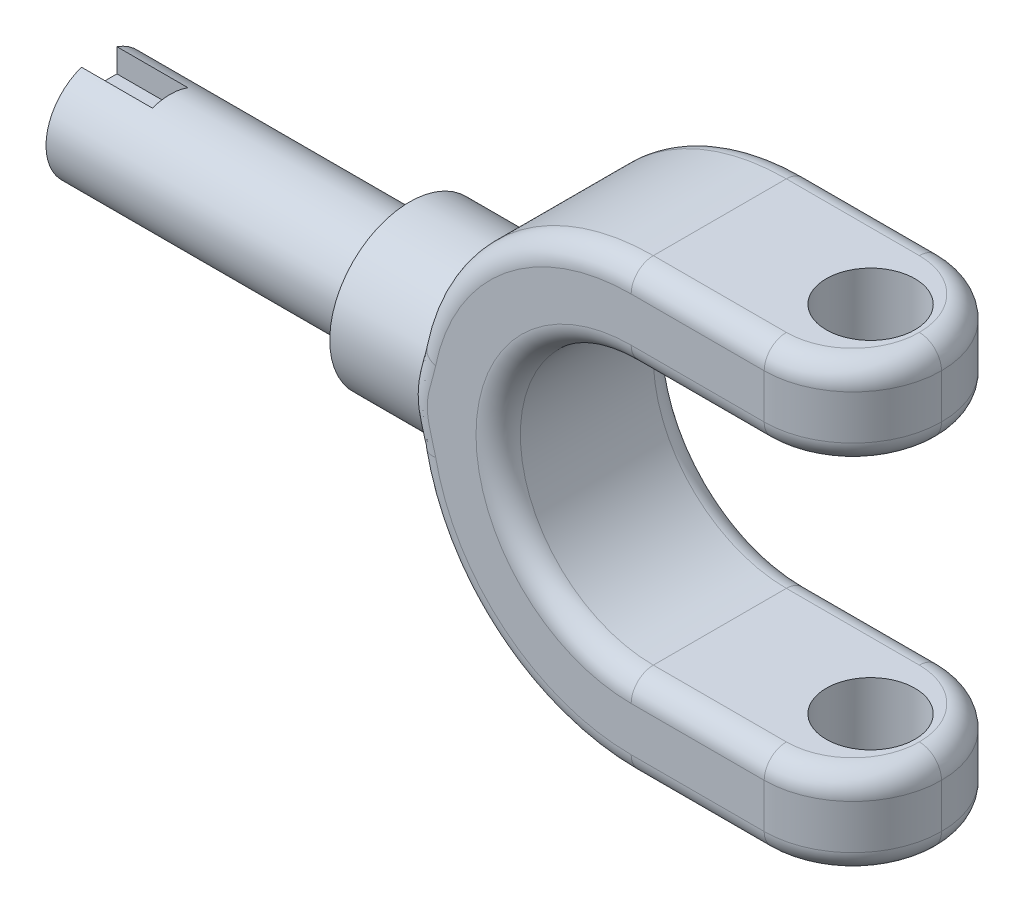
ISO-10303-21;
HEADER;
FILE_DESCRIPTION(('STEP AP214'),'2;1');
FILE_NAME('part.step','',(''),(''),'','','');
FILE_SCHEMA(('AUTOMOTIVE_DESIGN { 1 0 10303 214 1 1 1 1 }'));
ENDSEC;
DATA;
#1=APPLICATION_CONTEXT('core data for automotive mechanical design processes');
#2=APPLICATION_PROTOCOL_DEFINITION('international standard','automotive_design',2000,#1);
#3=PRODUCT_CONTEXT('',#1,'mechanical');
#4=PRODUCT('Part','Part','',(#3));
#5=PRODUCT_RELATED_PRODUCT_CATEGORY('part','',(#4));
#6=PRODUCT_DEFINITION_FORMATION('','',#4);
#7=PRODUCT_DEFINITION_CONTEXT('part definition',#1,'design');
#8=PRODUCT_DEFINITION('design','',#6,#7);
#9=PRODUCT_DEFINITION_SHAPE('','',#8);
#10=(LENGTH_UNIT() NAMED_UNIT(*) SI_UNIT(.MILLI.,.METRE.));
#11=(NAMED_UNIT(*) PLANE_ANGLE_UNIT() SI_UNIT($,.RADIAN.));
#12=(NAMED_UNIT(*) SI_UNIT($,.STERADIAN.) SOLID_ANGLE_UNIT());
#13=UNCERTAINTY_MEASURE_WITH_UNIT(LENGTH_MEASURE(1.E-05),#10,'distance_accuracy_value','');
#14=(GEOMETRIC_REPRESENTATION_CONTEXT(3) GLOBAL_UNCERTAINTY_ASSIGNED_CONTEXT((#13)) GLOBAL_UNIT_ASSIGNED_CONTEXT((#10,
#11,#12)) REPRESENTATION_CONTEXT('',''));
#15=CARTESIAN_POINT('',(0.,0.,0.));
#16=DIRECTION('',(0.,0.,1.));
#17=DIRECTION('',(1.,0.,0.));
#18=AXIS2_PLACEMENT_3D('',#15,#16,#17);
#19=CARTESIAN_POINT('',(0.,0.,20.));
#20=DIRECTION('',(0.,0.,-1.));
#21=DIRECTION('',(-1.,0.,0.));
#22=AXIS2_PLACEMENT_3D('',#19,#20,#21);
#23=CYLINDRICAL_SURFACE('',#22,25.);
#24=DIRECTION('',(0.,0.,-1.));
#25=VECTOR('',#24,1.);
#26=CARTESIAN_POINT('',(0.,-25.,20.));
#27=LINE('',#26,#25);
#28=CARTESIAN_POINT('',(0.,-25.,17.5));
#29=VERTEX_POINT('',#28);
#30=CARTESIAN_POINT('',(0.,-25.,2.5));
#31=VERTEX_POINT('',#30);
#32=EDGE_CURVE('E257',#29,#31,#27,.T.);
#33=ORIENTED_EDGE('',*,*,#32,.F.);
#34=CARTESIAN_POINT('',(0.,0.,17.5));
#35=DIRECTION('',(0.,0.,1.));
#36=DIRECTION('',(1.,0.,0.));
#37=AXIS2_PLACEMENT_3D('',#34,#35,#36);
#38=CIRCLE('',#37,25.);
#39=CARTESIAN_POINT('',(-24.5,-4.9749371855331,17.5));
#40=VERTEX_POINT('',#39);
#41=EDGE_CURVE('E11',#29,#40,#38,.F.);
#42=ORIENTED_EDGE('',*,*,#41,.T.);
#43=CARTESIAN_POINT('',(-25.,0.,19.));
#44=CARTESIAN_POINT('',(-25.0000005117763,0.244377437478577,19.0000007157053));
#45=CARTESIAN_POINT('',(-24.9964088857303,0.488744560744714,18.9900388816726));
#46=CARTESIAN_POINT('',(-24.9821422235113,0.975642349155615,18.9502947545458));
#47=CARTESIAN_POINT('',(-24.9714675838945,1.21817311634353,18.9205135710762));
#48=CARTESIAN_POINT('',(-24.9433254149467,1.69960684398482,18.8414277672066));
#49=CARTESIAN_POINT('',(-24.9258583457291,1.93851004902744,18.7921244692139));
#50=CARTESIAN_POINT('',(-24.8845985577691,2.41101671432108,18.6744612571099));
#51=CARTESIAN_POINT('',(-24.8608057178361,2.64462007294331,18.6061009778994));
#52=CARTESIAN_POINT('',(-24.8075749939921,3.10446312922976,18.4510981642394));
#53=CARTESIAN_POINT('',(-24.7781489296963,3.33071710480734,18.3644938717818));
#54=CARTESIAN_POINT('',(-24.7143620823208,3.77500972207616,18.1736029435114));
#55=CARTESIAN_POINT('',(-24.6799994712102,3.9930452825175,18.0693097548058));
#56=CARTESIAN_POINT('',(-24.6072111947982,4.41949682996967,17.8438651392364));
#57=CARTESIAN_POINT('',(-24.5687856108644,4.6279130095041,17.722714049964));
#58=CARTESIAN_POINT('',(-24.4888168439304,5.0339523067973,17.4643975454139));
#59=CARTESIAN_POINT('',(-24.4472734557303,5.23157471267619,17.3272310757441));
#60=CARTESIAN_POINT('',(-24.3605626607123,5.62177421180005,17.0326049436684));
#61=CARTESIAN_POINT('',(-24.3153188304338,5.81391953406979,16.8745957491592));
#62=CARTESIAN_POINT('',(-24.2237552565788,6.18434228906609,16.5433665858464));
#63=CARTESIAN_POINT('',(-24.1774354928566,6.36261946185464,16.3701463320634));
#64=CARTESIAN_POINT('',(-24.0849243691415,6.70430904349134,16.0094893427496));
#65=CARTESIAN_POINT('',(-24.0387330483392,6.86771731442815,15.8220486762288));
#66=CARTESIAN_POINT('',(-23.9477303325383,7.17861075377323,15.4340904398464));
#67=CARTESIAN_POINT('',(-23.9029189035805,7.32609631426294,15.2335731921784));
#68=CARTESIAN_POINT('',(-23.8143924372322,7.60903758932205,14.8134089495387));
#69=CARTESIAN_POINT('',(-23.7707700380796,7.74389491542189,14.5933388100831));
#70=CARTESIAN_POINT('',(-23.6876809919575,7.99444762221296,14.1419101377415));
#71=CARTESIAN_POINT('',(-23.6482126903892,8.11015064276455,13.9105561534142));
#72=CARTESIAN_POINT('',(-23.5746816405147,8.32147286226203,13.4380320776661));
#73=CARTESIAN_POINT('',(-23.5406185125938,8.41709347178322,13.1968626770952));
#74=CARTESIAN_POINT('',(-23.4790444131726,8.58735589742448,12.7064162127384));
#75=CARTESIAN_POINT('',(-23.4515330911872,8.66199883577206,12.4571395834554));
#76=CARTESIAN_POINT('',(-23.4049423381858,8.78709045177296,11.9620665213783));
#77=CARTESIAN_POINT('',(-23.385579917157,8.8383574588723,11.7165034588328));
#78=CARTESIAN_POINT('',(-23.3544644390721,8.92025322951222,11.2214799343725));
#79=CARTESIAN_POINT('',(-23.3427112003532,8.95088248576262,10.9720195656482));
#80=CARTESIAN_POINT('',(-23.327225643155,8.99116296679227,10.4712423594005));
#81=CARTESIAN_POINT('',(-23.3234907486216,9.00082092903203,10.2199261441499));
#82=CARTESIAN_POINT('',(-23.3241665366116,8.99906989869,9.71738262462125));
#83=CARTESIAN_POINT('',(-23.3285769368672,8.98766163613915,9.46615531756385));
#84=CARTESIAN_POINT('',(-23.3449248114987,8.94510830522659,8.9795120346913));
#85=CARTESIAN_POINT('',(-23.3564370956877,8.91507766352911,8.74398325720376));
#86=CARTESIAN_POINT('',(-23.3862447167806,8.83658977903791,8.27636860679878));
#87=CARTESIAN_POINT('',(-23.4045424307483,8.7881260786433,8.04428397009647));
#88=CARTESIAN_POINT('',(-23.44736060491,8.67323646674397,7.58526776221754));
#89=CARTESIAN_POINT('',(-23.4718793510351,8.60681550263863,7.35833479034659));
#90=CARTESIAN_POINT('',(-23.5264353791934,8.45654912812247,6.91090718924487));
#91=CARTESIAN_POINT('',(-23.5564747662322,8.37269706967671,6.69041505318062));
#92=CARTESIAN_POINT('',(-23.6217915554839,8.18662627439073,6.25346508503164));
#93=CARTESIAN_POINT('',(-23.6571516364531,8.08411101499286,6.03714597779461));
#94=CARTESIAN_POINT('',(-23.7317357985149,7.86246691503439,5.61380303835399));
#95=CARTESIAN_POINT('',(-23.7709611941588,7.74333241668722,5.4067824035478));
#96=CARTESIAN_POINT('',(-23.8522250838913,7.48926843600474,5.00322952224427));
#97=CARTESIAN_POINT('',(-23.8942638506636,7.35433742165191,4.80669829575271));
#98=CARTESIAN_POINT('',(-23.9800748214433,7.0695211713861,4.42518658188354));
#99=CARTESIAN_POINT('',(-24.0238470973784,6.91963531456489,4.2402065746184));
#100=CARTESIAN_POINT('',(-24.1147643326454,6.5960662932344,3.87173111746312));
#101=CARTESIAN_POINT('',(-24.1619505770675,6.42148498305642,3.68903353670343));
#102=CARTESIAN_POINT('',(-24.2557459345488,6.0575640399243,3.33894520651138));
#103=CARTESIAN_POINT('',(-24.3023552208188,5.86822896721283,3.17154976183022));
#104=CARTESIAN_POINT('',(-24.3937779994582,5.47578308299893,2.85299351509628));
#105=CARTESIAN_POINT('',(-24.4385905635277,5.27266529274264,2.70184103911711));
#106=CARTESIAN_POINT('',(-24.5251677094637,4.85405065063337,2.41697539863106));
#107=CARTESIAN_POINT('',(-24.5669335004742,4.6385587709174,2.28325529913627));
#108=CARTESIAN_POINT('',(-24.6468464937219,4.19342106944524,2.03248048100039));
#109=CARTESIAN_POINT('',(-24.6849360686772,3.963621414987,1.91568008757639));
#110=CARTESIAN_POINT('',(-24.7557371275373,3.49424918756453,1.70200731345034));
#111=CARTESIAN_POINT('',(-24.7884508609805,3.2546807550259,1.60512659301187));
#112=CARTESIAN_POINT('',(-24.8475669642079,2.76742307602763,1.4321417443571));
#113=CARTESIAN_POINT('',(-24.8739700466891,2.51973475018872,1.35603526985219));
#114=CARTESIAN_POINT('',(-24.9196844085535,2.0181035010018,1.22535330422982));
#115=CARTESIAN_POINT('',(-24.9389960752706,1.76416092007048,1.17077663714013));
#116=CARTESIAN_POINT('',(-24.9691773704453,1.26476365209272,1.085892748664));
#117=CARTESIAN_POINT('',(-24.9804182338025,1.01951275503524,1.05451597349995));
#118=CARTESIAN_POINT('',(-24.9956578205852,0.527038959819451,1.01204660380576));
#119=CARTESIAN_POINT('',(-24.9996567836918,0.27981612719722,1.00095333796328));
#120=CARTESIAN_POINT('',(-25.0003007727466,-0.214667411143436,0.999164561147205));
#121=CARTESIAN_POINT('',(-24.9969471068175,-0.461928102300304,1.00846542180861));
#122=CARTESIAN_POINT('',(-24.9829822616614,-0.954638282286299,1.04736171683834));
#123=CARTESIAN_POINT('',(-24.9723711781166,-1.20008779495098,1.07695688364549));
#124=CARTESIAN_POINT('',(-24.9446822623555,-1.67877449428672,1.15475039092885));
#125=CARTESIAN_POINT('',(-24.9278443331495,-1.91213804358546,1.20225973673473));
#126=CARTESIAN_POINT('',(-24.8881102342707,-2.37396397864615,1.31548270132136));
#127=CARTESIAN_POINT('',(-24.8652119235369,-2.60242460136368,1.38120275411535));
#128=CARTESIAN_POINT('',(-24.8139413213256,-3.05281481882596,1.53025526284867));
#129=CARTESIAN_POINT('',(-24.7855705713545,-3.27474623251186,1.6135827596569));
#130=CARTESIAN_POINT('',(-24.7240365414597,-3.71086780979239,1.79722809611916));
#131=CARTESIAN_POINT('',(-24.6908714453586,-3.92505500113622,1.89755237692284));
#132=CARTESIAN_POINT('',(-24.6195683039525,-4.35024362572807,2.11747103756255));
#133=CARTESIAN_POINT('',(-24.5813168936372,-4.56098733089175,2.23752686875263));
#134=CARTESIAN_POINT('',(-24.5015437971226,-4.97173454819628,2.49396915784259));
#135=CARTESIAN_POINT('',(-24.460020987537,-5.17173433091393,2.6303612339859));
#136=CARTESIAN_POINT('',(-24.3747369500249,-5.55982740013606,2.91856327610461));
#137=CARTESIAN_POINT('',(-24.330975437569,-5.74791916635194,3.07037520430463));
#138=CARTESIAN_POINT('',(-24.2422953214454,-6.11114351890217,3.3884788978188));
#139=CARTESIAN_POINT('',(-24.1973766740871,-6.28627561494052,3.55477121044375));
#140=CARTESIAN_POINT('',(-24.1050842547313,-6.63163271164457,3.91016551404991));
#141=CARTESIAN_POINT('',(-24.0577079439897,-6.80109147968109,4.10001236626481));
#142=CARTESIAN_POINT('',(-23.9642463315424,-7.12341596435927,4.49349420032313));
#143=CARTESIAN_POINT('',(-23.9181606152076,-7.27628705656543,4.69712468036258));
#144=CARTESIAN_POINT('',(-23.8285670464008,-7.56453494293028,5.11710080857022));
#145=CARTESIAN_POINT('',(-23.7850604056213,-7.69990354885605,5.33345233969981));
#146=CARTESIAN_POINT('',(-23.7019665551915,-7.95200593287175,5.77735593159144));
#147=CARTESIAN_POINT('',(-23.6623777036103,-8.06874753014,6.00490323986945));
#148=CARTESIAN_POINT('',(-23.5882608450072,-8.28292384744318,6.47028158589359));
#149=CARTESIAN_POINT('',(-23.5537431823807,-8.38031924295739,6.70813239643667));
#150=CARTESIAN_POINT('',(-23.4910136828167,-8.55458115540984,7.19193739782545));
#151=CARTESIAN_POINT('',(-23.4627990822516,-8.63145667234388,7.43788798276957));
#152=CARTESIAN_POINT('',(-23.4136335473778,-8.76394685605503,7.9361055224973));
#153=CARTESIAN_POINT('',(-23.3926808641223,-8.81956664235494,8.18837094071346));
#154=CARTESIAN_POINT('',(-23.3587814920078,-8.90896312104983,8.69726998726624));
#155=CARTESIAN_POINT('',(-23.3458343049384,-8.9427411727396,8.95390334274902));
#156=CARTESIAN_POINT('',(-23.3289385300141,-8.98672016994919,9.45403742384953));
#157=CARTESIAN_POINT('',(-23.3244996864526,-8.9982061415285,9.69740941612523));
#158=CARTESIAN_POINT('',(-23.3232654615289,-9.0014051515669,10.1842973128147));
#159=CARTESIAN_POINT('',(-23.326469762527,-8.99311901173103,10.4278132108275));
#160=CARTESIAN_POINT('',(-23.3404150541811,-8.95686320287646,10.9131336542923));
#161=CARTESIAN_POINT('',(-23.3511554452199,-8.92889509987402,11.1549383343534));
#162=CARTESIAN_POINT('',(-23.379820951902,-8.85356381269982,11.6350715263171));
#163=CARTESIAN_POINT('',(-23.3977460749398,-8.80620060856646,11.8734000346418));
#164=CARTESIAN_POINT('',(-23.4396522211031,-8.69403150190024,12.3387153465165));
#165=CARTESIAN_POINT('',(-23.4634625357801,-8.62971436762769,12.5658357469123));
#166=CARTESIAN_POINT('',(-23.5166662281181,-8.48365763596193,13.0138146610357));
#167=CARTESIAN_POINT('',(-23.5460615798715,-8.40191187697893,13.2346709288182));
#168=CARTESIAN_POINT('',(-23.6095982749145,-8.22167810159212,13.6686801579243));
#169=CARTESIAN_POINT('',(-23.6437387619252,-8.1231931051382,13.8818345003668));
#170=CARTESIAN_POINT('',(-23.7158650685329,-7.91014482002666,14.2993680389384));
#171=CARTESIAN_POINT('',(-23.7538523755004,-7.79557530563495,14.5037437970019));
#172=CARTESIAN_POINT('',(-23.8346129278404,-7.545155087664,14.9123127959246));
#173=CARTESIAN_POINT('',(-23.8775293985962,-7.40853742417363,15.1160078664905));
#174=CARTESIAN_POINT('',(-23.9653551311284,-7.11931168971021,15.5113906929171));
#175=CARTESIAN_POINT('',(-24.0102652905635,-6.9666963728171,15.7030729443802));
#176=CARTESIAN_POINT('',(-24.1008798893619,-6.64644835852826,16.0732715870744));
#177=CARTESIAN_POINT('',(-24.14658437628,-6.47881475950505,16.2517871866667));
#178=CARTESIAN_POINT('',(-24.2376088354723,-6.12950976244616,16.5946190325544));
#179=CARTESIAN_POINT('',(-24.2829288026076,-5.94783817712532,16.7589350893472));
#180=CARTESIAN_POINT('',(-24.3741989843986,-5.56233135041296,17.0800005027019));
#181=CARTESIAN_POINT('',(-24.4200729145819,-5.35784821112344,17.2359948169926));
#182=CARTESIAN_POINT('',(-24.5088377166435,-4.93592196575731,17.5301250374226));
#183=CARTESIAN_POINT('',(-24.5517297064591,-4.7184837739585,17.6682676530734));
#184=CARTESIAN_POINT('',(-24.6333643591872,-4.27187338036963,17.925752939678));
#185=CARTESIAN_POINT('',(-24.6721053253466,-4.04269643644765,18.0450879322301));
#186=CARTESIAN_POINT('',(-24.7442969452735,-3.57433623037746,18.2638302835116));
#187=CARTESIAN_POINT('',(-24.7777498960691,-3.33515737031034,18.3632462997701));
#188=CARTESIAN_POINT('',(-24.8387340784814,-2.84582349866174,18.5422404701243));
#189=CARTESIAN_POINT('',(-24.8661987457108,-2.5955789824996,18.6215970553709));
#190=CARTESIAN_POINT('',(-24.913915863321,-2.08845661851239,18.7582709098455));
#191=CARTESIAN_POINT('',(-24.9341681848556,-1.83157865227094,18.8155877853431));
#192=CARTESIAN_POINT('',(-24.966825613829,-1.31338843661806,18.9075378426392));
#193=CARTESIAN_POINT('',(-24.9792333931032,-1.05207772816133,18.9421787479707));
#194=CARTESIAN_POINT('',(-24.9958200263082,-0.527173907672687,18.9884086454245));
#195=CARTESIAN_POINT('',(-24.9999994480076,-0.263580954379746,18.9999992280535));
#196=CARTESIAN_POINT('',(-25.,0.,19.));
#197=B_SPLINE_CURVE_WITH_KNOTS('',3,(#43,#44,#45,#46,#47,#48,#49,#50,#51,#52,#53,#54,#55,#56,
#57,#58,#59,#60,#61,#62,#63,#64,#65,#66,#67,#68,#69,#70,#71,#72,#73,#74,#75,#76,#77,#78,#79,#80,
#81,#82,#83,#84,#85,#86,#87,#88,#89,#90,#91,#92,#93,#94,#95,#96,#97,#98,#99,#100,#101,#102,#103,
#104,#105,#106,#107,#108,#109,#110,#111,#112,#113,#114,#115,#116,#117,#118,#119,#120,#121,#122,
#123,#124,#125,#126,#127,#128,#129,#130,#131,#132,#133,#134,#135,#136,#137,#138,#139,#140,#141,
#142,#143,#144,#145,#146,#147,#148,#149,#150,#151,#152,#153,#154,#155,#156,#157,#158,#159,#160,
#161,#162,#163,#164,#165,#166,#167,#168,#169,#170,#171,#172,#173,#174,#175,#176,#177,#178,#179,
#180,#181,#182,#183,#184,#185,#186,#187,#188,#189,#190,#191,#192,#193,#194,#195,#196),
.UNSPECIFIED.,.T.,.F.,(4,2,2,2,2,2,2,2,2,2,2,2,2,2,2,2,2,2,2,2,2,2,2,2,2,2,2,2,2,2,2,2,2,2,2,2,
2,2,2,2,2,2,2,2,2,2,2,2,2,2,2,2,2,2,2,2,2,2,2,2,2,2,2,2,2,2,2,2,2,2,2,2,2,2,2,2,4),(0.,
0.732886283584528,1.46573153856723,2.19852715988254,2.93133682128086,3.66262542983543,
4.39418554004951,5.12573100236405,5.85732465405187,6.61502800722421,7.37274555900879,
8.13067333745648,8.88858244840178,9.67290550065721,10.4569149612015,11.240869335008,
12.0247817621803,12.7786201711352,13.5324405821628,14.2860187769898,15.039570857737,
15.7518789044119,16.4644367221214,17.1767984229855,17.8894323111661,18.6145735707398,
19.3399622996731,20.0654214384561,20.79091071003,21.5612245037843,22.3313011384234,
23.1017706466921,23.8719327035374,24.6526805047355,25.4331007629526,26.2134328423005,
26.9937222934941,27.7353070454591,28.4768672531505,29.2182955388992,29.9597140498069,
30.6751244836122,31.3907880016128,32.1062502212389,32.8219841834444,33.5577871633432,
34.2938439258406,35.0299944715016,35.7661728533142,36.5418124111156,37.3171998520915,
38.0929487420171,38.8683711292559,39.6453539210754,40.4219953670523,41.1984496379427,
41.9748555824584,42.70499505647,43.4351041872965,44.1651552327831,44.8952070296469,
45.6061586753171,46.3173620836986,47.02843731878,47.7397885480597,48.4859438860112,
49.2324386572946,49.978978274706,50.7255278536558,51.5083341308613,52.2908453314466,
53.073675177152,53.8561640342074,54.6469514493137,55.4377529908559,56.2282850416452,
57.018762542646),.UNSPECIFIED.);
#198=CARTESIAN_POINT('',(-24.5,-4.9749371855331,2.5));
#199=VERTEX_POINT('',#198);
#200=EDGE_CURVE('E440',#199,#40,#197,.T.);
#201=ORIENTED_EDGE('',*,*,#200,.F.);
#202=CARTESIAN_POINT('',(0.,0.,2.5));
#203=DIRECTION('',(0.,0.,1.));
#204=DIRECTION('',(1.,0.,0.));
#205=AXIS2_PLACEMENT_3D('',#202,#203,#204);
#206=CIRCLE('',#205,25.);
#207=EDGE_CURVE('E415',#199,#31,#206,.T.);
#208=ORIENTED_EDGE('',*,*,#207,.T.);
#209=EDGE_LOOP('',(#33,#42,#201,#208));
#210=FACE_BOUND('',#209,.T.);
#211=ADVANCED_FACE('F26',(#210),#23,.T.);
#212=CARTESIAN_POINT('',(-24.5000000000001,4.97493718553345,17.5000000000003));
#213=VERTEX_POINT('',#212);
#214=CARTESIAN_POINT('',(-24.5,4.9749371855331,2.5));
#215=VERTEX_POINT('',#214);
#216=EDGE_CURVE('E272',#213,#215,#197,.T.);
#217=ORIENTED_EDGE('',*,*,#216,.F.);
#218=CARTESIAN_POINT('',(0.,0.,17.5));
#219=DIRECTION('',(0.,0.,1.));
#220=DIRECTION('',(1.,0.,0.));
#221=AXIS2_PLACEMENT_3D('',#218,#219,#220);
#222=CIRCLE('',#221,25.);
#223=CARTESIAN_POINT('',(0.,25.,17.5));
#224=VERTEX_POINT('',#223);
#225=EDGE_CURVE('E35',#213,#224,#222,.F.);
#226=ORIENTED_EDGE('',*,*,#225,.T.);
#227=DIRECTION('',(0.,0.,-1.));
#228=VECTOR('',#227,1.);
#229=CARTESIAN_POINT('',(0.,25.,20.));
#230=LINE('',#229,#228);
#231=CARTESIAN_POINT('',(0.,25.,2.5));
#232=VERTEX_POINT('',#231);
#233=EDGE_CURVE('E260',#224,#232,#230,.T.);
#234=ORIENTED_EDGE('',*,*,#233,.T.);
#235=CARTESIAN_POINT('',(0.,0.,2.5));
#236=DIRECTION('',(0.,0.,1.));
#237=DIRECTION('',(1.,0.,0.));
#238=AXIS2_PLACEMENT_3D('',#235,#236,#237);
#239=CIRCLE('',#238,25.);
#240=EDGE_CURVE('E451',#232,#215,#239,.T.);
#241=ORIENTED_EDGE('',*,*,#240,.T.);
#242=EDGE_LOOP('',(#217,#226,#234,#241));
#243=FACE_BOUND('',#242,.T.);
#244=ADVANCED_FACE('F282',(#243),#23,.T.);
#245=CARTESIAN_POINT('',(0.,0.,20.));
#246=DIRECTION('',(0.,0.,-1.));
#247=DIRECTION('',(-1.,0.,0.));
#248=AXIS2_PLACEMENT_3D('',#245,#246,#247);
#249=CYLINDRICAL_SURFACE('',#248,15.);
#250=DIRECTION('',(0.,0.,-1.));
#251=VECTOR('',#250,1.);
#252=CARTESIAN_POINT('',(0.,15.,20.));
#253=LINE('',#252,#251);
#254=CARTESIAN_POINT('',(0.,15.,17.5));
#255=VERTEX_POINT('',#254);
#256=CARTESIAN_POINT('',(0.,15.,2.5));
#257=VERTEX_POINT('',#256);
#258=EDGE_CURVE('E263',#255,#257,#253,.T.);
#259=ORIENTED_EDGE('',*,*,#258,.F.);
#260=CARTESIAN_POINT('',(0.,0.,17.5));
#261=DIRECTION('',(0.,0.,1.));
#262=DIRECTION('',(1.,0.,0.));
#263=AXIS2_PLACEMENT_3D('',#260,#261,#262);
#264=CIRCLE('',#263,15.);
#265=CARTESIAN_POINT('',(0.,-15.,17.5));
#266=VERTEX_POINT('',#265);
#267=EDGE_CURVE('E839',#255,#266,#264,.T.);
#268=ORIENTED_EDGE('',*,*,#267,.T.);
#269=DIRECTION('',(0.,0.,-1.));
#270=VECTOR('',#269,1.);
#271=CARTESIAN_POINT('',(0.,-15.,20.));
#272=LINE('',#271,#270);
#273=CARTESIAN_POINT('',(0.,-15.,2.5));
#274=VERTEX_POINT('',#273);
#275=EDGE_CURVE('E254',#266,#274,#272,.T.);
#276=ORIENTED_EDGE('',*,*,#275,.T.);
#277=CARTESIAN_POINT('',(0.,0.,2.5));
#278=DIRECTION('',(0.,0.,1.));
#279=DIRECTION('',(1.,0.,0.));
#280=AXIS2_PLACEMENT_3D('',#277,#278,#279);
#281=CIRCLE('',#280,15.);
#282=EDGE_CURVE('E837',#274,#257,#281,.F.);
#283=ORIENTED_EDGE('',*,*,#282,.T.);
#284=EDGE_LOOP('',(#259,#268,#276,#283));
#285=FACE_BOUND('',#284,.T.);
#286=ADVANCED_FACE('F411',(#285),#249,.F.);
#287=CARTESIAN_POINT('',(25.,15.,20.));
#288=DIRECTION('',(0.,1.,0.));
#289=DIRECTION('',(-1.,0.,0.));
#290=AXIS2_PLACEMENT_3D('',#287,#288,#289);
#291=PLANE('',#290);
#292=CARTESIAN_POINT('',(17.,15.,10.));
#293=DIRECTION('',(0.,1.,0.));
#294=DIRECTION('',(-1.,0.,0.));
#295=AXIS2_PLACEMENT_3D('',#292,#293,#294);
#296=CIRCLE('',#295,5.00000000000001);
#297=CARTESIAN_POINT('',(12.,15.,10.));
#298=VERTEX_POINT('',#297);
#299=EDGE_CURVE('E251',#298,#298,#296,.T.);
#300=ORIENTED_EDGE('',*,*,#299,.T.);
#301=EDGE_LOOP('',(#300));
#302=FACE_BOUND('',#301,.T.);
#303=CARTESIAN_POINT('',(15.,15.,10.));
#304=DIRECTION('',(0.,1.,0.));
#305=DIRECTION('',(-1.,0.,0.));
#306=AXIS2_PLACEMENT_3D('',#303,#304,#305);
#307=CIRCLE('',#306,7.5);
#308=CARTESIAN_POINT('',(22.5,15.,10.));
#309=VERTEX_POINT('',#308);
#310=CARTESIAN_POINT('',(15.,15.,17.5));
#311=VERTEX_POINT('',#310);
#312=EDGE_CURVE('E845',#309,#311,#307,.F.);
#313=ORIENTED_EDGE('',*,*,#312,.T.);
#314=DIRECTION('',(1.,0.,0.));
#315=VECTOR('',#314,1.);
#316=CARTESIAN_POINT('',(0.,15.,17.5));
#317=LINE('',#316,#315);
#318=EDGE_CURVE('E847',#311,#255,#317,.F.);
#319=ORIENTED_EDGE('',*,*,#318,.T.);
#320=ORIENTED_EDGE('',*,*,#258,.T.);
#321=DIRECTION('',(1.,0.,0.));
#322=VECTOR('',#321,1.);
#323=CARTESIAN_POINT('',(25.,15.,2.5));
#324=LINE('',#323,#322);
#325=CARTESIAN_POINT('',(15.,15.,2.5));
#326=VERTEX_POINT('',#325);
#327=EDGE_CURVE('E841',#257,#326,#324,.T.);
#328=ORIENTED_EDGE('',*,*,#327,.T.);
#329=CARTESIAN_POINT('',(15.,15.,10.));
#330=DIRECTION('',(0.,1.,0.));
#331=DIRECTION('',(-1.,0.,0.));
#332=AXIS2_PLACEMENT_3D('',#329,#330,#331);
#333=CIRCLE('',#332,7.5);
#334=EDGE_CURVE('E843',#326,#309,#333,.F.);
#335=ORIENTED_EDGE('',*,*,#334,.T.);
#336=EDGE_LOOP('',(#313,#319,#320,#328,#335));
#337=FACE_BOUND('',#336,.T.);
#338=ADVANCED_FACE('F473',(#302,#337),#291,.F.);
#339=CARTESIAN_POINT('',(25.,25.,20.));
#340=DIRECTION('',(0.,-1.,0.));
#341=DIRECTION('',(0.,0.,-1.));
#342=AXIS2_PLACEMENT_3D('',#339,#340,#341);
#343=PLANE('',#342);
#344=CARTESIAN_POINT('',(17.,25.,10.));
#345=DIRECTION('',(0.,1.,0.));
#346=DIRECTION('',(0.,0.,1.));
#347=AXIS2_PLACEMENT_3D('',#344,#345,#346);
#348=CIRCLE('',#347,5.00000000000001);
#349=CARTESIAN_POINT('',(17.,25.,15.));
#350=VERTEX_POINT('',#349);
#351=EDGE_CURVE('E237',#350,#350,#348,.T.);
#352=ORIENTED_EDGE('',*,*,#351,.F.);
#353=EDGE_LOOP('',(#352));
#354=FACE_BOUND('',#353,.T.);
#355=CARTESIAN_POINT('',(15.,25.,10.));
#356=DIRECTION('',(0.,-1.,0.));
#357=DIRECTION('',(0.,0.,-1.));
#358=AXIS2_PLACEMENT_3D('',#355,#356,#357);
#359=CIRCLE('',#358,7.5);
#360=CARTESIAN_POINT('',(22.5,25.,10.));
#361=VERTEX_POINT('',#360);
#362=CARTESIAN_POINT('',(15.,25.,2.5));
#363=VERTEX_POINT('',#362);
#364=EDGE_CURVE('E490',#361,#363,#359,.F.);
#365=ORIENTED_EDGE('',*,*,#364,.T.);
#366=DIRECTION('',(-1.,0.,0.));
#367=VECTOR('',#366,1.);
#368=CARTESIAN_POINT('',(25.,25.,2.5));
#369=LINE('',#368,#367);
#370=EDGE_CURVE('E493',#363,#232,#369,.T.);
#371=ORIENTED_EDGE('',*,*,#370,.T.);
#372=ORIENTED_EDGE('',*,*,#233,.F.);
#373=DIRECTION('',(-1.,0.,0.));
#374=VECTOR('',#373,1.);
#375=CARTESIAN_POINT('',(15.,25.,17.5));
#376=LINE('',#375,#374);
#377=CARTESIAN_POINT('',(15.,25.,17.5));
#378=VERTEX_POINT('',#377);
#379=EDGE_CURVE('E534',#224,#378,#376,.F.);
#380=ORIENTED_EDGE('',*,*,#379,.T.);
#381=CARTESIAN_POINT('',(15.,25.,10.));
#382=DIRECTION('',(0.,-1.,0.));
#383=DIRECTION('',(0.,0.,-1.));
#384=AXIS2_PLACEMENT_3D('',#381,#382,#383);
#385=CIRCLE('',#384,7.5);
#386=EDGE_CURVE('E495',#378,#361,#385,.F.);
#387=ORIENTED_EDGE('',*,*,#386,.T.);
#388=EDGE_LOOP('',(#365,#371,#372,#380,#387));
#389=FACE_BOUND('',#388,.T.);
#390=ADVANCED_FACE('F476',(#354,#389),#343,.F.);
#391=CARTESIAN_POINT('',(25.,-25.,20.));
#392=DIRECTION('',(0.,1.,0.));
#393=DIRECTION('',(0.,0.,1.));
#394=AXIS2_PLACEMENT_3D('',#391,#392,#393);
#395=PLANE('',#394);
#396=CARTESIAN_POINT('',(17.,-25.,10.));
#397=DIRECTION('',(0.,1.,0.));
#398=DIRECTION('',(0.,0.,1.));
#399=AXIS2_PLACEMENT_3D('',#396,#397,#398);
#400=CIRCLE('',#399,5.00000000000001);
#401=CARTESIAN_POINT('',(17.,-25.,15.));
#402=VERTEX_POINT('',#401);
#403=EDGE_CURVE('E241',#402,#402,#400,.T.);
#404=ORIENTED_EDGE('',*,*,#403,.T.);
#405=EDGE_LOOP('',(#404));
#406=FACE_BOUND('',#405,.T.);
#407=ORIENTED_EDGE('',*,*,#32,.T.);
#408=DIRECTION('',(1.,0.,0.));
#409=VECTOR('',#408,1.);
#410=CARTESIAN_POINT('',(25.,-25.,2.5));
#411=LINE('',#410,#409);
#412=CARTESIAN_POINT('',(15.,-25.,2.5));
#413=VERTEX_POINT('',#412);
#414=EDGE_CURVE('E462',#31,#413,#411,.T.);
#415=ORIENTED_EDGE('',*,*,#414,.T.);
#416=CARTESIAN_POINT('',(15.,-25.,10.));
#417=DIRECTION('',(0.,1.,0.));
#418=DIRECTION('',(0.,0.,1.));
#419=AXIS2_PLACEMENT_3D('',#416,#417,#418);
#420=CIRCLE('',#419,7.5);
#421=CARTESIAN_POINT('',(22.5,-25.,10.));
#422=VERTEX_POINT('',#421);
#423=EDGE_CURVE('E550',#413,#422,#420,.F.);
#424=ORIENTED_EDGE('',*,*,#423,.T.);
#425=CARTESIAN_POINT('',(15.,-25.,10.));
#426=DIRECTION('',(0.,1.,0.));
#427=DIRECTION('',(0.,0.,1.));
#428=AXIS2_PLACEMENT_3D('',#425,#426,#427);
#429=CIRCLE('',#428,7.5);
#430=CARTESIAN_POINT('',(15.,-25.,17.5));
#431=VERTEX_POINT('',#430);
#432=EDGE_CURVE('E548',#422,#431,#429,.F.);
#433=ORIENTED_EDGE('',*,*,#432,.T.);
#434=DIRECTION('',(1.,0.,0.));
#435=VECTOR('',#434,1.);
#436=CARTESIAN_POINT('',(0.,-25.,17.5));
#437=LINE('',#436,#435);
#438=EDGE_CURVE('E422',#431,#29,#437,.F.);
#439=ORIENTED_EDGE('',*,*,#438,.T.);
#440=EDGE_LOOP('',(#407,#415,#424,#433,#439));
#441=FACE_BOUND('',#440,.T.);
#442=ADVANCED_FACE('F479',(#406,#441),#395,.F.);
#443=CARTESIAN_POINT('',(25.,-15.,20.));
#444=DIRECTION('',(0.,-1.,0.));
#445=DIRECTION('',(1.,0.,0.));
#446=AXIS2_PLACEMENT_3D('',#443,#444,#445);
#447=PLANE('',#446);
#448=ORIENTED_EDGE('',*,*,#275,.F.);
#449=DIRECTION('',(-1.,0.,0.));
#450=VECTOR('',#449,1.);
#451=CARTESIAN_POINT('',(15.,-15.,17.5));
#452=LINE('',#451,#450);
#453=CARTESIAN_POINT('',(15.,-15.,17.5));
#454=VERTEX_POINT('',#453);
#455=EDGE_CURVE('E834',#266,#454,#452,.F.);
#456=ORIENTED_EDGE('',*,*,#455,.T.);
#457=CARTESIAN_POINT('',(15.,-15.,10.));
#458=DIRECTION('',(0.,-1.,0.));
#459=DIRECTION('',(1.,0.,0.));
#460=AXIS2_PLACEMENT_3D('',#457,#458,#459);
#461=CIRCLE('',#460,7.5);
#462=CARTESIAN_POINT('',(22.5,-15.,10.));
#463=VERTEX_POINT('',#462);
#464=EDGE_CURVE('E828',#454,#463,#461,.F.);
#465=ORIENTED_EDGE('',*,*,#464,.T.);
#466=CARTESIAN_POINT('',(15.,-15.,10.));
#467=DIRECTION('',(0.,-1.,0.));
#468=DIRECTION('',(1.,0.,0.));
#469=AXIS2_PLACEMENT_3D('',#466,#467,#468);
#470=CIRCLE('',#469,7.5);
#471=CARTESIAN_POINT('',(15.,-15.,2.5));
#472=VERTEX_POINT('',#471);
#473=EDGE_CURVE('E830',#463,#472,#470,.F.);
#474=ORIENTED_EDGE('',*,*,#473,.T.);
#475=DIRECTION('',(-1.,0.,0.));
#476=VECTOR('',#475,1.);
#477=CARTESIAN_POINT('',(25.,-15.,2.5));
#478=LINE('',#477,#476);
#479=EDGE_CURVE('E832',#472,#274,#478,.T.);
#480=ORIENTED_EDGE('',*,*,#479,.T.);
#481=EDGE_LOOP('',(#448,#456,#465,#474,#480));
#482=FACE_BOUND('',#481,.T.);
#483=CARTESIAN_POINT('',(17.,-15.,10.));
#484=DIRECTION('',(0.,-1.,0.));
#485=DIRECTION('',(1.,0.,0.));
#486=AXIS2_PLACEMENT_3D('',#483,#484,#485);
#487=CIRCLE('',#486,5.00000000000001);
#488=CARTESIAN_POINT('',(22.,-15.,10.));
#489=VERTEX_POINT('',#488);
#490=EDGE_CURVE('E250',#489,#489,#487,.T.);
#491=ORIENTED_EDGE('',*,*,#490,.T.);
#492=EDGE_LOOP('',(#491));
#493=FACE_BOUND('',#492,.T.);
#494=ADVANCED_FACE('F484',(#482,#493),#447,.F.);
#495=CARTESIAN_POINT('',(0.,0.,20.));
#496=DIRECTION('',(0.,0.,1.));
#497=DIRECTION('',(1.,0.,0.));
#498=AXIS2_PLACEMENT_3D('',#495,#496,#497);
#499=PLANE('',#498);
#500=DIRECTION('',(0.,1.,0.));
#501=VECTOR('',#500,1.);
#502=CARTESIAN_POINT('',(15.,-15.,20.));
#503=LINE('',#502,#501);
#504=CARTESIAN_POINT('',(15.,-22.5,20.));
#505=VERTEX_POINT('',#504);
#506=CARTESIAN_POINT('',(15.,-17.5,20.));
#507=VERTEX_POINT('',#506);
#508=EDGE_CURVE('E279',#505,#507,#503,.T.);
#509=ORIENTED_EDGE('',*,*,#508,.T.);
#510=DIRECTION('',(-1.,0.,0.));
#511=VECTOR('',#510,1.);
#512=CARTESIAN_POINT('',(0.,-17.5,20.));
#513=LINE('',#512,#511);
#514=CARTESIAN_POINT('',(0.,-17.5,20.));
#515=VERTEX_POINT('',#514);
#516=EDGE_CURVE('E825',#507,#515,#513,.T.);
#517=ORIENTED_EDGE('',*,*,#516,.T.);
#518=CARTESIAN_POINT('',(0.,0.,20.));
#519=DIRECTION('',(0.,0.,1.));
#520=DIRECTION('',(1.,0.,0.));
#521=AXIS2_PLACEMENT_3D('',#518,#519,#520);
#522=CIRCLE('',#521,17.5);
#523=CARTESIAN_POINT('',(0.,17.5,20.));
#524=VERTEX_POINT('',#523);
#525=EDGE_CURVE('E823',#515,#524,#522,.F.);
#526=ORIENTED_EDGE('',*,*,#525,.T.);
#527=DIRECTION('',(1.,0.,0.));
#528=VECTOR('',#527,1.);
#529=CARTESIAN_POINT('',(15.,17.5,20.));
#530=LINE('',#529,#528);
#531=CARTESIAN_POINT('',(15.,17.5,20.));
#532=VERTEX_POINT('',#531);
#533=EDGE_CURVE('E821',#524,#532,#530,.T.);
#534=ORIENTED_EDGE('',*,*,#533,.T.);
#535=DIRECTION('',(0.,1.,0.));
#536=VECTOR('',#535,1.);
#537=CARTESIAN_POINT('',(15.,25.,20.));
#538=LINE('',#537,#536);
#539=CARTESIAN_POINT('',(15.,22.5,20.));
#540=VERTEX_POINT('',#539);
#541=EDGE_CURVE('E539',#532,#540,#538,.T.);
#542=ORIENTED_EDGE('',*,*,#541,.T.);
#543=DIRECTION('',(-1.,0.,0.));
#544=VECTOR('',#543,1.);
#545=CARTESIAN_POINT('',(0.,22.5,20.));
#546=LINE('',#545,#544);
#547=CARTESIAN_POINT('',(0.,22.5,20.));
#548=VERTEX_POINT('',#547);
#549=EDGE_CURVE('E857',#540,#548,#546,.T.);
#550=ORIENTED_EDGE('',*,*,#549,.T.);
#551=CARTESIAN_POINT('',(0.,0.,20.));
#552=DIRECTION('',(0.,0.,1.));
#553=DIRECTION('',(1.,0.,0.));
#554=AXIS2_PLACEMENT_3D('',#551,#552,#553);
#555=CIRCLE('',#554,22.5);
#556=CARTESIAN_POINT('',(-22.05,4.47744346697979,20.));
#557=VERTEX_POINT('',#556);
#558=EDGE_CURVE('E817',#548,#557,#555,.T.);
#559=ORIENTED_EDGE('',*,*,#558,.T.);
#560=CARTESIAN_POINT('',(-23.5318512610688,-8.64580392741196,20.));
#561=CARTESIAN_POINT('',(-23.97468246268,-7.09075573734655,20.));
#562=CARTESIAN_POINT('',(-24.1563118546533,-6.45294508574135,18.5253872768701));
#563=CARTESIAN_POINT('',(-24.3379412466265,-5.81513443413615,17.0507745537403));
#564=CARTESIAN_POINT('',(-24.044102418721,-6.84698028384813,15.8411352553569));
#565=CARTESIAN_POINT('',(-23.4768921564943,-8.63016896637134,20.));
#566=CARTESIAN_POINT('',(-23.9672531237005,-7.08860824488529,20.));
#567=CARTESIAN_POINT('',(-24.1683708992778,-6.45634014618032,18.5253815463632));
#568=CARTESIAN_POINT('',(-24.3694865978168,-5.82407319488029,17.0507644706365));
#569=CARTESIAN_POINT('',(-24.0441013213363,-6.84698335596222,15.8411296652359));
#570=CARTESIAN_POINT('',(-23.4226656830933,-8.61198917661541,20.));
#571=CARTESIAN_POINT('',(-23.9597563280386,-7.08664083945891,20.));
#572=CARTESIAN_POINT('',(-24.1801547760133,-6.46062264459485,18.5260119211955));
#573=CARTESIAN_POINT('',(-24.400548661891,-5.83460299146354,17.0520237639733));
#574=CARTESIAN_POINT('',(-24.0443514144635,-6.84610602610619,15.8421601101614));
#575=CARTESIAN_POINT('',(-23.3161173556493,-8.57078458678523,20.));
#576=CARTESIAN_POINT('',(-23.9441199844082,-7.0826967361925,20.));
#577=CARTESIAN_POINT('',(-24.2024607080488,-6.47047682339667,18.5285149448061));
#578=CARTESIAN_POINT('',(-24.4607980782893,-5.85825487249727,17.0570290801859));
#579=CARTESIAN_POINT('',(-24.0453507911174,-6.84259611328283,15.8462721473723));
#580=CARTESIAN_POINT('',(-23.2637945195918,-8.54776232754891,20.));
#581=CARTESIAN_POINT('',(-23.9359837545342,-7.08072074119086,20.));
#582=CARTESIAN_POINT('',(-24.2129834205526,-6.47604782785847,18.5303869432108));
#583=CARTESIAN_POINT('',(-24.4899764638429,-5.87137051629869,17.0607720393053));
#584=CARTESIAN_POINT('',(-24.0460998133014,-6.83996444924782,15.8493526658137));
#585=CARTESIAN_POINT('',(-23.1617646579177,-8.4972640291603,20.));
#586=CARTESIAN_POINT('',(-23.9186177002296,-7.07640434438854,20.));
#587=CARTESIAN_POINT('',(-24.2320080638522,-6.48795933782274,18.5353273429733));
#588=CARTESIAN_POINT('',(-24.5453917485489,-5.8995103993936,17.0706530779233));
#589=CARTESIAN_POINT('',(-24.0480874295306,-6.83297403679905,15.8575175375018));
#590=CARTESIAN_POINT('',(-23.112042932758,-8.46981768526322,20.));
#591=CARTESIAN_POINT('',(-23.9093990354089,-7.07406737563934,20.));
#592=CARTESIAN_POINT('',(-24.240522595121,-6.49429464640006,18.5383879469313));
#593=CARTESIAN_POINT('',(-24.5716388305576,-5.91451558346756,17.076772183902));
#594=CARTESIAN_POINT('',(-24.0493228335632,-6.82862654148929,15.8625888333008));
#595=CARTESIAN_POINT('',(-23.0151985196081,-8.41068943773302,20.));
#596=CARTESIAN_POINT('',(-23.8895252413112,-7.06853045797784,20.));
#597=CARTESIAN_POINT('',(-24.2551543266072,-6.50712276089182,18.5456409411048));
#598=CARTESIAN_POINT('',(-24.6207757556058,-5.94570826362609,17.0912781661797));
#599=CARTESIAN_POINT('',(-24.0522737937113,-6.81822657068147,15.8746817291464));
#600=CARTESIAN_POINT('',(-22.9680760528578,-8.3790071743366,20.));
#601=CARTESIAN_POINT('',(-23.8788746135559,-7.06533219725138,20.));
#602=CARTESIAN_POINT('',(-24.2612713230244,-6.51361558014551,18.5498334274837));
#603=CARTESIAN_POINT('',(-24.643660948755,-5.96188970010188,17.0996606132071));
#604=CARTESIAN_POINT('',(-24.0539893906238,-6.81217395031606,15.8817034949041));
#605=CARTESIAN_POINT('',(-22.8312043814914,-8.27824775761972,20.));
#606=CARTESIAN_POINT('',(-23.8445460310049,-7.05368248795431,20.));
#607=CARTESIAN_POINT('',(-24.2755192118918,-6.53228229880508,18.563976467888));
#608=CARTESIAN_POINT('',(-24.7064687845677,-6.01085114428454,17.1279279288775));
#609=CARTESIAN_POINT('',(-24.0598321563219,-6.79152326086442,15.905567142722));
#610=CARTESIAN_POINT('',(-22.7456809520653,-8.20332238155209,20.));
#611=CARTESIAN_POINT('',(-23.8184367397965,-7.0431732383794,20.));
#612=CARTESIAN_POINT('',(-24.2796005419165,-6.54368266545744,18.5755062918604));
#613=CARTESIAN_POINT('',(-24.7407716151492,-6.04416352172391,17.1509631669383));
#614=CARTESIAN_POINT('',(-24.0646606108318,-6.77441382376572,15.9252293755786));
#615=CARTESIAN_POINT('',(-22.5874177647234,-8.04095238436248,20.));
#616=CARTESIAN_POINT('',(-23.7602967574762,-7.01285051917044,20.));
#617=CARTESIAN_POINT('',(-24.2769518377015,-6.55927852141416,18.6019913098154));
#618=CARTESIAN_POINT('',(-24.7936094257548,-6.10567754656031,17.2039343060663));
#619=CARTESIAN_POINT('',(-24.076063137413,-6.73377983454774,15.9713689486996));
#620=CARTESIAN_POINT('',(-22.5146970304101,-7.95348947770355,20.));
#621=CARTESIAN_POINT('',(-23.7283058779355,-6.99307156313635,20.));
#622=CARTESIAN_POINT('',(-24.2702058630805,-6.56346336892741,18.6169515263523));
#623=CARTESIAN_POINT('',(-24.8121550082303,-6.1338622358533,17.2338306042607));
#624=CARTESIAN_POINT('',(-24.0826397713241,-6.71024586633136,15.9978562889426));
#625=CARTESIAN_POINT('',(-22.4046890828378,-7.8001739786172,20.));
#626=CARTESIAN_POINT('',(-23.6720837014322,-6.95053925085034,20.));
#627=CARTESIAN_POINT('',(-24.2518917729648,-6.5615225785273,18.6439826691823));
#628=CARTESIAN_POINT('',(-24.8317216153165,-6.17250698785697,17.2879331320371));
#629=CARTESIAN_POINT('',(-24.094901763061,-6.66605034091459,16.0468648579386));
#630=CARTESIAN_POINT('',(-22.3637016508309,-7.73692225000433,20.));
#631=CARTESIAN_POINT('',(-23.6488943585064,-6.93105900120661,20.));
#632=CARTESIAN_POINT('',(-24.2427023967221,-6.55838633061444,18.6553378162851));
#633=CARTESIAN_POINT('',(-24.8365448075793,-6.18573209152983,17.3106374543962));
#634=CARTESIAN_POINT('',(-24.100145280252,-6.64707626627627,16.06773295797));
#635=CARTESIAN_POINT('',(-22.2874425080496,-7.60703991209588,20.));
#636=CARTESIAN_POINT('',(-23.6017647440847,-6.88676418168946,20.));
#637=CARTESIAN_POINT('',(-24.2214565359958,-6.54683798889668,18.6789653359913));
#638=CARTESIAN_POINT('',(-24.8411823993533,-6.20693056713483,17.3578927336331));
#639=CARTESIAN_POINT('',(-24.1112918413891,-6.60652877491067,16.1118555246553));
#640=CARTESIAN_POINT('',(-22.252172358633,-7.54040838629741,20.));
#641=CARTESIAN_POINT('',(-23.5778321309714,-6.86197041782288,20.));
#642=CARTESIAN_POINT('',(-24.2093992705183,-6.53842445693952,18.6912379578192));
#643=CARTESIAN_POINT('',(-24.8410109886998,-6.21491692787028,17.3824327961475));
#644=CARTESIAN_POINT('',(-24.1171950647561,-6.58495465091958,16.1351106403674));
#645=CARTESIAN_POINT('',(-22.1871372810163,-7.40440555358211,20.));
#646=CARTESIAN_POINT('',(-23.5299727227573,-6.80700570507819,20.));
#647=CARTESIAN_POINT('',(-24.183299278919,-6.5160326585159,18.7165135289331));
#648=CARTESIAN_POINT('',(-24.8366703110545,-6.22509758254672,17.4329839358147));
#649=CARTESIAN_POINT('',(-24.1296257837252,-6.53925550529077,16.1837962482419));
#650=CARTESIAN_POINT('',(-22.15738065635,-7.33503030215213,20.));
#651=CARTESIAN_POINT('',(-23.506049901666,-6.77684963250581,20.));
#652=CARTESIAN_POINT('',(-24.1692536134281,-6.50204609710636,18.7295175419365));
#653=CARTESIAN_POINT('',(-24.8325090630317,-6.22730212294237,17.4589879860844));
#654=CARTESIAN_POINT('',(-24.1361541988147,-6.51512672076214,16.2092299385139));
#655=CARTESIAN_POINT('',(-22.1031728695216,-7.19422962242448,20.));
#656=CARTESIAN_POINT('',(-23.4589412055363,-6.71137744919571,20.));
#657=CARTESIAN_POINT('',(-24.1400344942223,-6.46849196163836,18.7560677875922));
#658=CARTESIAN_POINT('',(-24.8211796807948,-6.22566592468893,17.5120885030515));
#659=CARTESIAN_POINT('',(-24.1497894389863,-6.46439872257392,16.2620238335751));
#660=CARTESIAN_POINT('',(-22.0787232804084,-7.12280359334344,20.));
#661=CARTESIAN_POINT('',(-23.4357558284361,-6.67608206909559,20.));
#662=CARTESIAN_POINT('',(-24.1248607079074,-6.44892273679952,18.7696141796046));
#663=CARTESIAN_POINT('',(-24.8140219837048,-6.22184487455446,17.5391781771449));
#664=CARTESIAN_POINT('',(-24.1568964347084,-6.43779877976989,16.2893846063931));
#665=CARTESIAN_POINT('',(-22.0252394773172,-6.94685487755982,20.));
#666=CARTESIAN_POINT('',(-23.3809034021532,-6.58422609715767,20.));
#667=CARTESIAN_POINT('',(-24.0874128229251,-6.39460292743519,18.8031098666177));
#668=CARTESIAN_POINT('',(-24.7940365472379,-6.20514603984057,17.6061171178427));
#669=CARTESIAN_POINT('',(-24.1748783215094,-6.37000734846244,16.358164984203));
#670=CARTESIAN_POINT('',(-21.9988753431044,-6.84151688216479,20.));
#671=CARTESIAN_POINT('',(-23.3498907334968,-6.52506275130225,20.));
#672=CARTESIAN_POINT('',(-24.0649352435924,-6.3569557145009,18.8232688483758));
#673=CARTESIAN_POINT('',(-24.7800960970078,-6.18907640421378,17.6464295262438));
#674=CARTESIAN_POINT('',(-24.1860419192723,-6.32752141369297,16.4005006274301));
#675=CARTESIAN_POINT('',(-21.9555349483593,-6.62892622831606,20.));
#676=CARTESIAN_POINT('',(-23.2918761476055,-6.39792651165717,20.));
#677=CARTESIAN_POINT('',(-24.0209465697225,-6.2712796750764,18.8640400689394));
#678=CARTESIAN_POINT('',(-24.7501339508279,-6.14485951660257,17.7279720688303));
#679=CARTESIAN_POINT('',(-24.209384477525,-6.23761276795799,16.4881510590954));
#680=CARTESIAN_POINT('',(-21.9385631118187,-6.52167269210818,20.));
#681=CARTESIAN_POINT('',(-23.2648569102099,-6.33000031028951,20.));
#682=CARTESIAN_POINT('',(-23.9994359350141,-6.22324597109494,18.8846525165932));
#683=CARTESIAN_POINT('',(-24.7341232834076,-6.1167718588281,17.7691950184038));
#684=CARTESIAN_POINT('',(-24.2215639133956,-6.19018774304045,16.5334672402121));
#685=CARTESIAN_POINT('',(-21.9130320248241,-6.3062778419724,20.));
#686=CARTESIAN_POINT('',(-23.2156170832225,-6.18670942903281,20.));
#687=CARTESIAN_POINT('',(-23.9586257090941,-6.11791066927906,18.9260350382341));
#688=CARTESIAN_POINT('',(-24.701742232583,-6.04938977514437,17.8519608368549));
#689=CARTESIAN_POINT('',(-24.2468289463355,-6.09047257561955,16.6265185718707));
#690=CARTESIAN_POINT('',(-21.9044661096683,-6.19813730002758,20.));
#691=CARTESIAN_POINT('',(-23.1933677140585,-6.11139059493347,20.));
#692=CARTESIAN_POINT('',(-23.9393243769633,-6.06061645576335,18.9468049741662));
#693=CARTESIAN_POINT('',(-24.6853742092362,-6.01016358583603,17.893501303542));
#694=CARTESIAN_POINT('',(-24.259913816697,-6.03818632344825,16.674251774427));
#695=CARTESIAN_POINT('',(-21.8947562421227,-5.98151381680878,20.));
#696=CARTESIAN_POINT('',(-23.1539915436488,-5.95446896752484,20.));
#697=CARTESIAN_POINT('',(-23.9036877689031,-5.93779343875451,18.9883126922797));
#698=CARTESIAN_POINT('',(-24.653477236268,-5.92143911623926,17.9765169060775));
#699=CARTESIAN_POINT('',(-24.2869080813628,-5.92867906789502,16.7717145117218));
#700=CARTESIAN_POINT('',(-21.8936148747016,-5.87303076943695,20.));
#701=CARTESIAN_POINT('',(-23.136838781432,-5.87289244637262,20.));
#702=CARTESIAN_POINT('',(-23.8873535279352,-5.87226177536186,19.0090504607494));
#703=CARTESIAN_POINT('',(-24.6379433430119,-5.87198833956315,18.0179946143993));
#704=CARTESIAN_POINT('',(-24.3008177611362,-5.87145635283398,16.8214447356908));
#705=CARTESIAN_POINT('',(-21.8991026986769,-5.59117996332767,20.));
#706=CARTESIAN_POINT('',(-23.0990827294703,-5.65440202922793,20.));
#707=CARTESIAN_POINT('',(-23.8493585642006,-5.69251699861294,19.062696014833));
#708=CARTESIAN_POINT('',(-24.5998250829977,-5.73153070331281,18.1251233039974));
#709=CARTESIAN_POINT('',(-24.3379268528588,-5.7162042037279,16.9527453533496));
#710=CARTESIAN_POINT('',(-21.9108016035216,-5.41791018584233,20.));
#711=CARTESIAN_POINT('',(-23.0823926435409,-5.51316294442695,20.));
#712=CARTESIAN_POINT('',(-23.8303767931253,-5.5726749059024,19.0954450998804));
#713=CARTESIAN_POINT('',(-24.5784716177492,-5.63318175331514,18.190638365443));
#714=CARTESIAN_POINT('',(-24.3616954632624,-5.6142802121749,17.0355276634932));
#715=CARTESIAN_POINT('',(-21.9473835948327,-5.0727528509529,20.));
#716=CARTESIAN_POINT('',(-23.0616445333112,-5.22092514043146,20.));
#717=CARTESIAN_POINT('',(-23.8017689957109,-5.31801584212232,19.1598888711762));
#718=CARTESIAN_POINT('',(-24.5420060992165,-5.41609962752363,18.3195265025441));
#719=CARTESIAN_POINT('',(-24.4106905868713,-5.39727234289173,17.2033520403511));
#720=CARTESIAN_POINT('',(-21.9722763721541,-4.90086640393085,20.));
#721=CARTESIAN_POINT('',(-23.0574940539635,-5.06994211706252,20.));
#722=CARTESIAN_POINT('',(-23.7921498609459,-5.18318792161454,19.1915827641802));
#723=CARTESIAN_POINT('',(-24.5268436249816,-5.29747034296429,18.3829379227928));
#724=CARTESIAN_POINT('',(-24.4359181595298,-5.28217884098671,17.2883957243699));
#725=CARTESIAN_POINT('',(-22.0323942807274,-4.55736481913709,20.));
#726=CARTESIAN_POINT('',(-23.0602764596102,-4.75944066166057,20.));
#727=CARTESIAN_POINT('',(-23.7817054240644,-4.90001270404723,19.253752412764));
#728=CARTESIAN_POINT('',(-24.5031733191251,-5.04163273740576,18.5072747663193));
#729=CARTESIAN_POINT('',(-24.4875674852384,-5.03734398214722,17.4597380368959));
#730=CARTESIAN_POINT('',(-22.0677104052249,-4.38576605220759,20.));
#731=CARTESIAN_POINT('',(-23.0672277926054,-4.59983222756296,20.));
#732=CARTESIAN_POINT('',(-23.7809600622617,-4.75155463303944,19.2842146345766));
#733=CARTESIAN_POINT('',(-24.4946703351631,-4.90433175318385,18.5682267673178));
#734=CARTESIAN_POINT('',(-24.5139979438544,-4.90748009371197,17.5460410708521));
#735=CARTESIAN_POINT('',(-22.1456229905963,-4.04436146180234,20.));
#736=CARTESIAN_POINT('',(-23.0903627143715,-4.27511915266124,20.));
#737=CARTESIAN_POINT('',(-23.7873003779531,-4.44419471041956,19.3432207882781));
#738=CARTESIAN_POINT('',(-24.4842166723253,-4.61431772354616,18.6862405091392));
#739=CARTESIAN_POINT('',(-24.5672479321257,-4.63354491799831,17.7172740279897));
#740=CARTESIAN_POINT('',(-22.1882159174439,-3.87455481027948,20.));
#741=CARTESIAN_POINT('',(-23.1064849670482,-4.10997313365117,20.));
#742=CARTESIAN_POINT('',(-23.7943822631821,-4.28529795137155,19.3717656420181));
#743=CARTESIAN_POINT('',(-24.4822157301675,-4.46164409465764,18.7433601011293));
#744=CARTESIAN_POINT('',(-24.5940672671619,-4.48948054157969,17.8022045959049));
#745=CARTESIAN_POINT('',(-22.2780144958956,-3.53571690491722,20.));
#746=CARTESIAN_POINT('',(-23.1457235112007,-3.77469993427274,20.));
#747=CARTESIAN_POINT('',(-23.8148174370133,-3.95792942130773,19.426645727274));
#748=CARTESIAN_POINT('',(-24.4838477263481,-4.14217955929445,18.8531203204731));
#749=CARTESIAN_POINT('',(-24.6474777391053,-4.18635406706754,17.968966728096));
#750=CARTESIAN_POINT('',(-22.3252318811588,-3.36668882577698,20.));
#751=CARTESIAN_POINT('',(-23.1688262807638,-3.60448989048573,20.));
#752=CARTESIAN_POINT('',(-23.8281870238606,-3.78943377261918,19.4529750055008));
#753=CARTESIAN_POINT('',(-24.4874607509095,-3.97534363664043,18.9058102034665));
#754=CARTESIAN_POINT('',(-24.674068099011,-4.02725385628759,18.0507896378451));
#755=CARTESIAN_POINT('',(-22.4213927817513,-3.02911477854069,20.));
#756=CARTESIAN_POINT('',(-23.2195205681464,-3.25997066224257,20.));
#757=CARTESIAN_POINT('',(-23.8593218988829,-3.44409988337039,19.5029582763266));
#758=CARTESIAN_POINT('',(-24.4990364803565,-3.62919045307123,19.0057774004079));
#759=CARTESIAN_POINT('',(-24.726133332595,-3.69415142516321,18.2089736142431));
#760=CARTESIAN_POINT('',(-22.4703365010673,-2.86056886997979,20.));
#761=CARTESIAN_POINT('',(-23.247103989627,-3.08557301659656,20.));
#762=CARTESIAN_POINT('',(-23.8770877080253,-3.26726065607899,19.526611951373));
#763=CARTESIAN_POINT('',(-24.5069792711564,-3.44982975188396,19.0531162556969));
#764=CARTESIAN_POINT('',(-24.7516080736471,-3.52014744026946,18.2853340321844));
#765=CARTESIAN_POINT('',(-22.567098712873,-2.52289360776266,20.));
#766=CARTESIAN_POINT('',(-23.304112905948,-2.73258102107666,20.));
#767=CARTESIAN_POINT('',(-23.9149166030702,-2.90555867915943,19.5708585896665));
#768=CARTESIAN_POINT('',(-24.5256284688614,-3.07941407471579,19.1416096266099));
#769=CARTESIAN_POINT('',(-24.8005334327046,-3.15706162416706,18.4303719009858));
#770=CARTESIAN_POINT('',(-22.6149155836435,-2.35376377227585,20.));
#771=CARTESIAN_POINT('',(-23.3335526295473,-2.55387339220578,20.));
#772=CARTESIAN_POINT('',(-23.9349827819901,-2.72068533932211,19.5914473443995));
#773=CARTESIAN_POINT('',(-24.536331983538,-2.88826568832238,19.1828178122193));
#774=CARTESIAN_POINT('',(-24.8239812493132,-2.96795959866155,18.499038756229));
#775=CARTESIAN_POINT('',(-22.6833873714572,-2.09917975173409,20.));
#776=CARTESIAN_POINT('',(-23.3769387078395,-2.28258965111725,20.));
#777=CARTESIAN_POINT('',(-23.9650350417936,-2.43794663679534,19.6196597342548));
#778=CARTESIAN_POINT('',(-24.5531104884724,-2.59349674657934,19.2393002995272));
#779=CARTESIAN_POINT('',(-24.8568095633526,-2.67370893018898,18.5942950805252));
#780=CARTESIAN_POINT('',(-22.705669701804,-2.01416749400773,20.));
#781=CARTESIAN_POINT('',(-23.3912553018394,-2.19173618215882,20.));
#782=CARTESIAN_POINT('',(-23.9750449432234,-2.34279252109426,19.6286189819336));
#783=CARTESIAN_POINT('',(-24.5588164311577,-2.49402516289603,19.2572224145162));
#784=CARTESIAN_POINT('',(-24.8673620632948,-2.57385577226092,18.6247573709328));
#785=CARTESIAN_POINT('',(-22.7487258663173,-1.84376336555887,20.));
#786=CARTESIAN_POINT('',(-23.4192336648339,-2.00902151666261,20.));
#787=CARTESIAN_POINT('',(-23.9947370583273,-2.15071784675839,19.6455908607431));
#788=CARTESIAN_POINT('',(-24.5702225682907,-2.29258937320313,19.2911662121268));
#789=CARTESIAN_POINT('',(-24.8875492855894,-2.37071516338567,18.6827905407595));
#790=CARTESIAN_POINT('',(-22.7694997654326,-1.75837151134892,20.));
#791=CARTESIAN_POINT('',(-23.4328995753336,-1.91714315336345,20.));
#792=CARTESIAN_POINT('',(-24.0044192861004,-2.05379736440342,19.6536035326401));
#793=CARTESIAN_POINT('',(-24.5759239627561,-2.19060882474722,19.3071949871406));
#794=CARTESIAN_POINT('',(-24.8971840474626,-2.26742786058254,18.7103615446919));
#795=CARTESIAN_POINT('',(-22.8086760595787,-1.58906076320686,20.));
#796=CARTESIAN_POINT('',(-23.4589053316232,-1.73450839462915,20.));
#797=CARTESIAN_POINT('',(-24.0229382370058,-1.86055323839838,19.6684460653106));
#798=CARTESIAN_POINT('',(-24.5869566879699,-1.98674855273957,19.3368805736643));
#799=CARTESIAN_POINT('',(-24.9151857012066,-2.06010407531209,18.7616835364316));
#800=CARTESIAN_POINT('',(-22.8271212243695,-1.50515183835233,20.));
#801=CARTESIAN_POINT('',(-23.4712719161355,-1.64375848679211,20.));
#802=CARTESIAN_POINT('',(-24.0317890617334,-1.76426504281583,19.6752984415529));
#803=CARTESIAN_POINT('',(-24.5922947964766,-1.88490338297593,19.350588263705));
#804=CARTESIAN_POINT('',(-24.9235762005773,-1.95613646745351,18.7855063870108));
#805=CARTESIAN_POINT('',(-22.8617705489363,-1.33686986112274,20.));
#806=CARTESIAN_POINT('',(-23.4946630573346,-1.46134277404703,20.));
#807=CARTESIAN_POINT('',(-24.0485967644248,-1.5701830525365,19.6879884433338));
#808=CARTESIAN_POINT('',(-24.6025191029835,-1.67915458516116,19.3759683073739));
#809=CARTESIAN_POINT('',(-24.9392254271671,-1.74532428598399,18.8298025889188));
#810=CARTESIAN_POINT('',(-22.8779747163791,-1.25249681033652,20.));
#811=CARTESIAN_POINT('',(-23.5056919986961,-1.36965821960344,20.));
#812=CARTESIAN_POINT('',(-24.0565536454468,-1.47238926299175,19.6938260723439));
#813=CARTESIAN_POINT('',(-24.6074070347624,-1.57523120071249,19.3876462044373));
#814=CARTESIAN_POINT('',(-24.9464841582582,-1.63847972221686,18.8502759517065));
#815=CARTESIAN_POINT('',(-22.9077517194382,-1.08329506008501,20.));
#816=CARTESIAN_POINT('',(-23.5260645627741,-1.18552011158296,20.));
#817=CARTESIAN_POINT('',(-24.0712942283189,-1.2755771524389,19.70442122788));
#818=CARTESIAN_POINT('',(-24.6165155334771,-1.36574517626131,19.408836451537));
#819=CARTESIAN_POINT('',(-24.9597339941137,-1.42245038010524,18.8875557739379));
#820=CARTESIAN_POINT('',(-22.9213249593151,-0.998466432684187,20.));
#821=CARTESIAN_POINT('',(-23.5354126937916,-1.09304628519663,20.));
#822=CARTESIAN_POINT('',(-24.0780781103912,-1.17655902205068,19.709178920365));
#823=CARTESIAN_POINT('',(-24.620738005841,-1.26016045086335,19.4183540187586));
#824=CARTESIAN_POINT('',(-24.9657252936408,-1.31326596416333,18.9043627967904));
#825=CARTESIAN_POINT('',(-22.945499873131,-0.828389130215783,20.));
#826=CARTESIAN_POINT('',(-23.5521255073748,-0.907393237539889,20.));
#827=CARTESIAN_POINT('',(-24.090233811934,-0.977407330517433,19.7175756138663));
#828=CARTESIAN_POINT('',(-24.6283368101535,-1.04751012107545,19.4351475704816));
#829=CARTESIAN_POINT('',(-24.9763469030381,-1.0928052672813,18.9340994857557));
#830=CARTESIAN_POINT('',(-22.9561014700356,-0.743140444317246,20.));
#831=CARTESIAN_POINT('',(-23.5594938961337,-0.814192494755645,20.));
#832=CARTESIAN_POINT('',(-24.0956055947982,-0.877273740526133,19.721214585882));
#833=CARTESIAN_POINT('',(-24.6317147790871,-0.940420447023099,19.4424274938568));
#834=CARTESIAN_POINT('',(-24.9809771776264,-0.981528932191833,18.9470290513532));
#835=CARTESIAN_POINT('',(-22.982893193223,-0.487490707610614,20.));
#836=CARTESIAN_POINT('',(-23.5781463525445,-0.534575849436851,20.));
#837=CARTESIAN_POINT('',(-24.1092275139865,-0.576395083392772,19.7303566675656));
#838=CARTESIAN_POINT('',(-24.6402961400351,-0.618471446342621,19.4607049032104));
#839=CARTESIAN_POINT('',(-24.9926408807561,-0.646267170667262,18.9795608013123));
#840=CARTESIAN_POINT('',(-22.9941914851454,-0.316525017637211,20.));
#841=CARTESIAN_POINT('',(-23.5860906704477,-0.347109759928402,20.));
#842=CARTESIAN_POINT('',(-24.1150452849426,-0.374400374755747,19.7341269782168));
#843=CARTESIAN_POINT('',(-24.6439984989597,-0.401747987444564,19.4682529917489));
#844=CARTESIAN_POINT('',(-24.9975004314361,-0.419998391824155,18.9930550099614));
#845=CARTESIAN_POINT('',(-23.0003092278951,-0.0598725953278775,20.));
#846=CARTESIAN_POINT('',(-23.5903876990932,-0.0656695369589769,20.));
#847=CARTESIAN_POINT('',(-24.1181935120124,-0.0708438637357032,19.7361705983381));
#848=CARTESIAN_POINT('',(-24.6459995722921,-0.0760333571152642,19.4723413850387));
#849=CARTESIAN_POINT('',(-25.0001322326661,-0.0795087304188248,19.0003678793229));
#850=CARTESIAN_POINT('',(-23.0005430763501,0.02571963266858,20.));
#851=CARTESIAN_POINT('',(-23.5905509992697,0.0282178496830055,20.));
#852=CARTESIAN_POINT('',(-24.118312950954,0.0304445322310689,19.73624968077));
#853=CARTESIAN_POINT('',(-24.6460749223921,0.0326821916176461,19.4724993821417));
#854=CARTESIAN_POINT('',(-25.0002330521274,0.0341788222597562,19.0006502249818));
#855=CARTESIAN_POINT('',(-22.9974249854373,0.196836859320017,20.));
#856=CARTESIAN_POINT('',(-23.5883617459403,0.215851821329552,20.));
#857=CARTESIAN_POINT('',(-24.1167088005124,0.23284464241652,19.7352077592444));
#858=CARTESIAN_POINT('',(-24.6450556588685,0.249848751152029,19.4704153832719));
#859=CARTESIAN_POINT('',(-24.9988911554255,0.261231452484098,18.9969224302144));
#860=CARTESIAN_POINT('',(-22.9940733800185,0.282361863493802,20.));
#861=CARTESIAN_POINT('',(-23.5860088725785,0.309622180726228,20.));
#862=CARTESIAN_POINT('',(-24.1149853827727,0.333956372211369,19.7340868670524));
#863=CARTESIAN_POINT('',(-24.6439608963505,0.358327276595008,19.4681730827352));
#864=CARTESIAN_POINT('',(-24.9974485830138,0.374596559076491,18.992912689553));
#865=CARTESIAN_POINT('',(-22.9846081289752,0.440895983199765,20.));
#866=CARTESIAN_POINT('',(-23.5793801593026,0.48334947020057,20.));
#867=CARTESIAN_POINT('',(-24.1101329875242,0.521213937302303,19.7309020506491));
#868=CARTESIAN_POINT('',(-24.6408851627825,0.559105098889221,19.4618036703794));
#869=CARTESIAN_POINT('',(-24.9933588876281,0.584256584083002,18.9815374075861));
#870=CARTESIAN_POINT('',(-22.9789617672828,0.513933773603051,20.));
#871=CARTESIAN_POINT('',(-23.5754287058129,0.563370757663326,20.));
#872=CARTESIAN_POINT('',(-24.1072421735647,0.607418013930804,19.7289971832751));
#873=CARTESIAN_POINT('',(-24.6390539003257,0.651507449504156,19.4579932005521));
#874=CARTESIAN_POINT('',(-24.9909151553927,0.680658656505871,18.9747383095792));
#875=CARTESIAN_POINT('',(-22.9652412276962,0.659777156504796,20.));
#876=CARTESIAN_POINT('',(-23.5658559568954,0.723009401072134,20.));
#877=CARTESIAN_POINT('',(-24.1002479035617,0.779238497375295,19.7243370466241));
#878=CARTESIAN_POINT('',(-24.6346381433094,0.835510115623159,19.4486729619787));
#879=CARTESIAN_POINT('',(-24.9849573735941,0.872379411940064,18.9581359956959));
#880=CARTESIAN_POINT('',(-22.9571670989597,0.732582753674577,20.));
#881=CARTESIAN_POINT('',(-23.560233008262,0.802640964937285,20.));
#882=CARTESIAN_POINT('',(-24.0961444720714,0.864854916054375,19.7215817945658));
#883=CARTESIAN_POINT('',(-24.6320528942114,0.92712664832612,19.4431615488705));
#884=CARTESIAN_POINT('',(-24.9814433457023,0.967698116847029,18.9483328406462));
#885=CARTESIAN_POINT('',(-22.9295393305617,0.950588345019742,20.));
#886=CARTESIAN_POINT('',(-23.5410588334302,1.04092876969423,20.));
#887=CARTESIAN_POINT('',(-24.0821788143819,1.12069772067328,19.7120673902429));
#888=CARTESIAN_POINT('',(-24.6232860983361,1.20069514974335,19.4241260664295));
#889=CARTESIAN_POINT('',(-24.9693593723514,1.25174982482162,18.9145608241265));
#890=CARTESIAN_POINT('',(-22.9065811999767,1.09536316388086,20.));
#891=CARTESIAN_POINT('',(-23.5252024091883,1.19888507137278,20.));
#892=CARTESIAN_POINT('',(-24.0706616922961,1.28990112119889,19.7040598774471));
#893=CARTESIAN_POINT('',(-24.6160936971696,1.38125736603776,19.4081002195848));
#894=CARTESIAN_POINT('',(-24.9592479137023,1.43855986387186,18.8862304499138));
#895=CARTESIAN_POINT('',(-22.853231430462,1.38401063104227,20.));
#896=CARTESIAN_POINT('',(-23.4888292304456,1.51270393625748,20.));
#897=CARTESIAN_POINT('',(-24.0443903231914,1.62492556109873,19.6849295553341));
#898=CARTESIAN_POINT('',(-24.5999251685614,1.73748961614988,19.3698396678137));
#899=CARTESIAN_POINT('',(-24.9354130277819,1.80529317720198,18.8190608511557));
#900=CARTESIAN_POINT('',(-22.8228142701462,1.52787840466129,20.));
#901=CARTESIAN_POINT('',(-23.4682750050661,1.6686557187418,20.));
#902=CARTESIAN_POINT('',(-24.0296249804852,1.79073282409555,19.673796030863));
#903=CARTESIAN_POINT('',(-24.5909339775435,1.91324700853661,19.3475583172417));
#904=CARTESIAN_POINT('',(-24.9216771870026,1.98519030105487,18.7801854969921));
#905=CARTESIAN_POINT('',(-22.7565695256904,1.81434467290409,20.));
#906=CARTESIAN_POINT('',(-23.4242940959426,1.97767496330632,20.));
#907=CARTESIAN_POINT('',(-23.9983032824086,2.11772352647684,19.6487043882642));
#908=CARTESIAN_POINT('',(-24.5722691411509,2.25821511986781,19.2973749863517));
#909=CARTESIAN_POINT('',(-24.8912404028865,2.3360502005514,18.6934184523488));
#910=CARTESIAN_POINT('',(-22.7207418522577,1.95694314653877,20.));
#911=CARTESIAN_POINT('',(-23.4008460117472,2.13083014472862,20.));
#912=CARTESIAN_POINT('',(-23.9817468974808,2.27890688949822,19.6347462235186));
#913=CARTESIAN_POINT('',(-24.5625878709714,2.42751472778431,19.2694422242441));
#914=CARTESIAN_POINT('',(-24.8745394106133,2.50701282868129,18.6455266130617));
#915=CARTESIAN_POINT('',(-22.6065991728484,2.38924889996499,20.));
#916=CARTESIAN_POINT('',(-23.3278037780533,2.59298978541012,20.));
#917=CARTESIAN_POINT('',(-23.9309137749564,2.76151355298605,19.5884271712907));
#918=CARTESIAN_POINT('',(-24.5338034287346,2.93220661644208,19.176644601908));
#919=CARTESIAN_POINT('',(-24.8202369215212,3.01200695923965,18.4884512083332));
#920=CARTESIAN_POINT('',(-22.5228962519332,2.67749228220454,20.));
#921=CARTESIAN_POINT('',(-23.2765589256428,2.89704763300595,20.));
#922=CARTESIAN_POINT('',(-23.8961401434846,3.07498993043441,19.5520404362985));
#923=CARTESIAN_POINT('',(-24.515465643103,3.25561428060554,19.1037178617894));
#924=CARTESIAN_POINT('',(-24.7789833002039,3.3304303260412,18.3673811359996));
#925=CARTESIAN_POINT('',(-22.3983743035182,3.10985183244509,20.));
#926=CARTESIAN_POINT('',(-23.2071742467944,3.34253780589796,20.));
#927=CARTESIAN_POINT('',(-23.8516215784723,3.52730598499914,19.4912224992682));
#928=CARTESIAN_POINT('',(-24.4959971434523,3.71276115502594,18.9823538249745));
#929=CARTESIAN_POINT('',(-24.7138000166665,3.77497421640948,18.1716446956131));
#930=CARTESIAN_POINT('',(-22.3570725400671,3.25385256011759,20.));
#931=CARTESIAN_POINT('',(-23.1852287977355,3.48974292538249,20.));
#932=CARTESIAN_POINT('',(-23.8380637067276,3.67498101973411,19.4699302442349));
#933=CARTESIAN_POINT('',(-24.4908390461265,3.86094151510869,18.9397498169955));
#934=CARTESIAN_POINT('',(-24.6915414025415,3.91753683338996,18.104105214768));
#935=CARTESIAN_POINT('',(-22.2765291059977,3.54242906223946,20.));
#936=CARTESIAN_POINT('',(-23.1453039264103,3.78094321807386,20.));
#937=CARTESIAN_POINT('',(-23.8147053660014,3.96401460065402,19.425510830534));
#938=CARTESIAN_POINT('',(-24.4840497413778,4.14780686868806,18.8509105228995));
#939=CARTESIAN_POINT('',(-24.6464557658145,4.19184187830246,17.9656792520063));
#940=CARTESIAN_POINT('',(-22.237287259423,3.68700478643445,20.));
#941=CARTESIAN_POINT('',(-23.1273350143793,3.9249885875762,20.));
#942=CARTESIAN_POINT('',(-23.8049045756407,4.10537368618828,19.4023838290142));
#943=CARTESIAN_POINT('',(-24.4824343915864,4.28651007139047,18.8046371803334));
#944=CARTESIAN_POINT('',(-24.6236287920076,4.32358523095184,17.8947930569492));
#945=CARTESIAN_POINT('',(-22.1618106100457,3.98023554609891,20.));
#946=CARTESIAN_POINT('',(-23.0965342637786,4.2125593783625,20.));
#947=CARTESIAN_POINT('',(-23.790028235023,4.38411604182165,19.354016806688));
#948=CARTESIAN_POINT('',(-24.4834797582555,4.55646132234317,18.7078968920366));
#949=CARTESIAN_POINT('',(-24.5774024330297,4.57913400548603,17.7494249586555));
#950=CARTESIAN_POINT('',(-22.1256575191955,4.12891194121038,20.));
#951=CARTESIAN_POINT('',(-23.0838466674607,4.35603287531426,20.));
#952=CARTESIAN_POINT('',(-23.7850576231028,4.52135079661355,19.32874230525));
#953=CARTESIAN_POINT('',(-24.4862570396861,4.68747048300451,18.6573281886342));
#954=CARTESIAN_POINT('',(-24.5540011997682,4.70271098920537,17.674898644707));
#955=CARTESIAN_POINT('',(-22.0591777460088,4.42766066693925,20.));
#956=CARTESIAN_POINT('',(-23.0656269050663,4.63858824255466,20.));
#957=CARTESIAN_POINT('',(-23.7812146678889,4.78767923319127,19.2767661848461));
#958=CARTESIAN_POINT('',(-24.4967907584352,4.9375770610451,18.5533748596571));
#959=CARTESIAN_POINT('',(-24.5075540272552,4.93905826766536,17.5249779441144));
#960=CARTESIAN_POINT('',(-22.0288537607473,4.5777336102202,20.));
#961=CARTESIAN_POINT('',(-23.060138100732,4.77769513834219,20.));
#962=CARTESIAN_POINT('',(-23.7823451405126,4.91676912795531,19.2500639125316));
#963=CARTESIAN_POINT('',(-24.5045817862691,5.05664411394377,18.4999520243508));
#964=CARTESIAN_POINT('',(-24.4845082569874,5.05182354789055,17.4495831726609));
#965=CARTESIAN_POINT('',(-21.9761776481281,4.87843624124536,20.));
#966=CARTESIAN_POINT('',(-23.0576508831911,5.04955445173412,20.));
#967=CARTESIAN_POINT('',(-23.7914470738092,5.16472759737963,19.1956453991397));
#968=CARTESIAN_POINT('',(-24.5252723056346,5.28069744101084,18.3911159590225));
#969=CARTESIAN_POINT('',(-24.4392881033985,5.26622414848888,17.2995818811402));
#970=CARTESIAN_POINT('',(-21.9537818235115,5.02905810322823,20.));
#971=CARTESIAN_POINT('',(-23.0606590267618,5.18235303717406,20.));
#972=CARTESIAN_POINT('',(-23.7993801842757,5.28364936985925,19.1679356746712));
#973=CARTESIAN_POINT('',(-24.5381799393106,5.38571444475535,18.3356804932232));
#974=CARTESIAN_POINT('',(-24.4171095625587,5.36791826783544,17.224973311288));
#975=CARTESIAN_POINT('',(-21.9188291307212,5.33143200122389,20.));
#976=CARTESIAN_POINT('',(-23.0761160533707,5.44074637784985,20.));
#977=CARTESIAN_POINT('',(-23.8224173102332,5.51024652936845,19.1116618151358));
#978=CARTESIAN_POINT('',(-24.5687965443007,5.58051806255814,18.2231320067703));
#979=CARTESIAN_POINT('',(-24.3738304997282,5.56113045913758,17.0773305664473));
#980=CARTESIAN_POINT('',(-21.9062679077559,5.48318350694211,20.));
#981=CARTESIAN_POINT('',(-23.0886275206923,5.56633208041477,20.));
#982=CARTESIAN_POINT('',(-23.8375181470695,5.61792687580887,19.0830980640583));
#983=CARTESIAN_POINT('',(-24.5865406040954,5.67023518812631,18.1659921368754));
#984=CARTESIAN_POINT('',(-24.3527295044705,5.65265301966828,17.0042957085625));
#985=CARTESIAN_POINT('',(-21.8951316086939,5.74358614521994,20.));
#986=CARTESIAN_POINT('',(-23.1186433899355,5.77320791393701,20.));
#987=CARTESIAN_POINT('',(-23.8693452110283,5.79084465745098,19.0337225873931));
#988=CARTESIAN_POINT('',(-24.6201142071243,5.80884832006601,18.0673405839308));
#989=CARTESIAN_POINT('',(-24.3177447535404,5.80097432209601,16.881505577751));
#990=CARTESIAN_POINT('',(-21.8935771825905,5.85210758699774,20.));
#991=CARTESIAN_POINT('',(-23.1337389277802,5.8569987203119,20.));
#992=CARTESIAN_POINT('',(-23.8843611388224,5.8593937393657,19.0130387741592));
#993=CARTESIAN_POINT('',(-24.6350695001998,5.86212404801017,18.0259700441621));
#994=CARTESIAN_POINT('',(-24.3035277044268,5.86020022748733,16.8310848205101));
#995=CARTESIAN_POINT('',(-21.8975287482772,6.06901172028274,20.));
#996=CARTESIAN_POINT('',(-23.1690626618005,6.01878570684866,20.));
#997=CARTESIAN_POINT('',(-23.9175784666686,5.98865838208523,18.9715674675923));
#998=CARTESIAN_POINT('',(-24.6661806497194,5.95886715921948,17.9430270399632));
#999=CARTESIAN_POINT('',(-24.2758819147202,5.97368836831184,16.7320649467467));
#1000=CARTESIAN_POINT('',(-21.9030327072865,6.17739444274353,20.));
#1001=CARTESIAN_POINT('',(-23.1893174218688,6.0967590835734,20.));
#1002=CARTESIAN_POINT('',(-23.9357789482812,6.04937619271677,18.9507800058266));
#1003=CARTESIAN_POINT('',(-24.6823435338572,6.00228963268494,17.9014506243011));
#1004=CARTESIAN_POINT('',(-24.2624529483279,6.02795202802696,16.6834653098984));
#1005=CARTESIAN_POINT('',(-21.9220532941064,6.39348930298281,20.));
#1006=CARTESIAN_POINT('',(-23.2347406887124,6.24578799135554,20.));
#1007=CARTESIAN_POINT('',(-23.9747368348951,6.1619409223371,18.9092856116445));
#1008=CARTESIAN_POINT('',(-24.7148355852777,6.07839177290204,17.8184615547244));
#1009=CARTESIAN_POINT('',(-24.2364719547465,6.13157805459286,16.5885248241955));
#1010=CARTESIAN_POINT('',(-21.9355699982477,6.50120143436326,20.));
#1011=CARTESIAN_POINT('',(-23.2599358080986,6.31680833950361,20.));
#1012=CARTESIAN_POINT('',(-23.9954942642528,6.21378775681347,18.8885786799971));
#1013=CARTESIAN_POINT('',(-24.7311659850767,6.11101513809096,17.7770488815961));
#1014=CARTESIAN_POINT('',(-24.2239199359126,6.18094037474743,16.5421839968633));
#1015=CARTESIAN_POINT('',(-21.971582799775,6.71506484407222,20.));
#1016=CARTESIAN_POINT('',(-23.3146292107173,6.45063870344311,20.));
#1017=CARTESIAN_POINT('',(-24.03850153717,6.30750780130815,18.8475102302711));
#1018=CARTESIAN_POINT('',(-24.7624889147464,6.16462646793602,17.694910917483));
#1019=CARTESIAN_POINT('',(-24.1997966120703,6.27472523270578,16.4522890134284));
#1020=CARTESIAN_POINT('',(-21.9940750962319,6.82121676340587,20.));
#1021=CARTESIAN_POINT('',(-23.3441475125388,6.51340570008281,20.));
#1022=CARTESIAN_POINT('',(-24.0607507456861,6.3493852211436,18.8271485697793));
#1023=CARTESIAN_POINT('',(-24.7774742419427,6.18555622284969,17.6541906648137));
#1024=CARTESIAN_POINT('',(-24.1882248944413,6.3191498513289,16.4087336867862));
#1025=CARTESIAN_POINT('',(-22.059843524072,7.07208296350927,20.));
#1026=CARTESIAN_POINT('',(-23.4188120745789,6.65236914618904,20.));
#1027=CARTESIAN_POINT('',(-24.1139915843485,6.43644144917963,18.7792127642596));
#1028=CARTESIAN_POINT('',(-24.8093941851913,6.22088576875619,17.5582221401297));
#1029=CARTESIAN_POINT('',(-24.1618273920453,6.41948202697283,16.3084908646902));
#1030=CARTESIAN_POINT('',(-22.1078072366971,7.21565003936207,20.));
#1031=CARTESIAN_POINT('',(-23.4654819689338,6.72389276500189,20.));
#1032=CARTESIAN_POINT('',(-24.1450007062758,6.47651117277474,18.7519307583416));
#1033=CARTESIAN_POINT('',(-24.8247109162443,6.2293285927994,17.5036814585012));
#1034=CARTESIAN_POINT('',(-24.1474979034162,6.47308957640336,16.2533258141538));
#1035=CARTESIAN_POINT('',(-22.1959841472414,7.42398873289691,20.));
#1036=CARTESIAN_POINT('',(-23.5367417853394,6.81528136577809,20.));
#1037=CARTESIAN_POINT('',(-24.1871139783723,6.51968419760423,18.7128633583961));
#1038=CARTESIAN_POINT('',(-24.8375373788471,6.22413815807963,17.4256804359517));
#1039=CARTESIAN_POINT('',(-24.1278037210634,6.54596973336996,16.1766923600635));
#1040=CARTESIAN_POINT('',(-22.2280754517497,7.49225628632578,20.));
#1041=CARTESIAN_POINT('',(-23.5607598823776,6.84313694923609,20.));
#1042=CARTESIAN_POINT('',(-24.2004166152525,6.53125279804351,18.7001519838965));
#1043=CARTESIAN_POINT('',(-24.8401141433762,6.219398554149,17.4002628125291));
#1044=CARTESIAN_POINT('',(-24.1215398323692,6.56900494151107,16.15217021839));
#1045=CARTESIAN_POINT('',(-22.2978953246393,7.62584080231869,20.));
#1046=CARTESIAN_POINT('',(-23.6085124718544,6.89353741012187,20.));
#1047=CARTESIAN_POINT('',(-24.2246655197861,6.548933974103,18.6755273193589));
#1048=CARTESIAN_POINT('',(-24.840858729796,6.20435966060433,17.3510135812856));
#1049=CARTESIAN_POINT('',(-24.1096462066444,6.61252360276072,16.1053706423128));
#1050=CARTESIAN_POINT('',(-22.3356228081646,7.69115832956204,20.));
#1051=CARTESIAN_POINT('',(-23.6322413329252,6.91606052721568,20.));
#1052=CARTESIAN_POINT('',(-24.2356122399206,6.55504759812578,18.6636138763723));
#1053=CARTESIAN_POINT('',(-24.8390125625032,6.19404431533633,17.327191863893));
#1054=CARTESIAN_POINT('',(-24.1040163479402,6.6330075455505,16.0830927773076));
#1055=CARTESIAN_POINT('',(-22.4422532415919,7.85774539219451,20.));
#1056=CARTESIAN_POINT('',(-23.6931559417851,6.96833460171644,20.));
#1057=CARTESIAN_POINT('',(-24.2600526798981,6.56437618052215,18.6336676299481));
#1058=CARTESIAN_POINT('',(-24.8270257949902,6.16044948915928,17.2672414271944));
#1059=CARTESIAN_POINT('',(-24.0901296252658,6.68331491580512,16.0278881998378));
#1060=CARTESIAN_POINT('',(-22.5159263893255,7.95603562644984,20.));
#1061=CARTESIAN_POINT('',(-23.7293776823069,6.99367809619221,20.));
#1062=CARTESIAN_POINT('',(-24.2708781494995,6.5634064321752,18.6164513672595));
#1063=CARTESIAN_POINT('',(-24.812395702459,6.13310851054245,17.2328378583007));
#1064=CARTESIAN_POINT('',(-24.0824237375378,6.71099724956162,15.9969836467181));
#1065=CARTESIAN_POINT('',(-22.6784390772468,8.13905081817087,20.));
#1066=CARTESIAN_POINT('',(-23.7956495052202,7.03258432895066,20.));
#1067=CARTESIAN_POINT('',(-24.2804538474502,6.5515509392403,18.5857309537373));
#1068=CARTESIAN_POINT('',(-24.7652819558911,6.07049324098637,17.1713957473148));
#1069=CARTESIAN_POINT('',(-24.0690026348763,6.75897417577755,15.9428591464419));
#1070=CARTESIAN_POINT('',(-22.7672490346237,8.22380162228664,20.));
#1071=CARTESIAN_POINT('',(-23.8256526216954,7.04610043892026,20.));
#1072=CARTESIAN_POINT('',(-24.2792273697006,6.54068436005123,18.5722196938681));
#1073=CARTESIAN_POINT('',(-24.7327797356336,6.03523117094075,17.1444045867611));
#1074=CARTESIAN_POINT('',(-24.0632836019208,6.77928294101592,15.9196244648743));
#1075=CARTESIAN_POINT('',(-22.912099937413,8.33897581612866,20.));
#1076=CARTESIAN_POINT('',(-23.8653197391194,7.06091672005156,20.));
#1077=CARTESIAN_POINT('',(-24.2676040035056,6.52132083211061,18.5553312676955));
#1078=CARTESIAN_POINT('',(-24.6698810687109,5.98171285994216,17.1106532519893));
#1079=CARTESIAN_POINT('',(-24.0562515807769,6.80417765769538,15.8909527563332));
#1080=CARTESIAN_POINT('',(-22.9631339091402,8.37580746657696,20.));
#1081=CARTESIAN_POINT('',(-23.8777927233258,7.06496041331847,20.));
#1082=CARTESIAN_POINT('',(-24.2619451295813,6.51423217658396,18.5502177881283));
#1083=CARTESIAN_POINT('',(-24.6460883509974,5.96349468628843,17.1004300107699));
#1084=CARTESIAN_POINT('',(-24.054147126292,6.81161132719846,15.882350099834));
#1085=CARTESIAN_POINT('',(-23.0685139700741,8.44440944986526,20.));
#1086=CARTESIAN_POINT('',(-23.900896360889,7.07178765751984,20.));
#1087=CARTESIAN_POINT('',(-24.247534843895,6.49997789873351,18.5413510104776));
#1088=CARTESIAN_POINT('',(-24.594164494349,5.92815957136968,17.0826965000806));
#1089=CARTESIAN_POINT('',(-24.0505232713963,6.82439552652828,15.8675139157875));
#1090=CARTESIAN_POINT('',(-23.1228597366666,8.47618027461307,20.));
#1091=CARTESIAN_POINT('',(-23.9115204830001,7.07456845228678,20.));
#1092=CARTESIAN_POINT('',(-24.2387837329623,6.49281228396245,18.5375975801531));
#1093=CARTESIAN_POINT('',(-24.5660382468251,5.9110506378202,17.0751927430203));
#1094=CARTESIAN_POINT('',(-24.049003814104,6.82974625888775,15.8612801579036));
#1095=CARTESIAN_POINT('',(-23.2349311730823,8.53446423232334,20.));
#1096=CARTESIAN_POINT('',(-23.9313631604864,7.07957357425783,20.));
#1097=CARTESIAN_POINT('',(-24.218654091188,6.47923889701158,18.5315198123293));
#1098=CARTESIAN_POINT('',(-24.5059364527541,5.87889802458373,17.0630368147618));
#1099=CARTESIAN_POINT('',(-24.0465534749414,6.83836874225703,15.8512185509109));
#1100=CARTESIAN_POINT('',(-23.2926830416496,8.56092703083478,20.));
#1101=CARTESIAN_POINT('',(-23.9405625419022,7.08179104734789,20.));
#1102=CARTESIAN_POINT('',(-24.2072524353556,6.47283859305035,18.5292087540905));
#1103=CARTESIAN_POINT('',(-24.473937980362,5.86388329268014,17.0584162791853));
#1104=CARTESIAN_POINT('',(-24.0456280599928,6.84162118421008,15.8474130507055));
#1105=CARTESIAN_POINT('',(-23.4106026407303,8.60791423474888,20.));
#1106=CARTESIAN_POINT('',(-23.9581071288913,7.08616900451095,20.));
#1107=CARTESIAN_POINT('',(-24.1827923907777,6.46156271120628,18.5261165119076));
#1108=CARTESIAN_POINT('',(-24.4074712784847,5.83695432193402,17.052232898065));
#1109=CARTESIAN_POINT('',(-24.0443930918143,6.84595950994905,15.8423317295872));
#1110=CARTESIAN_POINT('',(-23.4707721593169,8.62843414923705,20.));
#1111=CARTESIAN_POINT('',(-23.9664474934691,7.08832846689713,20.));
#1112=CARTESIAN_POINT('',(-24.1697327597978,6.45668828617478,18.5253364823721));
#1113=CARTESIAN_POINT('',(-24.3730145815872,5.8250496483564,17.0506750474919));
#1114=CARTESIAN_POINT('',(-24.044084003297,6.8470437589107,15.841057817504));
#1115=CARTESIAN_POINT('',(-23.5318512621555,8.6458039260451,20.));
#1116=CARTESIAN_POINT('',(-23.9746910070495,7.09072572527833,20.));
#1117=CARTESIAN_POINT('',(-24.15631679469,6.45292772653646,18.5253471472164));
#1118=CARTESIAN_POINT('',(-24.3379425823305,5.81512972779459,17.0506942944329));
#1119=CARTESIAN_POINT('',(-24.0440864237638,6.84703644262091,15.8410694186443));
#1120=(BOUNDED_SURFACE() B_SPLINE_SURFACE(3,2,((#560,#561,#562,#563,#564),(#565,#566,#567,#568,
#569),(#570,#571,#572,#573,#574),(#575,#576,#577,#578,#579),(#580,#581,#582,#583,#584),(#585,
#586,#587,#588,#589),(#590,#591,#592,#593,#594),(#595,#596,#597,#598,#599),(#600,#601,#602,#603,
#604),(#605,#606,#607,#608,#609),(#610,#611,#612,#613,#614),(#615,#616,#617,#618,#619),(#620,
#621,#622,#623,#624),(#625,#626,#627,#628,#629),(#630,#631,#632,#633,#634),(#635,#636,#637,#638,
#639),(#640,#641,#642,#643,#644),(#645,#646,#647,#648,#649),(#650,#651,#652,#653,#654),(#655,
#656,#657,#658,#659),(#660,#661,#662,#663,#664),(#665,#666,#667,#668,#669),(#670,#671,#672,#673,
#674),(#675,#676,#677,#678,#679),(#680,#681,#682,#683,#684),(#685,#686,#687,#688,#689),(#690,
#691,#692,#693,#694),(#695,#696,#697,#698,#699),(#700,#701,#702,#703,#704),(#705,#706,#707,#708,
#709),(#710,#711,#712,#713,#714),(#715,#716,#717,#718,#719),(#720,#721,#722,#723,#724),(#725,
#726,#727,#728,#729),(#730,#731,#732,#733,#734),(#735,#736,#737,#738,#739),(#740,#741,#742,#743,
#744),(#745,#746,#747,#748,#749),(#750,#751,#752,#753,#754),(#755,#756,#757,#758,#759),(#760,
#761,#762,#763,#764),(#765,#766,#767,#768,#769),(#770,#771,#772,#773,#774),(#775,#776,#777,#778,
#779),(#780,#781,#782,#783,#784),(#785,#786,#787,#788,#789),(#790,#791,#792,#793,#794),(#795,
#796,#797,#798,#799),(#800,#801,#802,#803,#804),(#805,#806,#807,#808,#809),(#810,#811,#812,#813,
#814),(#815,#816,#817,#818,#819),(#820,#821,#822,#823,#824),(#825,#826,#827,#828,#829),(#830,
#831,#832,#833,#834),(#835,#836,#837,#838,#839),(#840,#841,#842,#843,#844),(#845,#846,#847,#848,
#849),(#850,#851,#852,#853,#854),(#855,#856,#857,#858,#859),(#860,#861,#862,#863,#864),(#865,
#866,#867,#868,#869),(#870,#871,#872,#873,#874),(#875,#876,#877,#878,#879),(#880,#881,#882,#883,
#884),(#885,#886,#887,#888,#889),(#890,#891,#892,#893,#894),(#895,#896,#897,#898,#899),(#900,
#901,#902,#903,#904),(#905,#906,#907,#908,#909),(#910,#911,#912,#913,#914),(#915,#916,#917,#918,
#919),(#920,#921,#922,#923,#924),(#925,#926,#927,#928,#929),(#930,#931,#932,#933,#934),(#935,
#936,#937,#938,#939),(#940,#941,#942,#943,#944),(#945,#946,#947,#948,#949),(#950,#951,#952,#953,
#954),(#955,#956,#957,#958,#959),(#960,#961,#962,#963,#964),(#965,#966,#967,#968,#969),(#970,
#971,#972,#973,#974),(#975,#976,#977,#978,#979),(#980,#981,#982,#983,#984),(#985,#986,#987,#988,
#989),(#990,#991,#992,#993,#994),(#995,#996,#997,#998,#999),(#1000,#1001,#1002,#1003,#1004),
(#1005,#1006,#1007,#1008,#1009),(#1010,#1011,#1012,#1013,#1014),(#1015,#1016,#1017,#1018,#1019),
(#1020,#1021,#1022,#1023,#1024),(#1025,#1026,#1027,#1028,#1029),(#1030,#1031,#1032,#1033,#1034),
(#1035,#1036,#1037,#1038,#1039),(#1040,#1041,#1042,#1043,#1044),(#1045,#1046,#1047,#1048,#1049),
(#1050,#1051,#1052,#1053,#1054),(#1055,#1056,#1057,#1058,#1059),(#1060,#1061,#1062,#1063,#1064),
(#1065,#1066,#1067,#1068,#1069),(#1070,#1071,#1072,#1073,#1074),(#1075,#1076,#1077,#1078,#1079),
(#1080,#1081,#1082,#1083,#1084),(#1085,#1086,#1087,#1088,#1089),(#1090,#1091,#1092,#1093,#1094),
(#1095,#1096,#1097,#1098,#1099),(#1100,#1101,#1102,#1103,#1104),(#1105,#1106,#1107,#1108,#1109),
(#1110,#1111,#1112,#1113,#1114),(#1115,#1116,#1117,#1118,#1119)),.UNSPECIFIED.,.F.,.F.,
.F.) B_SPLINE_SURFACE_WITH_KNOTS((4,2,2,2,2,2,2,2,2,2,2,2,2,2,2,2,2,2,2,2,2,2,2,2,2,2,2,2,2,2,2,
2,2,2,2,2,2,2,2,2,2,2,2,2,2,2,2,2,2,2,2,2,2,2,2,4),(3,2,3),(0.,0.171346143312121,
0.342602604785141,0.512754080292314,0.682920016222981,1.02235766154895,1.36229549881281,
1.58812665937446,1.81401938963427,2.04024960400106,2.26654678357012,2.59179576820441,
2.9171978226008,3.24234167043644,3.5675987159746,4.08788493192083,4.60855382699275,
5.13390971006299,5.65901117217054,6.18548130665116,6.71201385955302,7.23926286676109,
7.50290406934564,7.76653391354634,8.02424534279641,8.28195589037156,8.5396268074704,
8.79730440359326,9.31064831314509,9.56736484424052,9.8240574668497,10.0437828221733,
10.2635037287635,10.7029874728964,11.1439964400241,11.585012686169,12.4853414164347,
12.9347685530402,13.3841572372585,13.8431042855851,14.3022631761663,14.7588504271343,
15.2152353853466,15.5406391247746,15.8659491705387,16.1912623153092,16.5164378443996,
16.9687312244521,17.1948079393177,17.420841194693,17.7878212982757,18.1540922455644,
18.3426557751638,18.5312009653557,18.7214573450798,18.9118571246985),(0.,0.5,1.),
.UNSPECIFIED.) GEOMETRIC_REPRESENTATION_ITEM() RATIONAL_B_SPLINE_SURFACE(((1.,0.839688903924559,
1.,0.839688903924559,1.),(1.,0.839688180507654,1.,0.839688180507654,1.),(1.,0.839763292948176,
1.,0.839763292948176,1.),(1.,0.840061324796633,1.,0.840061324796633,1.),(1.,0.840284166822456,
1.,0.840284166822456,1.),(1.,0.840871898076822,1.,0.840871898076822,1.),(1.,0.841235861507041,
1.,0.841235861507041,1.),(1.,0.842097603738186,1.,0.842097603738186,1.),(1.,0.842595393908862,
1.,0.842595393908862,1.),(1.,0.844272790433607,1.,0.844272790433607,1.),(1.,0.84563805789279,1.,
0.84563805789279,1.),(1.,0.848764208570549,1.,0.848764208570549,1.),(1.,0.850525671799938,1.,
0.850525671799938,1.),(1.,0.853696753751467,1.,0.853696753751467,1.),(1.,0.855026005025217,1.,
0.855026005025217,1.),(1.,0.857784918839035,1.,0.857784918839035,1.),(1.,0.859214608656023,1.,
0.859214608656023,1.),(1.,0.862151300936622,1.,0.862151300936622,1.),(1.,0.863658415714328,1.,
0.863658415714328,1.),(1.,0.866727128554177,1.,0.866727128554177,1.),(1.,0.868288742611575,1.,
0.868288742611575,1.),(1.,0.87213939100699,1.,0.87213939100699,1.),(1.,0.87444791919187,1.,
0.87444791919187,1.),(1.,0.879098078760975,1.,0.879098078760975,1.),(1.,0.88143972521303,1.,
0.88143972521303,1.),(1.,0.886122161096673,1.,0.886122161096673,1.),(1.,0.888462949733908,1.,
0.888462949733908,1.),(1.,0.893122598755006,1.,0.893122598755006,1.),(1.,0.895441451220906,1.,
0.895441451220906,1.),(1.,0.901417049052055,1.,0.901417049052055,1.),(1.,0.905042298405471,1.,
0.905042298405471,1.),(1.,0.912135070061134,1.,0.912135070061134,1.),(1.,0.915602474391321,1.,
0.915602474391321,1.),(1.,0.922367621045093,1.,0.922367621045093,1.),(1.,0.925663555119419,1.,
0.925663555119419,1.),(1.,0.932016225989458,1.,0.932016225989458,1.),(1.,0.935073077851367,1.,
0.935073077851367,1.),(1.,0.94092386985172,1.,0.94092386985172,1.),(1.,0.943717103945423,1.,
0.943717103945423,1.),(1.,0.948998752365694,1.,0.948998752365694,1.),(1.,0.951487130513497,1.,
0.951487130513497,1.),(1.,0.956126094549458,1.,0.956126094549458,1.),(1.,0.95827621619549,1.,
0.95827621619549,1.),(1.,0.961214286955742,1.,0.961214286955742,1.),(1.,0.962145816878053,1.,
0.962145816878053,1.),(1.,0.963908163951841,1.,0.963908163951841,1.),(1.,0.964738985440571,1.,
0.964738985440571,1.),(1.,0.96627624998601,1.,0.96627624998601,1.),(1.,0.966985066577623,1.,
0.966985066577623,1.),(1.,0.968296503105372,1.,0.968296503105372,1.),(1.,0.968899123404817,1.,
0.968899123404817,1.),(1.,0.969992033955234,1.,0.969992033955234,1.),(1.,0.97048234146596,1.,
0.97048234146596,1.),(1.,0.971347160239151,1.,0.971347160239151,1.),(1.,0.971721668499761,1.,
0.971721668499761,1.),(1.,0.972662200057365,1.,0.972662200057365,1.),(1.,0.973049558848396,1.,
0.973049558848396,1.),(1.,0.973259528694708,1.,0.973259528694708,1.),(1.,0.973267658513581,1.,
0.973267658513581,1.),(1.,0.973160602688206,1.,0.973160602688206,1.),(1.,0.973045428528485,1.,
0.973045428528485,1.),(1.,0.972718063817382,1.,0.972718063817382,1.),(1.,0.972522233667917,1.,
0.972522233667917,1.),(1.,0.972042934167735,1.,0.972042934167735,1.),(1.,0.971759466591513,1.,
0.971759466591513,1.),(1.,0.970780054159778,1.,0.970780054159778,1.),(1.,0.969955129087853,1.,
0.969955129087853,1.),(1.,0.967980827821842,1.,0.967980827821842,1.),(1.,0.966830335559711,1.,
0.966830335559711,1.),(1.,0.96423159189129,1.,0.96423159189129,1.),(1.,0.962783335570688,1.,
0.962783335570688,1.),(1.,0.957964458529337,1.,0.957964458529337,1.),(1.,0.954162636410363,1.,
0.954162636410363,1.),(1.,0.947760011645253,1.,0.947760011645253,1.),(1.,0.945511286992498,1.,
0.945511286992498,1.),(1.,0.940801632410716,1.,0.940801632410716,1.),(1.,0.938340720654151,1.,
0.938340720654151,1.),(1.,0.933172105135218,1.,0.933172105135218,1.),(1.,0.930460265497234,1.,
0.930460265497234,1.),(1.,0.924857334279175,1.,0.924857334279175,1.),(1.,0.921966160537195,1.,
0.921966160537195,1.),(1.,0.916044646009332,1.,0.916044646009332,1.),(1.,0.913015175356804,1.,
0.913015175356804,1.),(1.,0.906830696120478,1.,0.906830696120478,1.),(1.,0.903675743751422,1.,
0.903675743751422,1.),(1.,0.898192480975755,1.,0.898192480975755,1.),(1.,0.895886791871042,1.,
0.895886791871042,1.),(1.,0.891245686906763,1.,0.891245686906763,1.),(1.,0.888910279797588,1.,
0.888910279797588,1.),(1.,0.88422994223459,1.,0.88422994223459,1.),(1.,0.881885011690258,1.,
0.881885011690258,1.),(1.,0.877215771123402,1.,0.877215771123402,1.),(1.,0.874891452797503,1.,
0.874891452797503,1.),(1.,0.869397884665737,1.,0.869397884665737,1.),(1.,0.866253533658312,1.,
0.866253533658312,1.),(1.,0.861727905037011,1.,0.861727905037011,1.),(1.,0.86025139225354,1.,
0.86025139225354,1.),(1.,0.857384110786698,1.,0.857384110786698,1.),(1.,0.85599332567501,1.,
0.85599332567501,1.),(1.,0.852489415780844,1.,0.852489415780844,1.),(1.,0.850466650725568,1.,
0.850466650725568,1.),(1.,0.846846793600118,1.,0.846846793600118,1.),(1.,0.845248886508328,1.,
0.845248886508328,1.),(1.,0.843247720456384,1.,0.843247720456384,1.),(1.,0.842640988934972,1.,
0.842640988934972,1.),(1.,0.841588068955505,1.,0.841588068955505,1.),(1.,0.841141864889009,1.,
0.841141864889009,1.),(1.,0.840419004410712,1.,0.840419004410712,1.),(1.,0.840143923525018,1.,
0.840143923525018,1.),(1.,0.839775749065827,1.,0.839775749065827,1.),(1.,0.839682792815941,1.,
0.839682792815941,1.),(1.,0.839684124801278,1.,0.839684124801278,1.))) REPRESENTATION_ITEM('') SURFACE());
#1121=CARTESIAN_POINT('',(-23.5318512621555,8.6458039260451,20.));
#1122=CARTESIAN_POINT('',(-23.4707721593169,8.62843414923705,20.));
#1123=CARTESIAN_POINT('',(-23.4106026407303,8.60791423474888,20.));
#1124=CARTESIAN_POINT('',(-23.2926830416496,8.56092703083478,20.));
#1125=CARTESIAN_POINT('',(-23.2349311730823,8.53446423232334,20.));
#1126=CARTESIAN_POINT('',(-23.1228597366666,8.47618027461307,20.));
#1127=CARTESIAN_POINT('',(-23.0685139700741,8.44440944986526,20.));
#1128=CARTESIAN_POINT('',(-22.9631339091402,8.37580746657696,20.));
#1129=CARTESIAN_POINT('',(-22.912099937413,8.33897581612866,20.));
#1130=CARTESIAN_POINT('',(-22.7672490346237,8.22380162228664,20.));
#1131=CARTESIAN_POINT('',(-22.6784390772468,8.13905081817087,20.));
#1132=CARTESIAN_POINT('',(-22.5159263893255,7.95603562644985,20.));
#1133=CARTESIAN_POINT('',(-22.4422532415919,7.85774539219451,20.));
#1134=CARTESIAN_POINT('',(-22.3356228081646,7.69115832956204,20.));
#1135=CARTESIAN_POINT('',(-22.2978953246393,7.62584080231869,20.));
#1136=CARTESIAN_POINT('',(-22.2280754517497,7.49225628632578,20.));
#1137=CARTESIAN_POINT('',(-22.1959841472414,7.42398873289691,20.));
#1138=CARTESIAN_POINT('',(-22.1078072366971,7.21565003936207,20.));
#1139=CARTESIAN_POINT('',(-22.059843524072,7.07208296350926,20.));
#1140=CARTESIAN_POINT('',(-21.9940750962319,6.82121676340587,20.));
#1141=CARTESIAN_POINT('',(-21.971582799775,6.71506484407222,20.));
#1142=CARTESIAN_POINT('',(-21.9355699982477,6.50120143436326,20.));
#1143=CARTESIAN_POINT('',(-21.9220532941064,6.39348930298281,20.));
#1144=CARTESIAN_POINT('',(-21.9030327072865,6.17739444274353,20.));
#1145=CARTESIAN_POINT('',(-21.8975287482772,6.06901172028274,20.));
#1146=CARTESIAN_POINT('',(-21.8935771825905,5.85210758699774,20.));
#1147=CARTESIAN_POINT('',(-21.8951316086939,5.74358614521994,20.));
#1148=CARTESIAN_POINT('',(-21.9062679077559,5.48318350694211,20.));
#1149=CARTESIAN_POINT('',(-21.9188291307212,5.33143200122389,20.));
#1150=CARTESIAN_POINT('',(-21.9537818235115,5.02905810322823,20.));
#1151=CARTESIAN_POINT('',(-21.9761776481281,4.87843624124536,20.));
#1152=CARTESIAN_POINT('',(-22.0288537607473,4.5777336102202,20.));
#1153=CARTESIAN_POINT('',(-22.0591777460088,4.42766066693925,20.));
#1154=CARTESIAN_POINT('',(-22.1256575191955,4.12891194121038,20.));
#1155=CARTESIAN_POINT('',(-22.1618106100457,3.98023554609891,20.));
#1156=CARTESIAN_POINT('',(-22.237287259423,3.68700478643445,20.));
#1157=CARTESIAN_POINT('',(-22.2765291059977,3.54242906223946,20.));
#1158=CARTESIAN_POINT('',(-22.3570725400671,3.25385256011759,20.));
#1159=CARTESIAN_POINT('',(-22.3983743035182,3.10985183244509,20.));
#1160=CARTESIAN_POINT('',(-22.5228962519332,2.67749228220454,20.));
#1161=CARTESIAN_POINT('',(-22.6065991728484,2.38924889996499,20.));
#1162=CARTESIAN_POINT('',(-22.7207418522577,1.95694314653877,20.));
#1163=CARTESIAN_POINT('',(-22.7565695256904,1.81434467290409,20.));
#1164=CARTESIAN_POINT('',(-22.8228142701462,1.52787840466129,20.));
#1165=CARTESIAN_POINT('',(-22.853231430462,1.38401063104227,20.));
#1166=CARTESIAN_POINT('',(-22.9065811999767,1.09536316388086,20.));
#1167=CARTESIAN_POINT('',(-22.9295393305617,0.950588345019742,20.));
#1168=CARTESIAN_POINT('',(-22.9571670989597,0.732582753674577,20.));
#1169=CARTESIAN_POINT('',(-22.9652412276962,0.659777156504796,20.));
#1170=CARTESIAN_POINT('',(-22.9789617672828,0.513933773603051,20.));
#1171=CARTESIAN_POINT('',(-22.9846081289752,0.440895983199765,20.));
#1172=CARTESIAN_POINT('',(-22.9940733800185,0.282361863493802,20.));
#1173=CARTESIAN_POINT('',(-22.9974249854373,0.196836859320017,20.));
#1174=CARTESIAN_POINT('',(-23.0005430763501,0.0257196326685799,20.));
#1175=CARTESIAN_POINT('',(-23.0003092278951,-0.0598725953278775,20.));
#1176=CARTESIAN_POINT('',(-22.9941914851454,-0.316525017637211,20.));
#1177=CARTESIAN_POINT('',(-22.982893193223,-0.487490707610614,20.));
#1178=CARTESIAN_POINT('',(-22.9561014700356,-0.743140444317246,20.));
#1179=CARTESIAN_POINT('',(-22.945499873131,-0.828389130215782,20.));
#1180=CARTESIAN_POINT('',(-22.9213249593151,-0.998466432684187,20.));
#1181=CARTESIAN_POINT('',(-22.9077517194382,-1.08329506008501,20.));
#1182=CARTESIAN_POINT('',(-22.8779747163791,-1.25249681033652,20.));
#1183=CARTESIAN_POINT('',(-22.8617705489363,-1.33686986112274,20.));
#1184=CARTESIAN_POINT('',(-22.8271212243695,-1.50515183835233,20.));
#1185=CARTESIAN_POINT('',(-22.8086760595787,-1.58906076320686,20.));
#1186=CARTESIAN_POINT('',(-22.7694997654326,-1.75837151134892,20.));
#1187=CARTESIAN_POINT('',(-22.7487258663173,-1.84376336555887,20.));
#1188=CARTESIAN_POINT('',(-22.705669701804,-2.01416749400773,20.));
#1189=CARTESIAN_POINT('',(-22.6833873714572,-2.09917975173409,20.));
#1190=CARTESIAN_POINT('',(-22.6149155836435,-2.35376377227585,20.));
#1191=CARTESIAN_POINT('',(-22.567098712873,-2.52289360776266,20.));
#1192=CARTESIAN_POINT('',(-22.4703365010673,-2.86056886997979,20.));
#1193=CARTESIAN_POINT('',(-22.4213927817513,-3.02911477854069,20.));
#1194=CARTESIAN_POINT('',(-22.3252318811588,-3.36668882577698,20.));
#1195=CARTESIAN_POINT('',(-22.2780144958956,-3.53571690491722,20.));
#1196=CARTESIAN_POINT('',(-22.1882159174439,-3.87455481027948,20.));
#1197=CARTESIAN_POINT('',(-22.1456229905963,-4.04436146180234,20.));
#1198=CARTESIAN_POINT('',(-22.0677104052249,-4.38576605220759,20.));
#1199=CARTESIAN_POINT('',(-22.0323942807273,-4.55736481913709,20.));
#1200=CARTESIAN_POINT('',(-21.9722763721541,-4.90086640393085,20.));
#1201=CARTESIAN_POINT('',(-21.9473835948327,-5.0727528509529,20.));
#1202=CARTESIAN_POINT('',(-21.9108016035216,-5.41791018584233,20.));
#1203=CARTESIAN_POINT('',(-21.8991026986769,-5.59117996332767,20.));
#1204=CARTESIAN_POINT('',(-21.8936148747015,-5.87303076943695,20.));
#1205=CARTESIAN_POINT('',(-21.8947562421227,-5.98151381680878,20.));
#1206=CARTESIAN_POINT('',(-21.9044661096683,-6.19813730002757,20.));
#1207=CARTESIAN_POINT('',(-21.9130320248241,-6.3062778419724,20.));
#1208=CARTESIAN_POINT('',(-21.9385631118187,-6.52167269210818,20.));
#1209=CARTESIAN_POINT('',(-21.9555349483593,-6.62892622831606,20.));
#1210=CARTESIAN_POINT('',(-21.9988753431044,-6.84151688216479,20.));
#1211=CARTESIAN_POINT('',(-22.0252394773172,-6.94685487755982,20.));
#1212=CARTESIAN_POINT('',(-22.0787232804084,-7.12280359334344,20.));
#1213=CARTESIAN_POINT('',(-22.1031728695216,-7.19422962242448,20.));
#1214=CARTESIAN_POINT('',(-22.15738065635,-7.33503030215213,20.));
#1215=CARTESIAN_POINT('',(-22.1871372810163,-7.40440555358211,20.));
#1216=CARTESIAN_POINT('',(-22.252172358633,-7.54040838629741,20.));
#1217=CARTESIAN_POINT('',(-22.2874425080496,-7.60703991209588,20.));
#1218=CARTESIAN_POINT('',(-22.3637016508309,-7.73692225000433,20.));
#1219=CARTESIAN_POINT('',(-22.4046890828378,-7.8001739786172,20.));
#1220=CARTESIAN_POINT('',(-22.5146970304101,-7.95348947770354,20.));
#1221=CARTESIAN_POINT('',(-22.5874177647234,-8.04095238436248,20.));
#1222=CARTESIAN_POINT('',(-22.7456809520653,-8.20332238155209,20.));
#1223=CARTESIAN_POINT('',(-22.8312043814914,-8.27824775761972,20.));
#1224=CARTESIAN_POINT('',(-22.9680760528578,-8.3790071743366,20.));
#1225=CARTESIAN_POINT('',(-23.0151985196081,-8.41068943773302,20.));
#1226=CARTESIAN_POINT('',(-23.112042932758,-8.46981768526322,20.));
#1227=CARTESIAN_POINT('',(-23.1617646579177,-8.4972640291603,20.));
#1228=CARTESIAN_POINT('',(-23.2637945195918,-8.54776232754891,20.));
#1229=CARTESIAN_POINT('',(-23.3161173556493,-8.57078458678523,20.));
#1230=CARTESIAN_POINT('',(-23.4226656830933,-8.61198917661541,20.));
#1231=CARTESIAN_POINT('',(-23.4768921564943,-8.63016896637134,20.));
#1232=CARTESIAN_POINT('',(-23.5318512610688,-8.64580392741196,20.));
#1233=B_SPLINE_CURVE_WITH_KNOTS('',3,(#1121,#1122,#1123,#1124,#1125,#1126,#1127,#1128,#1129,
#1130,#1131,#1132,#1133,#1134,#1135,#1136,#1137,#1138,#1139,#1140,#1141,#1142,#1143,#1144,#1145,
#1146,#1147,#1148,#1149,#1150,#1151,#1152,#1153,#1154,#1155,#1156,#1157,#1158,#1159,#1160,#1161,
#1162,#1163,#1164,#1165,#1166,#1167,#1168,#1169,#1170,#1171,#1172,#1173,#1174,#1175,#1176,#1177,
#1178,#1179,#1180,#1181,#1182,#1183,#1184,#1185,#1186,#1187,#1188,#1189,#1190,#1191,#1192,#1193,
#1194,#1195,#1196,#1197,#1198,#1199,#1200,#1201,#1202,#1203,#1204,#1205,#1206,#1207,#1208,#1209,
#1210,#1211,#1212,#1213,#1214,#1215,#1216,#1217,#1218,#1219,#1220,#1221,#1222,#1223,#1224,#1225,
#1226,#1227,#1228,#1229,#1230,#1231,#1232),.UNSPECIFIED.,.F.,.F.,(4,2,2,2,2,2,2,2,2,2,2,2,2,2,2,
2,2,2,2,2,2,2,2,2,2,2,2,2,2,2,2,2,2,2,2,2,2,2,2,2,2,2,2,2,2,2,2,2,2,2,2,2,2,2,2,4),(0.,
0.190399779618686,0.38065615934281,0.569201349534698,0.757764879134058,1.12403582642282,
1.49101593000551,1.71704918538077,1.94312590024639,2.39541928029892,2.72059480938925,
3.04590795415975,3.37121799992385,3.6966217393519,4.15300669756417,4.60959394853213,
5.06875283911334,5.52769988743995,5.97708857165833,6.42651570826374,7.32684443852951,
7.76786068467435,8.20886965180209,8.64835339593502,8.86807430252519,9.08779965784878,
9.34449228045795,9.60120881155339,10.1145527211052,10.3722303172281,10.6299012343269,
10.8876117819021,11.1453232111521,11.4089530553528,11.6725942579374,12.1998432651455,
12.7263758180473,13.2528459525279,13.7779474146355,14.3033032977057,14.8239721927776,
15.3442584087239,15.669515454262,15.9946593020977,16.3200613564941,16.6453103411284,
16.8716075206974,17.0978377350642,17.323730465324,17.5495616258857,17.8894994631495,
18.2289371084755,18.3991030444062,18.5692545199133,18.7405109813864,18.9118571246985),.UNSPECIFIED.);
#1234=CARTESIAN_POINT('',(-22.05,-4.47744346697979,20.));
#1235=VERTEX_POINT('',#1234);
#1236=EDGE_CURVE('E811',#557,#1235,#1233,.T.);
#1237=ORIENTED_EDGE('',*,*,#1236,.T.);
#1238=CARTESIAN_POINT('',(0.,0.,20.));
#1239=DIRECTION('',(0.,0.,1.));
#1240=DIRECTION('',(1.,0.,0.));
#1241=AXIS2_PLACEMENT_3D('',#1238,#1239,#1240);
#1242=CIRCLE('',#1241,22.5);
#1243=CARTESIAN_POINT('',(0.,-22.5,20.));
#1244=VERTEX_POINT('',#1243);
#1245=EDGE_CURVE('E430',#1235,#1244,#1242,.T.);
#1246=ORIENTED_EDGE('',*,*,#1245,.T.);
#1247=DIRECTION('',(1.,0.,0.));
#1248=VECTOR('',#1247,1.);
#1249=CARTESIAN_POINT('',(15.,-22.5,20.));
#1250=LINE('',#1249,#1248);
#1251=EDGE_CURVE('E423',#1244,#505,#1250,.T.);
#1252=ORIENTED_EDGE('',*,*,#1251,.T.);
#1253=EDGE_LOOP('',(#509,#517,#526,#534,#542,#550,#559,#1237,#1246,#1252));
#1254=FACE_BOUND('',#1253,.T.);
#1255=ADVANCED_FACE('F778',(#1254),#499,.T.);
#1256=CARTESIAN_POINT('',(0.,0.,0.));
#1257=DIRECTION('',(0.,0.,1.));
#1258=DIRECTION('',(1.,0.,0.));
#1259=AXIS2_PLACEMENT_3D('',#1256,#1257,#1258);
#1260=PLANE('',#1259);
#1261=DIRECTION('',(0.,1.,0.));
#1262=VECTOR('',#1261,1.);
#1263=CARTESIAN_POINT('',(15.,0.,0.));
#1264=LINE('',#1263,#1262);
#1265=CARTESIAN_POINT('',(15.,22.5,0.));
#1266=VERTEX_POINT('',#1265);
#1267=CARTESIAN_POINT('',(15.,17.5,0.));
#1268=VERTEX_POINT('',#1267);
#1269=EDGE_CURVE('E528',#1266,#1268,#1264,.F.);
#1270=ORIENTED_EDGE('',*,*,#1269,.T.);
#1271=DIRECTION('',(1.,0.,0.));
#1272=VECTOR('',#1271,1.);
#1273=CARTESIAN_POINT('',(0.,17.5,0.));
#1274=LINE('',#1273,#1272);
#1275=CARTESIAN_POINT('',(0.,17.5,0.));
#1276=VERTEX_POINT('',#1275);
#1277=EDGE_CURVE('E863',#1268,#1276,#1274,.F.);
#1278=ORIENTED_EDGE('',*,*,#1277,.T.);
#1279=CARTESIAN_POINT('',(0.,0.,0.));
#1280=DIRECTION('',(0.,0.,1.));
#1281=DIRECTION('',(1.,0.,0.));
#1282=AXIS2_PLACEMENT_3D('',#1279,#1280,#1281);
#1283=CIRCLE('',#1282,17.5);
#1284=CARTESIAN_POINT('',(0.,-17.5,0.));
#1285=VERTEX_POINT('',#1284);
#1286=EDGE_CURVE('E865',#1276,#1285,#1283,.T.);
#1287=ORIENTED_EDGE('',*,*,#1286,.T.);
#1288=DIRECTION('',(-1.,0.,0.));
#1289=VECTOR('',#1288,1.);
#1290=CARTESIAN_POINT('',(0.,-17.5,0.));
#1291=LINE('',#1290,#1289);
#1292=CARTESIAN_POINT('',(15.,-17.5,0.));
#1293=VERTEX_POINT('',#1292);
#1294=EDGE_CURVE('E867',#1285,#1293,#1291,.F.);
#1295=ORIENTED_EDGE('',*,*,#1294,.T.);
#1296=DIRECTION('',(0.,1.,0.));
#1297=VECTOR('',#1296,1.);
#1298=CARTESIAN_POINT('',(15.,0.,0.));
#1299=LINE('',#1298,#1297);
#1300=CARTESIAN_POINT('',(15.,-22.5,0.));
#1301=VERTEX_POINT('',#1300);
#1302=EDGE_CURVE('E535',#1293,#1301,#1299,.F.);
#1303=ORIENTED_EDGE('',*,*,#1302,.T.);
#1304=DIRECTION('',(1.,0.,0.));
#1305=VECTOR('',#1304,1.);
#1306=CARTESIAN_POINT('',(0.,-22.5,0.));
#1307=LINE('',#1306,#1305);
#1308=CARTESIAN_POINT('',(0.,-22.5,0.));
#1309=VERTEX_POINT('',#1308);
#1310=EDGE_CURVE('E530',#1301,#1309,#1307,.F.);
#1311=ORIENTED_EDGE('',*,*,#1310,.T.);
#1312=CARTESIAN_POINT('',(0.,0.,0.));
#1313=DIRECTION('',(0.,0.,1.));
#1314=DIRECTION('',(1.,0.,0.));
#1315=AXIS2_PLACEMENT_3D('',#1312,#1313,#1314);
#1316=CIRCLE('',#1315,22.5);
#1317=CARTESIAN_POINT('',(-22.05,-4.47744346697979,0.));
#1318=VERTEX_POINT('',#1317);
#1319=EDGE_CURVE('E457',#1309,#1318,#1316,.F.);
#1320=ORIENTED_EDGE('',*,*,#1319,.T.);
#1321=CARTESIAN_POINT('',(-23.5318512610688,8.64580392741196,0.));
#1322=CARTESIAN_POINT('',(-23.9746824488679,7.09075578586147,0.));
#1323=CARTESIAN_POINT('',(-24.1563118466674,6.45294511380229,1.47461265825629));
#1324=CARTESIAN_POINT('',(-24.3379412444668,5.81513444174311,2.94922531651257));
#1325=CARTESIAN_POINT('',(-24.0441024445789,6.84698019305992,4.1588646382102));
#1326=CARTESIAN_POINT('',(-23.4768921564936,8.63016896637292,0.));
#1327=CARTESIAN_POINT('',(-23.9672531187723,7.08860826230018,0.));
#1328=CARTESIAN_POINT('',(-24.1683708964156,6.45634015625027,1.47461843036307));
#1329=CARTESIAN_POINT('',(-24.3694865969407,5.82407319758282,2.94923548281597));
#1330=CARTESIAN_POINT('',(-24.0441013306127,6.84698332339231,4.15887029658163));
#1331=CARTESIAN_POINT('',(-23.4226656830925,8.61198917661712,0.));
#1332=CARTESIAN_POINT('',(-23.9597563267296,7.08664084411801,0.));
#1333=CARTESIAN_POINT('',(-24.18015477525,6.46062264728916,1.4739880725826));
#1334=CARTESIAN_POINT('',(-24.4005486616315,5.83460299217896,2.94797622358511));
#1335=CARTESIAN_POINT('',(-24.0443514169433,6.84610601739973,4.15783987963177));
#1336=CARTESIAN_POINT('',(-23.3161173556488,8.5707845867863,0.));
#1337=CARTESIAN_POINT('',(-23.9441199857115,7.08269673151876,0.));
#1338=CARTESIAN_POINT('',(-24.202460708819,6.47047682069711,1.47148506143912));
#1339=CARTESIAN_POINT('',(-24.4607980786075,5.85825487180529,2.94297093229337));
#1340=CARTESIAN_POINT('',(-24.045350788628,6.84259612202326,4.15372786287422));
#1341=CARTESIAN_POINT('',(-23.2637945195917,8.5477623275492,0.));
#1342=CARTESIAN_POINT('',(-23.9359837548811,7.08072073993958,0.));
#1343=CARTESIAN_POINT('',(-24.2129834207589,6.47604782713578,1.469613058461));
#1344=CARTESIAN_POINT('',(-24.489976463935,5.87137051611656,2.93922796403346));
#1345=CARTESIAN_POINT('',(-24.046099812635,6.83996445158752,4.15064733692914));
#1346=CARTESIAN_POINT('',(-23.1617646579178,8.49726402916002,0.));
#1347=CARTESIAN_POINT('',(-23.9186176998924,7.07640434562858,0.));
#1348=CARTESIAN_POINT('',(-24.2320080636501,6.48795933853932,1.46467265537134));
#1349=CARTESIAN_POINT('',(-24.5453917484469,5.89951039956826,2.92934691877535));
#1350=CARTESIAN_POINT('',(-24.0480874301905,6.83297403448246,4.1424824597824));
#1351=CARTESIAN_POINT('',(-23.112042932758,8.46981768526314,0.));
#1352=CARTESIAN_POINT('',(-23.9093990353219,7.07406737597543,0.));
#1353=CARTESIAN_POINT('',(-24.2405225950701,6.49429464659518,1.46161205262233));
#1354=CARTESIAN_POINT('',(-24.571638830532,5.91451558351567,2.92322781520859));
#1355=CARTESIAN_POINT('',(-24.0493228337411,6.82862654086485,4.13741116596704));
#1356=CARTESIAN_POINT('',(-23.0151985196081,8.4106894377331,0.));
#1357=CARTESIAN_POINT('',(-23.8895252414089,7.06853045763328,0.));
#1358=CARTESIAN_POINT('',(-24.2551543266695,6.50712276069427,1.45435905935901));
#1359=CARTESIAN_POINT('',(-24.620775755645,5.94570826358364,2.90872183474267));
#1360=CARTESIAN_POINT('',(-24.0522737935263,6.81822657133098,4.12531827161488));
#1361=CARTESIAN_POINT('',(-22.9680760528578,8.37900717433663,0.));
#1362=CARTESIAN_POINT('',(-23.8788746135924,7.06533219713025,0.));
#1363=CARTESIAN_POINT('',(-24.2612713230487,6.51361558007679,1.45016657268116));
#1364=CARTESIAN_POINT('',(-24.6436609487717,5.96188970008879,2.90033938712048));
#1365=CARTESIAN_POINT('',(-24.053989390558,6.81217395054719,4.11829650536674));
#1366=CARTESIAN_POINT('',(-22.8312043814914,8.27824775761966,0.));
#1367=CARTESIAN_POINT('',(-23.8445460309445,7.05368248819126,0.));
#1368=CARTESIAN_POINT('',(-24.2755192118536,6.53228229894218,1.43602353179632));
#1369=CARTESIAN_POINT('',(-24.7064687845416,6.01085114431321,2.87207207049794));
#1370=CARTESIAN_POINT('',(-24.0598321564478,6.79152326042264,4.09443285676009));
#1371=CARTESIAN_POINT('',(-22.7456809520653,8.20332238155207,0.));
#1372=CARTESIAN_POINT('',(-23.8184367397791,7.04317323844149,0.));
#1373=CARTESIAN_POINT('',(-24.2796005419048,6.54368266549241,1.42449370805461));
#1374=CARTESIAN_POINT('',(-24.7407716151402,6.04416352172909,2.84903683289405));
#1375=CARTESIAN_POINT('',(-24.0646606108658,6.77441382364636,4.0747706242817));
#1376=CARTESIAN_POINT('',(-22.5874177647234,8.0409523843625,0.));
#1377=CARTESIAN_POINT('',(-23.7602967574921,7.0128505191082,0.));
#1378=CARTESIAN_POINT('',(-24.2769518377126,6.55927852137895,1.39800869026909));
#1379=CARTESIAN_POINT('',(-24.7936094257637,6.10567754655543,2.79606569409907));
#1380=CARTESIAN_POINT('',(-24.0760631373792,6.73377983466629,4.02863105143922));
#1381=CARTESIAN_POINT('',(-22.5146970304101,7.95348947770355,0.));
#1382=CARTESIAN_POINT('',(-23.728305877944,6.99307156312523,0.));
#1383=CARTESIAN_POINT('',(-24.2702058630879,6.56346336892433,1.38304847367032));
#1384=CARTESIAN_POINT('',(-24.8121550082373,6.13386223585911,2.76616939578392));
#1385=CARTESIAN_POINT('',(-24.0826397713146,6.7102458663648,4.00214371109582));
#1386=CARTESIAN_POINT('',(-22.4046890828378,7.80017397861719,0.));
#1387=CARTESIAN_POINT('',(-23.6720837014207,6.95053925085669,0.));
#1388=CARTESIAN_POINT('',(-24.2518917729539,6.56152257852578,1.35601733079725));
#1389=CARTESIAN_POINT('',(-24.8317216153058,6.17250698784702,2.71206686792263));
#1390=CARTESIAN_POINT('',(-24.0949017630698,6.66605034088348,3.95313514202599));
#1391=CARTESIAN_POINT('',(-22.3637016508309,7.73692225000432,0.));
#1392=CARTESIAN_POINT('',(-23.6488943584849,6.93105900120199,0.));
#1393=CARTESIAN_POINT('',(-24.2427023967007,6.55838633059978,1.34466218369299));
#1394=CARTESIAN_POINT('',(-24.8365448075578,6.18573209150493,2.68936254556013));
#1395=CARTESIAN_POINT('',(-24.1001452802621,6.64707626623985,3.93226704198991));
#1396=CARTESIAN_POINT('',(-22.2874425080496,7.60703991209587,0.));
#1397=CARTESIAN_POINT('',(-23.6017647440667,6.88676418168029,0.));
#1398=CARTESIAN_POINT('',(-24.2214565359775,6.54683798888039,1.3210346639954));
#1399=CARTESIAN_POINT('',(-24.8411823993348,6.20693056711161,2.64210726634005));
#1400=CARTESIAN_POINT('',(-24.1112918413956,6.60652877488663,3.88814447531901));
#1401=CARTESIAN_POINT('',(-22.252172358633,7.5404083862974,0.));
#1402=CARTESIAN_POINT('',(-23.5778321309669,6.86197041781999,0.));
#1403=CARTESIAN_POINT('',(-24.2093992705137,6.53842445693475,1.30876204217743));
#1404=CARTESIAN_POINT('',(-24.8410109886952,6.21491692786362,2.61756720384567));
#1405=CARTESIAN_POINT('',(-24.1171950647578,6.58495465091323,3.86488935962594));
#1406=CARTESIAN_POINT('',(-22.1871372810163,7.4044055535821,0.));
#1407=CARTESIAN_POINT('',(-23.5299727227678,6.80700570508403,0.));
#1408=CARTESIAN_POINT('',(-24.1832992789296,6.51603265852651,1.28348647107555));
#1409=CARTESIAN_POINT('',(-24.8366703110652,6.22509758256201,2.56701606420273));
#1410=CARTESIAN_POINT('',(-24.1296257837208,6.53925550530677,3.81620375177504));
#1411=CARTESIAN_POINT('',(-22.15738065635,7.33503030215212,0.));
#1412=CARTESIAN_POINT('',(-23.5060499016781,6.77684963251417,0.));
#1413=CARTESIAN_POINT('',(-24.1692536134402,6.50204609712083,1.27048245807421));
#1414=CARTESIAN_POINT('',(-24.8325090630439,6.22730212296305,2.5410120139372));
#1415=CARTESIAN_POINT('',(-24.1361541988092,6.51512672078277,3.79077006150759));
#1416=CARTESIAN_POINT('',(-22.1031728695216,7.19422962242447,0.));
#1417=CARTESIAN_POINT('',(-23.4589412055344,6.71137744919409,0.));
#1418=CARTESIAN_POINT('',(-24.1400344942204,6.46849196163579,1.24393221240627));
#1419=CARTESIAN_POINT('',(-24.8211796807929,6.22566592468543,2.48791149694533));
#1420=CARTESIAN_POINT('',(-24.1497894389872,6.46439872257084,3.73797616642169));
#1421=CARTESIAN_POINT('',(-22.0787232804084,7.12280359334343,0.));
#1422=CARTESIAN_POINT('',(-23.4357558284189,6.67608206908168,0.));
#1423=CARTESIAN_POINT('',(-24.1248607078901,6.44892273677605,1.23038582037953));
#1424=CARTESIAN_POINT('',(-24.8140219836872,6.22184487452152,2.46082182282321));
#1425=CARTESIAN_POINT('',(-24.1568964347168,6.43779877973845,3.71061539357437));
#1426=CARTESIAN_POINT('',(-22.0252394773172,6.94685487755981,0.));
#1427=CARTESIAN_POINT('',(-23.3809034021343,6.58422609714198,0.));
#1428=CARTESIAN_POINT('',(-24.087412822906,6.39460292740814,1.19689013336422));
#1429=CARTESIAN_POINT('',(-24.7940365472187,6.20514603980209,2.39388288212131));
#1430=CARTESIAN_POINT('',(-24.1748783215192,6.37000734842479,3.64183501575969));
#1431=CARTESIAN_POINT('',(-21.9988753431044,6.84151688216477,0.));
#1432=CARTESIAN_POINT('',(-23.3498907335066,6.52506275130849,0.));
#1433=CARTESIAN_POINT('',(-24.0649352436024,6.35695571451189,1.17673115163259));
#1434=CARTESIAN_POINT('',(-24.7800960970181,6.18907640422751,2.35357047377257));
#1435=CARTESIAN_POINT('',(-24.1860419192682,6.32752141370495,3.59949937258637));
#1436=CARTESIAN_POINT('',(-21.9555349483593,6.62892622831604,0.));
#1437=CARTESIAN_POINT('',(-23.2918761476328,6.39792651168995,0.));
#1438=CARTESIAN_POINT('',(-24.0209465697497,6.27127967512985,1.13595993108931));
#1439=CARTESIAN_POINT('',(-24.7501339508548,6.14485951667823,2.27202793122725));
#1440=CARTESIAN_POINT('',(-24.2093844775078,6.23761276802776,3.51184894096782));
#1441=CARTESIAN_POINT('',(-21.9385631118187,6.52167269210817,0.));
#1442=CARTESIAN_POINT('',(-23.2648569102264,6.3300003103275,0.));
#1443=CARTESIAN_POINT('',(-23.9994359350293,6.22324597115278,1.11534748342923));
#1444=CARTESIAN_POINT('',(-24.7341232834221,6.11677185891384,2.23080498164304));
#1445=CARTESIAN_POINT('',(-24.2215639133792,6.19018774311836,3.46653275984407));
#1446=CARTESIAN_POINT('',(-21.9130320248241,6.30627784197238,0.));
#1447=CARTESIAN_POINT('',(-23.2156170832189,6.18670942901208,0.));
#1448=CARTESIAN_POINT('',(-23.9586257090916,6.11791066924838,1.07396496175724));
#1449=CARTESIAN_POINT('',(-24.7017422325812,6.0493897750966,2.1480391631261));
#1450=CARTESIAN_POINT('',(-24.2468289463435,6.09047257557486,3.37348142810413));
#1451=CARTESIAN_POINT('',(-21.9044661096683,6.19813730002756,0.));
#1452=CARTESIAN_POINT('',(-23.1933677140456,6.11139059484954,0.));
#1453=CARTESIAN_POINT('',(-23.939324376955,6.06061645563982,1.05319502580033));
#1454=CARTESIAN_POINT('',(-24.6853742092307,6.01016358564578,2.10649869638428));
#1455=CARTESIAN_POINT('',(-24.2599138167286,6.03818632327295,3.32574822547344));
#1456=CARTESIAN_POINT('',(-21.8947562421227,5.98151381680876,0.));
#1457=CARTESIAN_POINT('',(-23.1539915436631,5.95446896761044,0.));
#1458=CARTESIAN_POINT('',(-23.903687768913,5.93779343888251,1.01168730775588));
#1459=CARTESIAN_POINT('',(-24.6534772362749,5.9214391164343,2.02348309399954));
#1460=CARTESIAN_POINT('',(-24.2869080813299,5.92867906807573,3.22828548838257));
#1461=CARTESIAN_POINT('',(-21.8936148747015,5.87303076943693,0.));
#1462=CARTESIAN_POINT('',(-23.136838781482,5.87289244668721,0.));
#1463=CARTESIAN_POINT('',(-23.8873535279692,5.87226177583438,0.990949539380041));
#1464=CARTESIAN_POINT('',(-24.6379433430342,5.87198834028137,1.98200538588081));
#1465=CARTESIAN_POINT('',(-24.3008177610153,5.87145635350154,3.17855526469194));
#1466=CARTESIAN_POINT('',(-21.8991026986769,5.59117996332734,0.));
#1467=CARTESIAN_POINT('',(-23.099082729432,5.65440202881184,0.));
#1468=CARTESIAN_POINT('',(-23.8493585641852,5.69251699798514,0.937303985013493));
#1469=CARTESIAN_POINT('',(-24.5998250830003,5.73153070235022,1.8748766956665));
#1470=CARTESIAN_POINT('',(-24.3379268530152,5.7162042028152,3.04725464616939));
#1471=CARTESIAN_POINT('',(-21.9108016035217,5.4179101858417,0.));
#1472=CARTESIAN_POINT('',(-23.0823926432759,5.51316294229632,0.));
#1473=CARTESIAN_POINT('',(-23.8303767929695,5.57267490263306,0.904554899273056));
#1474=CARTESIAN_POINT('',(-24.5784716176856,5.63318174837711,1.80936163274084));
#1475=CARTESIAN_POINT('',(-24.3616954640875,5.61428020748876,2.96447233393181));
#1476=CARTESIAN_POINT('',(-21.9473835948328,5.07275285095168,0.));
#1477=CARTESIAN_POINT('',(-23.0616445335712,5.22092514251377,0.));
#1478=CARTESIAN_POINT('',(-23.8017689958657,5.31801584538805,0.840111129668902));
#1479=CARTESIAN_POINT('',(-24.542006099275,5.41609963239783,1.68047349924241));
#1480=CARTESIAN_POINT('',(-24.4106905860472,5.39727234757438,2.79664796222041));
#1481=CARTESIAN_POINT('',(-21.9722763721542,4.90086640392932,0.));
#1482=CARTESIAN_POINT('',(-23.0574940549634,5.06994212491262,0.));
#1483=CARTESIAN_POINT('',(-23.7921498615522,5.18318793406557,0.808417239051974));
#1484=CARTESIAN_POINT('',(-24.5268436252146,5.29747036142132,1.61706208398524));
#1485=CARTESIAN_POINT('',(-24.4359181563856,5.28217885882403,2.71160428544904));
#1486=CARTESIAN_POINT('',(-22.0323942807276,4.55736481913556,0.));
#1487=CARTESIAN_POINT('',(-23.0602764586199,4.75944065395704,0.));
#1488=CARTESIAN_POINT('',(-23.7817054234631,4.90001269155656,0.74624758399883));
#1489=CARTESIAN_POINT('',(-24.5031733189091,5.04163271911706,1.49272522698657));
#1490=CARTESIAN_POINT('',(-24.4875674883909,5.0373439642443,2.5402619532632));
#1491=CARTESIAN_POINT('',(-22.0677104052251,4.38576605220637,0.));
#1492=CARTESIAN_POINT('',(-23.0672277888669,4.59983219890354,0.));
#1493=CARTESIAN_POINT('',(-23.7809600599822,4.75155458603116,0.715785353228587));
#1494=CARTESIAN_POINT('',(-24.4946703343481,4.90433168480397,1.43177320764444));
#1495=CARTESIAN_POINT('',(-24.5139979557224,4.90748002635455,2.45395889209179));
#1496=CARTESIAN_POINT('',(-22.1456229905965,4.04436146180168,0.));
#1497=CARTESIAN_POINT('',(-23.0903627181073,4.27511918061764,0.));
#1498=CARTESIAN_POINT('',(-23.7873003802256,4.44419475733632,0.656779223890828));
#1499=CARTESIAN_POINT('',(-24.4842166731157,4.61431779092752,1.3137595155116));
#1500=CARTESIAN_POINT('',(-24.5672479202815,4.63354498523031,2.28272600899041));
#1501=CARTESIAN_POINT('',(-22.188215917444,3.87455481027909,0.));
#1502=CARTESIAN_POINT('',(-23.1064849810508,4.10997323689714,0.));
#1503=CARTESIAN_POINT('',(-23.794382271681,4.28529812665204,0.628234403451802));
#1504=CARTESIAN_POINT('',(-24.4822157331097,4.46164434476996,1.25663999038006));
#1505=CARTESIAN_POINT('',(-24.5940672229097,4.48948079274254,2.19779554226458));
#1506=CARTESIAN_POINT('',(-22.2780144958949,3.53571690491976,0.));
#1507=CARTESIAN_POINT('',(-23.1457235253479,3.7747000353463,0.));
#1508=CARTESIAN_POINT('',(-23.814817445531,3.95792959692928,0.573354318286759));
#1509=CARTESIAN_POINT('',(-24.4838477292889,4.1421798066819,1.14687977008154));
#1510=CARTESIAN_POINT('',(-24.6474776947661,4.18635431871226,2.03103341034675));
#1511=CARTESIAN_POINT('',(-22.3252318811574,3.36668882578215,0.));
#1512=CARTESIAN_POINT('',(-23.1688262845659,3.60448991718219,0.));
#1513=CARTESIAN_POINT('',(-23.8281870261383,3.78943381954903,0.547025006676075));
#1514=CARTESIAN_POINT('',(-24.4874607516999,3.97534370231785,1.09418982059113));
#1515=CARTESIAN_POINT('',(-24.6740680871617,4.0272539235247,1.94921039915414));
#1516=CARTESIAN_POINT('',(-22.4213927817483,3.02911477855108,0.));
#1517=CARTESIAN_POINT('',(-23.2195205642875,3.25997063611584,0.));
#1518=CARTESIAN_POINT('',(-23.8593218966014,3.44409983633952,0.497041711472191));
#1519=CARTESIAN_POINT('',(-24.4990364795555,3.62919038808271,0.994222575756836));
#1520=CARTESIAN_POINT('',(-24.7261333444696,3.69415135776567,1.79102634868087));
#1521=CARTESIAN_POINT('',(-22.4703365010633,2.86056886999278,0.));
#1522=CARTESIAN_POINT('',(-23.2471039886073,3.08557300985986,0.));
#1523=CARTESIAN_POINT('',(-23.8770877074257,3.26726064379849,0.4733880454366));
#1524=CARTESIAN_POINT('',(-24.5069792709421,3.44982973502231,0.946883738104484));
#1525=CARTESIAN_POINT('',(-24.7516080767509,3.52014742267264,1.71466595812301));
#1526=CARTESIAN_POINT('',(-22.567098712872,2.52289360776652,0.));
#1527=CARTESIAN_POINT('',(-23.3041129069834,2.73258102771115,0.));
#1528=CARTESIAN_POINT('',(-23.9149166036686,2.90555869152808,0.429141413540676));
#1529=CARTESIAN_POINT('',(-24.5256284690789,3.07941409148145,0.858390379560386));
#1530=CARTESIAN_POINT('',(-24.8005334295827,3.15706164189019,1.56962810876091));
#1531=CARTESIAN_POINT('',(-22.6149155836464,2.35376377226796,0.));
#1532=CARTESIAN_POINT('',(-23.3335526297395,2.55387339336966,0.));
#1533=CARTESIAN_POINT('',(-23.9349827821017,2.7206853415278,0.408552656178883));
#1534=CARTESIAN_POINT('',(-24.5363319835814,2.88826569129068,0.817182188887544));
#1535=CARTESIAN_POINT('',(-24.8239812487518,2.96795960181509,1.50096124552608));
#1536=CARTESIAN_POINT('',(-22.6833873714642,2.09917975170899,0.));
#1537=CARTESIAN_POINT('',(-23.3769387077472,2.28258965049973,0.));
#1538=CARTESIAN_POINT('',(-23.965035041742,2.43794663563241,0.380340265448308));
#1539=CARTESIAN_POINT('',(-24.5531104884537,2.59349674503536,0.760699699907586));
#1540=CARTESIAN_POINT('',(-24.8568095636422,2.67370892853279,1.40570491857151));
#1541=CARTESIAN_POINT('',(-22.705669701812,2.01416749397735,0.));
#1542=CARTESIAN_POINT('',(-23.391255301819,2.19173618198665,0.));
#1543=CARTESIAN_POINT('',(-23.9750449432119,2.34279252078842,0.371381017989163));
#1544=CARTESIAN_POINT('',(-24.5588164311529,2.49402516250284,0.742777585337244));
#1545=CARTESIAN_POINT('',(-24.8673620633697,2.57385577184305,1.37524262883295));
#1546=CARTESIAN_POINT('',(-22.7487258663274,1.8437633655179,0.));
#1547=CARTESIAN_POINT('',(-23.4192336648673,2.00902151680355,0.));
#1548=CARTESIAN_POINT('',(-23.9947370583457,2.15071784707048,0.35440913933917));
#1549=CARTESIAN_POINT('',(-24.5702225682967,2.29258937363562,0.708833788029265));
#1550=CARTESIAN_POINT('',(-24.8875492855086,2.37071516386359,1.31720945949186));
#1551=CARTESIAN_POINT('',(-22.7694997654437,1.75837151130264,0.));
#1552=CARTESIAN_POINT('',(-23.4328995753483,1.9171431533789,0.));
#1553=CARTESIAN_POINT('',(-24.0044192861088,2.05379736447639,0.346396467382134));
#1554=CARTESIAN_POINT('',(-24.5759239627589,2.19060882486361,0.692805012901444));
#1555=CARTESIAN_POINT('',(-24.8971840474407,2.26742786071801,1.289638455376));
#1556=CARTESIAN_POINT('',(-22.8086760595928,1.58906076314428,0.));
#1557=CARTESIAN_POINT('',(-23.458905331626,1.73450839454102,0.));
#1558=CARTESIAN_POINT('',(-24.0229382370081,1.86055323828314,0.331553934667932));
#1559=CARTESIAN_POINT('',(-24.5869566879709,1.98674855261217,0.663119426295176));
#1560=CARTESIAN_POINT('',(-24.9151857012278,2.0601040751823,1.23831646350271));
#1561=CARTESIAN_POINT('',(-22.8271212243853,1.50515183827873,0.));
#1562=CARTESIAN_POINT('',(-23.4712719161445,1.64375848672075,0.));
#1563=CARTESIAN_POINT('',(-24.0317890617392,1.76426504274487,0.32470155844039));
#1564=CARTESIAN_POINT('',(-24.5922947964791,1.88490338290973,0.649411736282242));
#1565=CARTESIAN_POINT('',(-24.9235762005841,1.95613646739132,1.21449361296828));
#1566=CARTESIAN_POINT('',(-22.8617705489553,1.33686986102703,0.));
#1567=CARTESIAN_POINT('',(-23.4946630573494,1.46134277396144,0.));
#1568=CARTESIAN_POINT('',(-24.048596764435,1.57018305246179,0.312011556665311));
#1569=CARTESIAN_POINT('',(-24.6025191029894,1.67915458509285,0.624031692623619));
#1570=CARTESIAN_POINT('',(-24.9392254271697,1.74532428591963,1.17019741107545));
#1571=CARTESIAN_POINT('',(-22.8779747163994,1.2524968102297,0.));
#1572=CARTESIAN_POINT('',(-23.5056919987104,1.36965821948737,0.));
#1573=CARTESIAN_POINT('',(-24.0565536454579,1.47238926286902,0.306173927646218));
#1574=CARTESIAN_POINT('',(-24.6074070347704,1.57523120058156,0.612353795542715));
#1575=CARTESIAN_POINT('',(-24.946484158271,1.63847972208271,1.14972404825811));
#1576=CARTESIAN_POINT('',(-22.9077517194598,1.08329505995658,0.));
#1577=CARTESIAN_POINT('',(-23.5260645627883,1.18552011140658,0.));
#1578=CARTESIAN_POINT('',(-24.0712942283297,1.2755771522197,0.29557877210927));
#1579=CARTESIAN_POINT('',(-24.6165155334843,1.36574517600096,0.591163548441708));
#1580=CARTESIAN_POINT('',(-24.9597339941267,1.4224503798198,1.11244422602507));
#1581=CARTESIAN_POINT('',(-22.9213249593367,0.998466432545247,0.));
#1582=CARTESIAN_POINT('',(-23.5354126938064,1.09304628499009,0.));
#1583=CARTESIAN_POINT('',(-24.0780781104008,1.17655902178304,0.290821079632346));
#1584=CARTESIAN_POINT('',(-24.6207380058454,1.2601604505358,0.581645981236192));
#1585=CARTESIAN_POINT('',(-24.9657252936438,1.3132659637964,1.09563720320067));
#1586=CARTESIAN_POINT('',(-22.9454998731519,0.828389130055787,0.));
#1587=CARTESIAN_POINT('',(-23.5521255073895,0.907393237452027,0.));
#1588=CARTESIAN_POINT('',(-24.0902338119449,0.977407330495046,0.282424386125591));
#1589=CARTESIAN_POINT('',(-24.6283368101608,1.04751012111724,0.564852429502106));
#1590=CARTESIAN_POINT('',(-24.9763469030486,1.09280526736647,1.0659005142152));
#1591=CARTESIAN_POINT('',(-22.9561014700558,0.743140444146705,0.));
#1592=CARTESIAN_POINT('',(-23.5594938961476,0.814192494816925,0.));
#1593=CARTESIAN_POINT('',(-24.0956055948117,0.877273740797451,0.27878541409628));
#1594=CARTESIAN_POINT('',(-24.6317147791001,0.940420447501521,0.55757250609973));
#1595=CARTESIAN_POINT('',(-24.9809771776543,0.981528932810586,1.05297094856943));
#1596=CARTESIAN_POINT('',(-22.982893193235,0.487490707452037,0.));
#1597=CARTESIAN_POINT('',(-23.578146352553,0.534575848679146,0.));
#1598=CARTESIAN_POINT('',(-24.1092275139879,0.576395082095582,0.269643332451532));
#1599=CARTESIAN_POINT('',(-24.6402961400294,0.618471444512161,0.539295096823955));
#1600=CARTESIAN_POINT('',(-24.992640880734,0.646267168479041,1.02043919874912));
#1601=CARTESIAN_POINT('',(-22.9941914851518,0.316525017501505,0.));
#1602=CARTESIAN_POINT('',(-23.5860906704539,0.34710975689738,0.));
#1603=CARTESIAN_POINT('',(-24.115045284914,0.374400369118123,0.265873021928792));
#1604=CARTESIAN_POINT('',(-24.6439984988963,0.401747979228,0.53174700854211));
#1605=CARTESIAN_POINT('',(-24.9975004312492,0.419998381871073,1.00694499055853));
#1606=CARTESIAN_POINT('',(-23.0003092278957,0.0598725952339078,0.));
#1607=CARTESIAN_POINT('',(-23.5903876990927,0.0656695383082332,0.));
#1608=CARTESIAN_POINT('',(-24.1181935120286,0.0708438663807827,0.263829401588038));
#1609=CARTESIAN_POINT('',(-24.6459995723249,0.076033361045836,0.527658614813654));
#1610=CARTESIAN_POINT('',(-25.000132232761,0.0795087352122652,0.999632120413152));
#1611=CARTESIAN_POINT('',(-23.0005430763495,-0.0257196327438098,0.));
#1612=CARTESIAN_POINT('',(-23.5905509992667,-0.0282178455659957,0.));
#1613=CARTESIAN_POINT('',(-24.1183129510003,-0.0304445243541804,0.263750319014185));
#1614=CARTESIAN_POINT('',(-24.6460749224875,-0.0326821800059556,0.527500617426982));
#1615=CARTESIAN_POINT('',(-25.0002330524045,-0.0341788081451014,0.999349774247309));
#1616=CARTESIAN_POINT('',(-22.9974249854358,-0.196836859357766,0.));
#1617=CARTESIAN_POINT('',(-23.5883617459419,-0.215851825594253,0.));
#1618=CARTESIAN_POINT('',(-24.1167088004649,-0.232844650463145,0.264792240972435));
#1619=CARTESIAN_POINT('',(-24.6450556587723,-0.249848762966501,0.529584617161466));
#1620=CARTESIAN_POINT('',(-24.9988911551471,-0.261231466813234,1.00307757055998));
#1621=CARTESIAN_POINT('',(-22.9940733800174,-0.28236186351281,0.));
#1622=CARTESIAN_POINT('',(-23.586008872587,-0.309622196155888,0.));
#1623=CARTESIAN_POINT('',(-24.1149853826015,-0.333956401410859,0.265913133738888));
#1624=CARTESIAN_POINT('',(-24.6439608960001,-0.35832731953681,0.531826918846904));
#1625=CARTESIAN_POINT('',(-24.9974485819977,-0.374596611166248,1.00708731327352));
#1626=CARTESIAN_POINT('',(-22.9846081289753,-0.440895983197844,0.));
#1627=CARTESIAN_POINT('',(-23.5793801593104,-0.483349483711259,0.));
#1628=CARTESIAN_POINT('',(-24.1101329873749,-0.521213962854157,0.269097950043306));
#1629=CARTESIAN_POINT('',(-24.6408851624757,-0.55910513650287,0.538196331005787));
#1630=CARTESIAN_POINT('',(-24.9933588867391,-0.584256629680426,1.01846259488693));
#1631=CARTESIAN_POINT('',(-22.9789617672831,-0.513933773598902,0.));
#1632=CARTESIAN_POINT('',(-23.5754287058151,-0.56337076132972,0.));
#1633=CARTESIAN_POINT('',(-24.1072421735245,-0.607418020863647,0.271002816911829));
#1634=CARTESIAN_POINT('',(-24.6390539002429,-0.651507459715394,0.54200679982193));
#1635=CARTESIAN_POINT('',(-24.9909151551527,-0.680658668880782,1.02526169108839));
#1636=CARTESIAN_POINT('',(-22.9652412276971,-0.659777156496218,0.));
#1637=CARTESIAN_POINT('',(-23.5658559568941,-0.723009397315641,0.));
#1638=CARTESIAN_POINT('',(-24.1002479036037,-0.779238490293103,0.275662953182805));
#1639=CARTESIAN_POINT('',(-24.6346381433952,-0.835510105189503,0.551327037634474));
#1640=CARTESIAN_POINT('',(-24.984957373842,-0.872379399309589,1.04186400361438));
#1641=CARTESIAN_POINT('',(-22.9571670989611,-0.732582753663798,0.));
#1642=CARTESIAN_POINT('',(-23.5602330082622,-0.802640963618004,0.));
#1643=CARTESIAN_POINT('',(-24.0961444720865,-0.86485491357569,0.278418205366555));
#1644=CARTESIAN_POINT('',(-24.6320528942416,-0.927126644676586,0.556838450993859));
#1645=CARTESIAN_POINT('',(-24.9814433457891,-0.967698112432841,1.05166715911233));
#1646=CARTESIAN_POINT('',(-22.929539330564,-0.950588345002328,0.));
#1647=CARTESIAN_POINT('',(-23.5410588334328,-1.04092877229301,0.));
#1648=CARTESIAN_POINT('',(-24.0821788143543,-1.12069772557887,0.287932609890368));
#1649=CARTESIAN_POINT('',(-24.6232860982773,-1.20069515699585,0.575873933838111));
#1650=CARTESIAN_POINT('',(-24.9693593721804,-1.25174983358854,1.08543917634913));
#1651=CARTESIAN_POINT('',(-22.9065811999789,-1.09536316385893,0.));
#1652=CARTESIAN_POINT('',(-23.5252024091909,-1.19888507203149,0.));
#1653=CARTESIAN_POINT('',(-24.0706616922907,-1.28990112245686,0.295940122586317));
#1654=CARTESIAN_POINT('',(-24.616093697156,-1.38125736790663,0.591899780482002));
#1655=CARTESIAN_POINT('',(-24.9592479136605,-1.43855986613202,1.11376955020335));
#1656=CARTESIAN_POINT('',(-22.8532314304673,-1.3840106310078,0.));
#1657=CARTESIAN_POINT('',(-23.4888292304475,-1.51270393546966,0.));
#1658=CARTESIAN_POINT('',(-24.0443903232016,-1.62492555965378,0.315070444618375));
#1659=CARTESIAN_POINT('',(-24.5999251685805,-1.73748961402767,0.630160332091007));
#1660=CARTESIAN_POINT('',(-24.9354130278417,-1.80529317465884,1.18093914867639));
#1661=CARTESIAN_POINT('',(-22.8228142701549,-1.52787840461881,0.));
#1662=CARTESIAN_POINT('',(-23.468275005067,-1.66865571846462,0.));
#1663=CARTESIAN_POINT('',(-24.0296249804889,-1.79073282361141,0.32620396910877));
#1664=CARTESIAN_POINT('',(-24.5909339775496,-1.91324700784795,0.652441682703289));
#1665=CARTESIAN_POINT('',(-24.9216771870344,-1.98519030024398,1.2198145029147));
#1666=CARTESIAN_POINT('',(-22.7565695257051,-1.8143446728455,0.));
#1667=CARTESIAN_POINT('',(-23.4242940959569,-1.97767496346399,0.));
#1668=CARTESIAN_POINT('',(-23.9983032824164,-2.11772352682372,0.35129561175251));
#1669=CARTESIAN_POINT('',(-24.5722691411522,-2.2582151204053,0.702625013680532));
#1670=CARTESIAN_POINT('',(-24.8912404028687,-2.33605020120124,1.30658154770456));
#1671=CARTESIAN_POINT('',(-22.720741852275,-1.95694314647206,0.));
#1672=CARTESIAN_POINT('',(-23.4008460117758,-2.13083014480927,0.));
#1673=CARTESIAN_POINT('',(-23.9817468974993,-2.2789068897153,0.36525377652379));
#1674=CARTESIAN_POINT('',(-24.5625878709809,-2.4275147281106,0.730557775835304));
#1675=CARTESIAN_POINT('',(-24.874539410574,-2.50701282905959,1.3544733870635));
#1676=CARTESIAN_POINT('',(-22.6065991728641,-2.38924889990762,0.));
#1677=CARTESIAN_POINT('',(-23.3278037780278,-2.59298978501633,0.));
#1678=CARTESIAN_POINT('',(-23.9309137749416,-2.76151355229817,0.411572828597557));
#1679=CARTESIAN_POINT('',(-24.5338034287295,-2.93220661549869,0.823355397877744));
#1680=CARTESIAN_POINT('',(-24.820236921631,-3.01200695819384,1.51154879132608));
#1681=CARTESIAN_POINT('',(-22.5228962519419,-2.67749228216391,0.));
#1682=CARTESIAN_POINT('',(-23.276558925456,-2.89704763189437,0.));
#1683=CARTESIAN_POINT('',(-23.8961401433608,-3.07498992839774,0.447959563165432));
#1684=CARTESIAN_POINT('',(-24.5154656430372,-3.25561427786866,0.896282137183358));
#1685=CARTESIAN_POINT('',(-24.7789833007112,-3.3304303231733,1.63261886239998));
#1686=CARTESIAN_POINT('',(-22.398374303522,-3.10985183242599,0.));
#1687=CARTESIAN_POINT('',(-23.207174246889,-3.34253780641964,0.));
#1688=CARTESIAN_POINT('',(-23.8516215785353,-3.52730598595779,0.50877750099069));
#1689=CARTESIAN_POINT('',(-24.4959971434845,-3.712761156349,1.0176461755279));
#1690=CARTESIAN_POINT('',(-24.7138000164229,-3.77497421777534,1.82835530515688));
#1691=CARTESIAN_POINT('',(-22.3570725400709,-3.2538525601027,0.));
#1692=CARTESIAN_POINT('',(-23.1852287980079,-3.48974292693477,0.));
#1693=CARTESIAN_POINT('',(-23.8380637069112,-3.67498102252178,0.530069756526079));
#1694=CARTESIAN_POINT('',(-24.490839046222,-3.86094151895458,1.06025018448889));
#1695=CARTESIAN_POINT('',(-24.6915414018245,-3.9175368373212,1.89589478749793));
#1696=CARTESIAN_POINT('',(-22.276529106,-3.54242906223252,0.));
#1697=CARTESIAN_POINT('',(-23.1453039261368,-3.78094321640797,0.));
#1698=CARTESIAN_POINT('',(-23.8147053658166,-3.96401459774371,0.574489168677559));
#1699=CARTESIAN_POINT('',(-24.4840497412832,-4.14780686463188,1.14908947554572));
#1700=CARTESIAN_POINT('',(-24.6464557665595,-4.19184187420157,2.03432074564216));
#1701=CARTESIAN_POINT('',(-22.2372872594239,-3.68700478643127,0.));
#1702=CARTESIAN_POINT('',(-23.1273350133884,-3.92498858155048,0.));
#1703=CARTESIAN_POINT('',(-23.8049045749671,-4.10537367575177,0.597616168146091));
#1704=CARTESIAN_POINT('',(-24.4824343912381,-4.28651005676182,1.19536281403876));
#1705=CARTESIAN_POINT('',(-24.6236287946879,-4.32358521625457,2.10520693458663));
#1706=CARTESIAN_POINT('',(-22.1618106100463,-3.98023554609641,0.));
#1707=CARTESIAN_POINT('',(-23.0965342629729,-4.21255937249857,0.));
#1708=CARTESIAN_POINT('',(-23.7900282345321,-4.3841160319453,0.645983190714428));
#1709=CARTESIAN_POINT('',(-24.4834797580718,-4.55646130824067,1.29210310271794));
#1710=CARTESIAN_POINT('',(-24.5774024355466,-4.57913399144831,2.25057503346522));
#1711=CARTESIAN_POINT('',(-22.1256575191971,-4.12891194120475,0.));
#1712=CARTESIAN_POINT('',(-23.0838466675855,-4.35603287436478,0.));
#1713=CARTESIAN_POINT('',(-23.785057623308,-4.52135079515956,0.671257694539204));
#1714=CARTESIAN_POINT('',(-24.4862570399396,-4.68747048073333,1.34267181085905));
#1715=CARTESIAN_POINT('',(-24.5540012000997,-4.70271098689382,2.32510135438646));
#1716=CARTESIAN_POINT('',(-22.059177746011,-4.4276606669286,0.));
#1717=CARTESIAN_POINT('',(-23.0656269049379,-4.6385882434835,0.));
#1718=CARTESIAN_POINT('',(-23.7812146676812,-4.7876792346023,0.72323381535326));
#1719=CARTESIAN_POINT('',(-24.4967907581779,-4.93757706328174,1.44662514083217));
#1720=CARTESIAN_POINT('',(-24.5075540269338,-4.93905826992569,2.47502205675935));
#1721=CARTESIAN_POINT('',(-22.0288537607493,-4.57773361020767,0.));
#1722=CARTESIAN_POINT('',(-23.0601380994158,-4.77769513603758,0.));
#1723=CARTESIAN_POINT('',(-23.7823451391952,-4.91676912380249,0.749936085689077));
#1724=CARTESIAN_POINT('',(-24.5045817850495,-5.05664410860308,1.50004797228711));
#1725=CARTESIAN_POINT('',(-24.4845082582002,-5.05182354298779,2.55041682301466));
#1726=CARTESIAN_POINT('',(-21.9761776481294,-4.87843624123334,0.));
#1727=CARTESIAN_POINT('',(-23.0576508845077,-5.0495544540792,0.));
#1728=CARTESIAN_POINT('',(-23.791447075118,-5.16472760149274,0.804354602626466));
#1729=CARTESIAN_POINT('',(-24.5252723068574,-5.2806974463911,1.60888404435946));
#1730=CARTESIAN_POINT('',(-24.4392881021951,-5.26622415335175,2.70041812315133));
#1731=CARTESIAN_POINT('',(-21.9537818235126,-5.02905810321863,0.));
#1732=CARTESIAN_POINT('',(-23.0606590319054,-5.18235304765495,0.));
#1733=CARTESIAN_POINT('',(-23.7993801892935,-5.28364938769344,0.832064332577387));
#1734=CARTESIAN_POINT('',(-24.5381799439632,-5.3857144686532,1.66431952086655));
#1735=CARTESIAN_POINT('',(-24.4171095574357,-5.36791828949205,2.77502670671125));
#1736=CARTESIAN_POINT('',(-21.9188291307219,-5.33143200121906,0.));
#1737=CARTESIAN_POINT('',(-23.0761160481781,-5.44074636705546,0.));
#1738=CARTESIAN_POINT('',(-23.8224173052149,-5.51024651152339,0.888338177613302));
#1739=CARTESIAN_POINT('',(-24.5687965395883,-5.58051803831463,1.77686797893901));
#1740=CARTESIAN_POINT('',(-24.3738305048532,-5.5611304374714,2.92266941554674));
#1741=CARTESIAN_POINT('',(-21.9062679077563,-5.48318350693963,0.));
#1742=CARTESIAN_POINT('',(-23.0886275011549,-5.56633203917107,0.));
#1743=CARTESIAN_POINT('',(-23.837518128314,-5.61792680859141,0.916901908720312));
#1744=CARTESIAN_POINT('',(-24.5865405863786,-5.67023509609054,1.83400780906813));
#1745=CARTESIAN_POINT('',(-24.3527295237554,-5.65265293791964,2.99570422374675));
#1746=CARTESIAN_POINT('',(-21.8951316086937,-5.74358614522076,0.));
#1747=CARTESIAN_POINT('',(-23.1186433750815,-5.77320788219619,0.));
#1748=CARTESIAN_POINT('',(-23.8693451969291,-5.79084460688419,0.966277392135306));
#1749=CARTESIAN_POINT('',(-24.6201141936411,-5.8088482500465,1.93265937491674));
#1750=CARTESIAN_POINT('',(-24.3177447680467,-5.80097426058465,3.1184943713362));
#1751=CARTESIAN_POINT('',(-21.8935771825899,-5.85210758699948,0.));
#1752=CARTESIAN_POINT('',(-23.1337389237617,-5.8569987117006,0.));
#1753=CARTESIAN_POINT('',(-23.8843611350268,-5.85939372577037,0.986961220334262));
#1754=CARTESIAN_POINT('',(-24.6350694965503,-5.86212402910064,1.97402994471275));
#1755=CARTESIAN_POINT('',(-24.3035277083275,-5.86020021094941,3.16891516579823));
#1756=CARTESIAN_POINT('',(-21.8975287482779,-6.06901172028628,0.));
#1757=CARTESIAN_POINT('',(-23.1690626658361,-6.01878571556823,0.));
#1758=CARTESIAN_POINT('',(-23.9175784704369,-5.98865839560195,1.0284325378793));
#1759=CARTESIAN_POINT('',(-24.6661806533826,-5.95886717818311,2.05697297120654));
#1760=CARTESIAN_POINT('',(-24.2758819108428,-5.97368838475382,3.26793506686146));
#1761=CARTESIAN_POINT('',(-21.9030327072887,-6.17739444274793,0.));
#1762=CARTESIAN_POINT('',(-23.1893174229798,-6.09675908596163,0.));
#1763=CARTESIAN_POINT('',(-23.9357789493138,-6.04937619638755,1.0492199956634));
#1764=CARTESIAN_POINT('',(-24.6823435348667,-6.00228963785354,2.09854937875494));
#1765=CARTESIAN_POINT('',(-24.2624529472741,-6.02795203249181,3.31653469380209));
#1766=CARTESIAN_POINT('',(-21.9220532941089,-6.39348930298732,0.));
#1767=CARTESIAN_POINT('',(-23.234740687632,-6.24578798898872,0.));
#1768=CARTESIAN_POINT('',(-23.9747368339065,-6.16194091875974,1.09071438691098));
#1769=CARTESIAN_POINT('',(-24.7148355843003,-6.07839176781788,2.1815384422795));
#1770=CARTESIAN_POINT('',(-24.236471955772,-6.13157805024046,3.411475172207));
#1771=CARTESIAN_POINT('',(-21.9355699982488,-6.50120143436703,0.));
#1772=CARTESIAN_POINT('',(-23.2599358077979,-6.31680833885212,0.));
#1773=CARTESIAN_POINT('',(-23.9954942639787,-6.21378775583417,1.11142131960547));
#1774=CARTESIAN_POINT('',(-24.7311659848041,-6.11101513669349,2.222951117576));
#1775=CARTESIAN_POINT('',(-24.2239199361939,-6.18094037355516,3.45781600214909));
#1776=CARTESIAN_POINT('',(-21.9715827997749,-6.71506484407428,0.));
#1777=CARTESIAN_POINT('',(-23.3146292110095,-6.45063870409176,0.));
#1778=CARTESIAN_POINT('',(-24.038501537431,-6.30750780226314,1.15248977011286));
#1779=CARTESIAN_POINT('',(-24.7624889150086,-6.1646264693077,2.30508908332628));
#1780=CARTESIAN_POINT('',(-24.1997966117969,-6.27472523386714,3.54771098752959));
#1781=CARTESIAN_POINT('',(-21.994075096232,-6.82121676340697,0.));
#1782=CARTESIAN_POINT('',(-23.3441475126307,-6.5134057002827,0.));
#1783=CARTESIAN_POINT('',(-24.060750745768,-6.34938522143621,1.17285143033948));
#1784=CARTESIAN_POINT('',(-24.7774742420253,-6.18555622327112,2.3458093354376));
#1785=CARTESIAN_POINT('',(-24.1882248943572,-6.31914985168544,3.59126631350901));
#1786=CARTESIAN_POINT('',(-22.0598435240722,-7.0720829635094,0.));
#1787=CARTESIAN_POINT('',(-23.4188120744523,-6.65236914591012,0.));
#1788=CARTESIAN_POINT('',(-24.1139915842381,-6.43644144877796,1.22078723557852));
#1789=CARTESIAN_POINT('',(-24.8093941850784,-6.22088576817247,2.44177785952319));
#1790=CARTESIAN_POINT('',(-24.1618273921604,-6.41948202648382,3.69150913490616));
#1791=CARTESIAN_POINT('',(-22.1078072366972,-7.2156500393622,0.));
#1792=CARTESIAN_POINT('',(-23.4654819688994,-6.72389276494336,0.));
#1793=CARTESIAN_POINT('',(-24.1450007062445,-6.4765111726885,1.24806924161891));
#1794=CARTESIAN_POINT('',(-24.8247109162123,-6.22932859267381,2.49631854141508));
#1795=CARTESIAN_POINT('',(-24.1474979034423,-6.47308957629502,3.74667418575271));
#1796=CARTESIAN_POINT('',(-22.1959841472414,-7.42398873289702,0.));
#1797=CARTESIAN_POINT('',(-23.536741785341,-6.81528136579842,0.));
#1798=CARTESIAN_POINT('',(-24.1871139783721,-6.51968419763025,1.28713664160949));
#1799=CARTESIAN_POINT('',(-24.8375373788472,-6.22413815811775,2.57431956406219));
#1800=CARTESIAN_POINT('',(-24.1278037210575,-6.54596973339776,3.82330763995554));
#1801=CARTESIAN_POINT('',(-22.2280754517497,-7.49225628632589,0.));
#1802=CARTESIAN_POINT('',(-23.5607598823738,-6.8431369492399,0.));
#1803=CARTESIAN_POINT('',(-24.200416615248,-6.53125279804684,1.29984801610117));
#1804=CARTESIAN_POINT('',(-24.8401141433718,-6.21939855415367,2.59973718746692));
#1805=CARTESIAN_POINT('',(-24.1215398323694,-6.56900494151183,3.84782978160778));
#1806=CARTESIAN_POINT('',(-22.2978953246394,-7.62584080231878,0.));
#1807=CARTESIAN_POINT('',(-23.6085124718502,-6.89353741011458,0.));
#1808=CARTESIAN_POINT('',(-24.2246655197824,-6.54893397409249,1.32447268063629));
#1809=CARTESIAN_POINT('',(-24.8408587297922,-6.20435966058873,2.64898641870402));
#1810=CARTESIAN_POINT('',(-24.1096462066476,-6.61252360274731,3.89462935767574));
#1811=CARTESIAN_POINT('',(-22.3356228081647,-7.69115832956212,0.));
#1812=CARTESIAN_POINT('',(-23.6322413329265,-6.916060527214,0.));
#1813=CARTESIAN_POINT('',(-24.2356122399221,-6.55504759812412,1.33638612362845));
#1814=CARTESIAN_POINT('',(-24.8390125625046,-6.19404431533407,2.67280813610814));
#1815=CARTESIAN_POINT('',(-24.1040163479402,-6.63300754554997,3.91690722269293));
#1816=CARTESIAN_POINT('',(-22.4422532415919,-7.85774539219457,0.));
#1817=CARTESIAN_POINT('',(-23.6931559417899,-6.96833460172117,0.));
#1818=CARTESIAN_POINT('',(-24.2600526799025,-6.5643761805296,1.36633237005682));
#1819=CARTESIAN_POINT('',(-24.8270257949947,-6.16044948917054,2.73275857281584));
#1820=CARTESIAN_POINT('',(-24.090129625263,-6.68331491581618,3.97211180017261));
#1821=CARTESIAN_POINT('',(-22.5159263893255,-7.95603562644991,0.));
#1822=CARTESIAN_POINT('',(-23.729377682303,-6.99367809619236,0.));
#1823=CARTESIAN_POINT('',(-24.2708781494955,-6.5634064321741,1.3835486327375));
#1824=CARTESIAN_POINT('',(-24.812395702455,-6.13310851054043,2.76716214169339));
#1825=CARTESIAN_POINT('',(-24.082423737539,-6.71099724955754,4.00301635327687));
#1826=CARTESIAN_POINT('',(-22.6784390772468,-8.13905081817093,0.));
#1827=CARTESIAN_POINT('',(-23.795649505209,-7.03258432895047,0.));
#1828=CARTESIAN_POINT('',(-24.2804538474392,-6.5515509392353,1.41426904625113));
#1829=CARTESIAN_POINT('',(-24.7652819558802,-6.07049324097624,2.82860425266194));
#1830=CARTESIAN_POINT('',(-24.0690026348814,-6.75897417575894,4.05714085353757));
#1831=CARTESIAN_POINT('',(-22.7672490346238,-8.22380162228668,0.));
#1832=CARTESIAN_POINT('',(-23.8256526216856,-7.04610043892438,0.));
#1833=CARTESIAN_POINT('',(-24.2792273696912,-6.54068436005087,1.42778030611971));
#1834=CARTESIAN_POINT('',(-24.7327797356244,-6.03523117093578,2.85559541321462));
#1835=CARTESIAN_POINT('',(-24.0632836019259,-6.77928294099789,4.08037553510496));
#1836=CARTESIAN_POINT('',(-22.912099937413,-8.3389758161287,0.));
#1837=CARTESIAN_POINT('',(-23.8653197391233,-7.06091672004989,0.));
#1838=CARTESIAN_POINT('',(-24.2676040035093,-6.52132083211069,1.44466873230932));
#1839=CARTESIAN_POINT('',(-24.6698810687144,-5.98171285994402,2.88934674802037));
#1840=CARTESIAN_POINT('',(-24.0562515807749,-6.80417765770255,4.10904724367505));
#1841=CARTESIAN_POINT('',(-22.9631339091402,-8.375807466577,0.));
#1842=CARTESIAN_POINT('',(-23.8777927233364,-7.06496041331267,0.));
#1843=CARTESIAN_POINT('',(-24.2619451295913,-6.51423217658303,1.44978221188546));
#1844=CARTESIAN_POINT('',(-24.6460883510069,-5.96349468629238,2.89956998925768));
#1845=CARTESIAN_POINT('',(-24.0541471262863,-6.81161132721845,4.11764990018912));
#1846=CARTESIAN_POINT('',(-23.0685139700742,-8.4444094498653,0.));
#1847=CARTESIAN_POINT('',(-23.9008963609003,-7.07178765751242,0.));
#1848=CARTESIAN_POINT('',(-24.2475348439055,-6.49997789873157,1.45864898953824));
#1849=CARTESIAN_POINT('',(-24.5941644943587,-5.92815957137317,2.91730349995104));
#1850=CARTESIAN_POINT('',(-24.0505232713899,-6.82439552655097,4.13248608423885));
#1851=CARTESIAN_POINT('',(-23.1228597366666,-8.4761802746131,0.));
#1852=CARTESIAN_POINT('',(-23.9115204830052,-7.07456845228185,0.));
#1853=CARTESIAN_POINT('',(-24.2387837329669,-6.49281228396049,1.46240241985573));
#1854=CARTESIAN_POINT('',(-24.5660382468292,-5.91105063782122,2.9248072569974));
#1855=CARTESIAN_POINT('',(-24.0490038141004,-6.82974625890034,4.1387198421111));
#1856=CARTESIAN_POINT('',(-23.2349311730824,-8.53446423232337,0.));
#1857=CARTESIAN_POINT('',(-23.9313631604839,-7.07957357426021,0.));
#1858=CARTESIAN_POINT('',(-24.2186540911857,-6.47923889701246,1.46848018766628));
#1859=CARTESIAN_POINT('',(-24.5059364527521,-5.87889802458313,2.93696318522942));
#1860=CARTESIAN_POINT('',(-24.0465534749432,-6.83836874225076,4.14878144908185));
#1861=CARTESIAN_POINT('',(-23.2926830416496,-8.56092703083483,0.));
#1862=CARTESIAN_POINT('',(-23.9405625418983,-7.08179104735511,0.));
#1863=CARTESIAN_POINT('',(-24.2072524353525,-6.4728385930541,1.4707912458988));
#1864=CARTESIAN_POINT('',(-24.4739379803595,-5.86388329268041,2.94158372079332));
#1865=CARTESIAN_POINT('',(-24.0456280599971,-6.84162118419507,4.15258694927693));
#1866=CARTESIAN_POINT('',(-23.4106026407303,-8.60791423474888,0.));
#1867=CARTESIAN_POINT('',(-23.9581071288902,-7.08616900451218,0.));
#1868=CARTESIAN_POINT('',(-24.1827923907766,-6.46156271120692,1.47388348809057));
#1869=CARTESIAN_POINT('',(-24.4074712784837,-5.83695432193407,2.94776710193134));
#1870=CARTESIAN_POINT('',(-24.044393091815,-6.84595950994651,4.15766827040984));
#1871=CARTESIAN_POINT('',(-23.470772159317,-8.62843414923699,0.));
#1872=CARTESIAN_POINT('',(-23.9664474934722,-7.08832846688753,0.));
#1873=CARTESIAN_POINT('',(-24.1697327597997,-6.45668828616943,1.47466351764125));
#1874=CARTESIAN_POINT('',(-24.3730145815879,-5.82504964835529,2.94932495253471));
#1875=CARTESIAN_POINT('',(-24.0440840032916,-6.84704375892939,4.15894218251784));
#1876=CARTESIAN_POINT('',(-23.5318512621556,-8.64580392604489,0.));
#1877=CARTESIAN_POINT('',(-23.9746910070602,-7.09072572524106,0.));
#1878=CARTESIAN_POINT('',(-24.1563167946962,-6.45292772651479,1.47465285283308));
#1879=CARTESIAN_POINT('',(-24.3379425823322,-5.81512972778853,2.94930570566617));
#1880=CARTESIAN_POINT('',(-24.0440864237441,-6.84703644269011,4.15893058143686));
#1881=(BOUNDED_SURFACE() B_SPLINE_SURFACE(3,2,((#1321,#1322,#1323,#1324,#1325),(#1326,#1327,
#1328,#1329,#1330),(#1331,#1332,#1333,#1334,#1335),(#1336,#1337,#1338,#1339,#1340),(#1341,#1342,
#1343,#1344,#1345),(#1346,#1347,#1348,#1349,#1350),(#1351,#1352,#1353,#1354,#1355),(#1356,#1357,
#1358,#1359,#1360),(#1361,#1362,#1363,#1364,#1365),(#1366,#1367,#1368,#1369,#1370),(#1371,#1372,
#1373,#1374,#1375),(#1376,#1377,#1378,#1379,#1380),(#1381,#1382,#1383,#1384,#1385),(#1386,#1387,
#1388,#1389,#1390),(#1391,#1392,#1393,#1394,#1395),(#1396,#1397,#1398,#1399,#1400),(#1401,#1402,
#1403,#1404,#1405),(#1406,#1407,#1408,#1409,#1410),(#1411,#1412,#1413,#1414,#1415),(#1416,#1417,
#1418,#1419,#1420),(#1421,#1422,#1423,#1424,#1425),(#1426,#1427,#1428,#1429,#1430),(#1431,#1432,
#1433,#1434,#1435),(#1436,#1437,#1438,#1439,#1440),(#1441,#1442,#1443,#1444,#1445),(#1446,#1447,
#1448,#1449,#1450),(#1451,#1452,#1453,#1454,#1455),(#1456,#1457,#1458,#1459,#1460),(#1461,#1462,
#1463,#1464,#1465),(#1466,#1467,#1468,#1469,#1470),(#1471,#1472,#1473,#1474,#1475),(#1476,#1477,
#1478,#1479,#1480),(#1481,#1482,#1483,#1484,#1485),(#1486,#1487,#1488,#1489,#1490),(#1491,#1492,
#1493,#1494,#1495),(#1496,#1497,#1498,#1499,#1500),(#1501,#1502,#1503,#1504,#1505),(#1506,#1507,
#1508,#1509,#1510),(#1511,#1512,#1513,#1514,#1515),(#1516,#1517,#1518,#1519,#1520),(#1521,#1522,
#1523,#1524,#1525),(#1526,#1527,#1528,#1529,#1530),(#1531,#1532,#1533,#1534,#1535),(#1536,#1537,
#1538,#1539,#1540),(#1541,#1542,#1543,#1544,#1545),(#1546,#1547,#1548,#1549,#1550),(#1551,#1552,
#1553,#1554,#1555),(#1556,#1557,#1558,#1559,#1560),(#1561,#1562,#1563,#1564,#1565),(#1566,#1567,
#1568,#1569,#1570),(#1571,#1572,#1573,#1574,#1575),(#1576,#1577,#1578,#1579,#1580),(#1581,#1582,
#1583,#1584,#1585),(#1586,#1587,#1588,#1589,#1590),(#1591,#1592,#1593,#1594,#1595),(#1596,#1597,
#1598,#1599,#1600),(#1601,#1602,#1603,#1604,#1605),(#1606,#1607,#1608,#1609,#1610),(#1611,#1612,
#1613,#1614,#1615),(#1616,#1617,#1618,#1619,#1620),(#1621,#1622,#1623,#1624,#1625),(#1626,#1627,
#1628,#1629,#1630),(#1631,#1632,#1633,#1634,#1635),(#1636,#1637,#1638,#1639,#1640),(#1641,#1642,
#1643,#1644,#1645),(#1646,#1647,#1648,#1649,#1650),(#1651,#1652,#1653,#1654,#1655),(#1656,#1657,
#1658,#1659,#1660),(#1661,#1662,#1663,#1664,#1665),(#1666,#1667,#1668,#1669,#1670),(#1671,#1672,
#1673,#1674,#1675),(#1676,#1677,#1678,#1679,#1680),(#1681,#1682,#1683,#1684,#1685),(#1686,#1687,
#1688,#1689,#1690),(#1691,#1692,#1693,#1694,#1695),(#1696,#1697,#1698,#1699,#1700),(#1701,#1702,
#1703,#1704,#1705),(#1706,#1707,#1708,#1709,#1710),(#1711,#1712,#1713,#1714,#1715),(#1716,#1717,
#1718,#1719,#1720),(#1721,#1722,#1723,#1724,#1725),(#1726,#1727,#1728,#1729,#1730),(#1731,#1732,
#1733,#1734,#1735),(#1736,#1737,#1738,#1739,#1740),(#1741,#1742,#1743,#1744,#1745),(#1746,#1747,
#1748,#1749,#1750),(#1751,#1752,#1753,#1754,#1755),(#1756,#1757,#1758,#1759,#1760),(#1761,#1762,
#1763,#1764,#1765),(#1766,#1767,#1768,#1769,#1770),(#1771,#1772,#1773,#1774,#1775),(#1776,#1777,
#1778,#1779,#1780),(#1781,#1782,#1783,#1784,#1785),(#1786,#1787,#1788,#1789,#1790),(#1791,#1792,
#1793,#1794,#1795),(#1796,#1797,#1798,#1799,#1800),(#1801,#1802,#1803,#1804,#1805),(#1806,#1807,
#1808,#1809,#1810),(#1811,#1812,#1813,#1814,#1815),(#1816,#1817,#1818,#1819,#1820),(#1821,#1822,
#1823,#1824,#1825),(#1826,#1827,#1828,#1829,#1830),(#1831,#1832,#1833,#1834,#1835),(#1836,#1837,
#1838,#1839,#1840),(#1841,#1842,#1843,#1844,#1845),(#1846,#1847,#1848,#1849,#1850),(#1851,#1852,
#1853,#1854,#1855),(#1856,#1857,#1858,#1859,#1860),(#1861,#1862,#1863,#1864,#1865),(#1866,#1867,
#1868,#1869,#1870),(#1871,#1872,#1873,#1874,#1875),(#1876,#1877,#1878,#1879,#1880)),
.UNSPECIFIED.,.F.,.F.,.F.) B_SPLINE_SURFACE_WITH_KNOTS((4,2,2,2,2,2,2,2,2,2,2,2,2,2,2,2,2,2,2,2,
2,2,2,2,2,2,2,2,2,2,2,2,2,2,2,2,2,2,2,2,2,2,2,2,2,2,2,2,2,2,2,2,2,2,2,4),(3,2,3),(0.,
0.171346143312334,0.342602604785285,0.512754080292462,0.682920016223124,1.0223576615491,
1.36229549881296,1.58812665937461,1.81401938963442,2.04024960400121,2.26654678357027,
2.59179576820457,2.91719782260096,3.2423416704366,3.56759871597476,4.0878849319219,
4.60855382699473,5.13390971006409,5.6590111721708,6.18548130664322,6.71201385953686,
7.23926286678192,7.50290406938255,7.76653391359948,8.02424534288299,8.28195589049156,
8.53962680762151,8.79730440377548,9.31064831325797,9.56736484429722,9.82405746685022,
10.0437828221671,10.2635037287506,10.7029874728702,11.1439964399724,11.5850126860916,
12.4853414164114,12.934768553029,13.3841572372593,13.8431042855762,14.302263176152,
14.7588504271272,15.2152353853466,15.5406391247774,15.8659491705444,16.1912623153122,
16.5164378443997,16.9687312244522,17.1948079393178,17.420841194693,17.7878212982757,
18.1540922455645,18.3426557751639,18.5312009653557,18.7214573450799,18.9118571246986),(0.,0.5,
1.),.UNSPECIFIED.) GEOMETRIC_REPRESENTATION_ITEM() RATIONAL_B_SPLINE_SURFACE(((1.,
0.839688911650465,1.,0.839688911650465,1.),(1.,0.839688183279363,1.,0.839688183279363,1.),(1.,
0.839763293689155,1.,0.839763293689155,1.),(1.,0.840061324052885,1.,0.840061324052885,1.),(1.,
0.840284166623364,1.,0.840284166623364,1.),(1.,0.840871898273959,1.,0.840871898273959,1.),(1.,
0.8412358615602,1.,0.8412358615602,1.),(1.,0.842097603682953,1.,0.842097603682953,1.),(1.,
0.842595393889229,1.,0.842595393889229,1.),(1.,0.844272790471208,1.,0.844272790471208,1.),(1.,
0.845638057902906,1.,0.845638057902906,1.),(1.,0.848764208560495,1.,0.848764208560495,1.),(1.,
0.850525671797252,1.,0.850525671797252,1.),(1.,0.85369675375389,1.,0.85369675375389,1.),(1.,
0.855026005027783,1.,0.855026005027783,1.),(1.,0.857784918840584,1.,0.857784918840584,1.),(1.,
0.85921460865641,1.,0.85921460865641,1.),(1.,0.862151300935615,1.,0.862151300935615,1.),(1.,
0.863658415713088,1.,0.863658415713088,1.),(1.,0.866727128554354,1.,0.866727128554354,1.),(1.,
0.868288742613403,1.,0.868288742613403,1.),(1.,0.872139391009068,1.,0.872139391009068,1.),(1.,
0.874447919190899,1.,0.874447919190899,1.),(1.,0.879098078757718,1.,0.879098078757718,1.),(1.,
0.881439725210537,1.,0.881439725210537,1.),(1.,0.886122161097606,1.,0.886122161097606,1.),(1.,
0.888462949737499,1.,0.888462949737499,1.),(1.,0.893122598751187,1.,0.893122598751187,1.),(1.,
0.895441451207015,1.,0.895441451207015,1.),(1.,0.901417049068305,1.,0.901417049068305,1.),(1.,
0.905042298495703,1.,0.905042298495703,1.),(1.,0.912135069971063,1.,0.912135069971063,1.),(1.,
0.915602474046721,1.,0.915602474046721,1.),(1.,0.92236762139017,1.,0.92236762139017,1.),(1.,
0.925663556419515,1.,0.925663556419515,1.),(1.,0.932016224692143,1.,0.932016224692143,1.),(1.,
0.935073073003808,1.,0.935073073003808,1.),(1.,0.940923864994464,1.,0.940923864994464,1.),(1.,
0.943717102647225,1.,0.943717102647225,1.),(1.,0.948998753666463,1.,0.948998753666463,1.),(1.,
0.951487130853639,1.,0.951487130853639,1.),(1.,0.956126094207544,1.,0.956126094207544,1.),(1.,
0.958276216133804,1.,0.958276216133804,1.),(1.,0.961214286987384,1.,0.961214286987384,1.),(1.,
0.962145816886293,1.,0.962145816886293,1.),(1.,0.96390816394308,1.,0.96390816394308,1.),(1.,
0.96473898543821,1.,0.96473898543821,1.),(1.,0.966276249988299,1.,0.966276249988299,1.),(1.,
0.966985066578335,1.,0.966985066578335,1.),(1.,0.968296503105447,1.,0.968296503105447,1.),(1.,
0.968899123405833,1.,0.968899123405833,1.),(1.,0.969992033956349,1.,0.969992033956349,1.),(1.,
0.970482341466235,1.,0.970482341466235,1.),(1.,0.971347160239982,1.,0.971347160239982,1.),(1.,
0.971721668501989,1.,0.971721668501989,1.),(1.,0.972662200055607,1.,0.972662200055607,1.),(1.,
0.973049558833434,1.,0.973049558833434,1.),(1.,0.973259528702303,1.,0.973259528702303,1.),(1.,
0.973267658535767,1.,0.973267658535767,1.),(1.,0.973160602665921,1.,0.973160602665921,1.),(1.,
0.973045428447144,1.,0.973045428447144,1.),(1.,0.972718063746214,1.,0.972718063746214,1.),(1.,
0.972522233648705,1.,0.972522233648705,1.),(1.,0.972042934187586,1.,0.972042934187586,1.),(1.,
0.971759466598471,1.,0.971759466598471,1.),(1.,0.970780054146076,1.,0.970780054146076,1.),(1.,
0.969955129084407,1.,0.969955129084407,1.),(1.,0.967980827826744,1.,0.967980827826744,1.),(1.,
0.966830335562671,1.,0.966830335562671,1.),(1.,0.964231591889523,1.,0.964231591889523,1.),(1.,
0.962783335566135,1.,0.962783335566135,1.),(1.,0.957964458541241,1.,0.957964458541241,1.),(1.,
0.954162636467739,1.,0.954162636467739,1.),(1.,0.947760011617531,1.,0.947760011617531,1.),(1.,
0.945511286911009,1.,0.945511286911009,1.),(1.,0.940801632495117,1.,0.940801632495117,1.),(1.,
0.938340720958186,1.,0.938340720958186,1.),(1.,0.933172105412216,1.,0.933172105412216,1.),(1.,
0.930460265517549,1.,0.930460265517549,1.),(1.,0.92485733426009,1.,0.92485733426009,1.),(1.,
0.921966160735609,1.,0.921966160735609,1.),(1.,0.916044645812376,1.,0.916044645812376,1.),(1.,
0.913015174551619,1.,0.913015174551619,1.),(1.,0.906830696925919,1.,0.906830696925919,1.),(1.,
0.903675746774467,1.,0.903675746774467,1.),(1.,0.89819248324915,1.,0.89819248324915,1.),(1.,
0.89588679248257,1.,0.89588679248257,1.),(1.,0.89124568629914,1.,0.89124568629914,1.),(1.,
0.888910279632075,1.,0.888910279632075,1.),(1.,0.884229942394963,1.,0.884229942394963,1.),(1.,
0.881885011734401,1.,0.881885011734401,1.),(1.,0.877215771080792,1.,0.877215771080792,1.),(1.,
0.874891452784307,1.,0.874891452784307,1.),(1.,0.869397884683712,1.,0.869397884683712,1.),(1.,
0.866253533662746,1.,0.866253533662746,1.),(1.,0.86172790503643,1.,0.86172790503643,1.),(1.,
0.860251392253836,1.,0.860251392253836,1.),(1.,0.857384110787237,1.,0.857384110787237,1.),(1.,
0.855993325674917,1.,0.855993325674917,1.),(1.,0.852489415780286,1.,0.852489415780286,1.),(1.,
0.850466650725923,1.,0.850466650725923,1.),(1.,0.846846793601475,1.,0.846846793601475,1.),(1.,
0.845248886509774,1.,0.845248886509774,1.),(1.,0.843247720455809,1.,0.843247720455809,1.),(1.,
0.842640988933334,1.,0.842640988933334,1.),(1.,0.841588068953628,1.,0.841588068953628,1.),(1.,
0.841141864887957,1.,0.841141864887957,1.),(1.,0.840419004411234,1.,0.840419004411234,1.),(1.,
0.840143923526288,1.,0.840143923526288,1.),(1.,0.839775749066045,1.,0.839775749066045,1.),(1.,
0.839682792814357,1.,0.839682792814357,1.),(1.,0.83968412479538,1.,0.83968412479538,1.))) REPRESENTATION_ITEM('') SURFACE());
#1882=CARTESIAN_POINT('',(-23.5318512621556,-8.64580392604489,0.));
#1883=CARTESIAN_POINT('',(-23.470772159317,-8.62843414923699,0.));
#1884=CARTESIAN_POINT('',(-23.4106026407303,-8.60791423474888,0.));
#1885=CARTESIAN_POINT('',(-23.2926830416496,-8.56092703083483,0.));
#1886=CARTESIAN_POINT('',(-23.2349311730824,-8.53446423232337,0.));
#1887=CARTESIAN_POINT('',(-23.1228597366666,-8.4761802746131,0.));
#1888=CARTESIAN_POINT('',(-23.0685139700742,-8.4444094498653,0.));
#1889=CARTESIAN_POINT('',(-22.9631339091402,-8.375807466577,0.));
#1890=CARTESIAN_POINT('',(-22.912099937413,-8.3389758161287,0.));
#1891=CARTESIAN_POINT('',(-22.7672490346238,-8.22380162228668,0.));
#1892=CARTESIAN_POINT('',(-22.6784390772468,-8.13905081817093,0.));
#1893=CARTESIAN_POINT('',(-22.5159263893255,-7.95603562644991,0.));
#1894=CARTESIAN_POINT('',(-22.4422532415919,-7.85774539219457,0.));
#1895=CARTESIAN_POINT('',(-22.3356228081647,-7.69115832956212,0.));
#1896=CARTESIAN_POINT('',(-22.2978953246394,-7.62584080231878,0.));
#1897=CARTESIAN_POINT('',(-22.2280754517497,-7.49225628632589,0.));
#1898=CARTESIAN_POINT('',(-22.1959841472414,-7.42398873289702,0.));
#1899=CARTESIAN_POINT('',(-22.1078072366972,-7.2156500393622,0.));
#1900=CARTESIAN_POINT('',(-22.0598435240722,-7.0720829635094,0.));
#1901=CARTESIAN_POINT('',(-21.994075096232,-6.82121676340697,0.));
#1902=CARTESIAN_POINT('',(-21.9715827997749,-6.71506484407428,0.));
#1903=CARTESIAN_POINT('',(-21.9355699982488,-6.50120143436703,0.));
#1904=CARTESIAN_POINT('',(-21.9220532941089,-6.39348930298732,0.));
#1905=CARTESIAN_POINT('',(-21.9030327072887,-6.17739444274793,0.));
#1906=CARTESIAN_POINT('',(-21.8975287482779,-6.06901172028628,0.));
#1907=CARTESIAN_POINT('',(-21.8935771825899,-5.85210758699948,0.));
#1908=CARTESIAN_POINT('',(-21.8951316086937,-5.74358614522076,0.));
#1909=CARTESIAN_POINT('',(-21.9062679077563,-5.48318350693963,0.));
#1910=CARTESIAN_POINT('',(-21.9188291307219,-5.33143200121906,0.));
#1911=CARTESIAN_POINT('',(-21.9537818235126,-5.02905810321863,0.));
#1912=CARTESIAN_POINT('',(-21.9761776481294,-4.87843624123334,0.));
#1913=CARTESIAN_POINT('',(-22.0288537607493,-4.57773361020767,0.));
#1914=CARTESIAN_POINT('',(-22.059177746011,-4.4276606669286,0.));
#1915=CARTESIAN_POINT('',(-22.1256575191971,-4.12891194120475,0.));
#1916=CARTESIAN_POINT('',(-22.1618106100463,-3.98023554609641,0.));
#1917=CARTESIAN_POINT('',(-22.2372872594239,-3.68700478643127,0.));
#1918=CARTESIAN_POINT('',(-22.276529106,-3.54242906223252,0.));
#1919=CARTESIAN_POINT('',(-22.3570725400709,-3.2538525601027,0.));
#1920=CARTESIAN_POINT('',(-22.398374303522,-3.10985183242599,0.));
#1921=CARTESIAN_POINT('',(-22.5228962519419,-2.67749228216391,0.));
#1922=CARTESIAN_POINT('',(-22.6065991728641,-2.38924889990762,0.));
#1923=CARTESIAN_POINT('',(-22.720741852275,-1.95694314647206,0.));
#1924=CARTESIAN_POINT('',(-22.7565695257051,-1.8143446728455,0.));
#1925=CARTESIAN_POINT('',(-22.8228142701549,-1.52787840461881,0.));
#1926=CARTESIAN_POINT('',(-22.8532314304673,-1.3840106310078,0.));
#1927=CARTESIAN_POINT('',(-22.9065811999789,-1.09536316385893,0.));
#1928=CARTESIAN_POINT('',(-22.929539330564,-0.950588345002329,0.));
#1929=CARTESIAN_POINT('',(-22.9571670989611,-0.732582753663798,0.));
#1930=CARTESIAN_POINT('',(-22.9652412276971,-0.659777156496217,0.));
#1931=CARTESIAN_POINT('',(-22.9789617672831,-0.513933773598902,0.));
#1932=CARTESIAN_POINT('',(-22.9846081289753,-0.440895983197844,0.));
#1933=CARTESIAN_POINT('',(-22.9940733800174,-0.28236186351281,0.));
#1934=CARTESIAN_POINT('',(-22.9974249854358,-0.196836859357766,0.));
#1935=CARTESIAN_POINT('',(-23.0005430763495,-0.0257196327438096,0.));
#1936=CARTESIAN_POINT('',(-23.0003092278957,0.0598725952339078,0.));
#1937=CARTESIAN_POINT('',(-22.9941914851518,0.316525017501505,0.));
#1938=CARTESIAN_POINT('',(-22.982893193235,0.487490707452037,0.));
#1939=CARTESIAN_POINT('',(-22.9561014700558,0.743140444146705,0.));
#1940=CARTESIAN_POINT('',(-22.9454998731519,0.828389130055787,0.));
#1941=CARTESIAN_POINT('',(-22.9213249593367,0.998466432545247,0.));
#1942=CARTESIAN_POINT('',(-22.9077517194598,1.08329505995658,0.));
#1943=CARTESIAN_POINT('',(-22.8779747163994,1.2524968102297,0.));
#1944=CARTESIAN_POINT('',(-22.8617705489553,1.33686986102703,0.));
#1945=CARTESIAN_POINT('',(-22.8271212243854,1.50515183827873,0.));
#1946=CARTESIAN_POINT('',(-22.8086760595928,1.58906076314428,0.));
#1947=CARTESIAN_POINT('',(-22.7694997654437,1.75837151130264,0.));
#1948=CARTESIAN_POINT('',(-22.7487258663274,1.8437633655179,0.));
#1949=CARTESIAN_POINT('',(-22.705669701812,2.01416749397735,0.));
#1950=CARTESIAN_POINT('',(-22.6833873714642,2.09917975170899,0.));
#1951=CARTESIAN_POINT('',(-22.6149155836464,2.35376377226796,0.));
#1952=CARTESIAN_POINT('',(-22.567098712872,2.52289360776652,0.));
#1953=CARTESIAN_POINT('',(-22.4703365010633,2.86056886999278,0.));
#1954=CARTESIAN_POINT('',(-22.4213927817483,3.02911477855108,0.));
#1955=CARTESIAN_POINT('',(-22.3252318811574,3.36668882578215,0.));
#1956=CARTESIAN_POINT('',(-22.2780144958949,3.53571690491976,0.));
#1957=CARTESIAN_POINT('',(-22.188215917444,3.87455481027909,0.));
#1958=CARTESIAN_POINT('',(-22.1456229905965,4.04436146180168,0.));
#1959=CARTESIAN_POINT('',(-22.0677104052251,4.38576605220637,0.));
#1960=CARTESIAN_POINT('',(-22.0323942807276,4.55736481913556,0.));
#1961=CARTESIAN_POINT('',(-21.9722763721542,4.90086640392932,0.));
#1962=CARTESIAN_POINT('',(-21.9473835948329,5.07275285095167,0.));
#1963=CARTESIAN_POINT('',(-21.9108016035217,5.4179101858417,0.));
#1964=CARTESIAN_POINT('',(-21.8991026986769,5.59117996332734,0.));
#1965=CARTESIAN_POINT('',(-21.8936148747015,5.87303076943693,0.));
#1966=CARTESIAN_POINT('',(-21.8947562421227,5.98151381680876,0.));
#1967=CARTESIAN_POINT('',(-21.9044661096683,6.19813730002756,0.));
#1968=CARTESIAN_POINT('',(-21.9130320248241,6.30627784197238,0.));
#1969=CARTESIAN_POINT('',(-21.9385631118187,6.52167269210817,0.));
#1970=CARTESIAN_POINT('',(-21.9555349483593,6.62892622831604,0.));
#1971=CARTESIAN_POINT('',(-21.9988753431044,6.84151688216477,0.));
#1972=CARTESIAN_POINT('',(-22.0252394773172,6.94685487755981,0.));
#1973=CARTESIAN_POINT('',(-22.0787232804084,7.12280359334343,0.));
#1974=CARTESIAN_POINT('',(-22.1031728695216,7.19422962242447,0.));
#1975=CARTESIAN_POINT('',(-22.15738065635,7.33503030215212,0.));
#1976=CARTESIAN_POINT('',(-22.1871372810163,7.4044055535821,0.));
#1977=CARTESIAN_POINT('',(-22.252172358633,7.5404083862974,0.));
#1978=CARTESIAN_POINT('',(-22.2874425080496,7.60703991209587,0.));
#1979=CARTESIAN_POINT('',(-22.3637016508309,7.73692225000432,0.));
#1980=CARTESIAN_POINT('',(-22.4046890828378,7.80017397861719,0.));
#1981=CARTESIAN_POINT('',(-22.5146970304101,7.95348947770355,0.));
#1982=CARTESIAN_POINT('',(-22.5874177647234,8.0409523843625,0.));
#1983=CARTESIAN_POINT('',(-22.7456809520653,8.20332238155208,0.));
#1984=CARTESIAN_POINT('',(-22.8312043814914,8.27824775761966,0.));
#1985=CARTESIAN_POINT('',(-22.9680760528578,8.37900717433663,0.));
#1986=CARTESIAN_POINT('',(-23.0151985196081,8.4106894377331,0.));
#1987=CARTESIAN_POINT('',(-23.112042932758,8.46981768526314,0.));
#1988=CARTESIAN_POINT('',(-23.1617646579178,8.49726402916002,0.));
#1989=CARTESIAN_POINT('',(-23.2637945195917,8.5477623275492,0.));
#1990=CARTESIAN_POINT('',(-23.3161173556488,8.57078458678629,0.));
#1991=CARTESIAN_POINT('',(-23.4226656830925,8.61198917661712,0.));
#1992=CARTESIAN_POINT('',(-23.4768921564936,8.63016896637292,0.));
#1993=CARTESIAN_POINT('',(-23.5318512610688,8.64580392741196,0.));
#1994=B_SPLINE_CURVE_WITH_KNOTS('',3,(#1882,#1883,#1884,#1885,#1886,#1887,#1888,#1889,#1890,
#1891,#1892,#1893,#1894,#1895,#1896,#1897,#1898,#1899,#1900,#1901,#1902,#1903,#1904,#1905,#1906,
#1907,#1908,#1909,#1910,#1911,#1912,#1913,#1914,#1915,#1916,#1917,#1918,#1919,#1920,#1921,#1922,
#1923,#1924,#1925,#1926,#1927,#1928,#1929,#1930,#1931,#1932,#1933,#1934,#1935,#1936,#1937,#1938,
#1939,#1940,#1941,#1942,#1943,#1944,#1945,#1946,#1947,#1948,#1949,#1950,#1951,#1952,#1953,#1954,
#1955,#1956,#1957,#1958,#1959,#1960,#1961,#1962,#1963,#1964,#1965,#1966,#1967,#1968,#1969,#1970,
#1971,#1972,#1973,#1974,#1975,#1976,#1977,#1978,#1979,#1980,#1981,#1982,#1983,#1984,#1985,#1986,
#1987,#1988,#1989,#1990,#1991,#1992,#1993),.UNSPECIFIED.,.F.,.F.,(4,2,2,2,2,2,2,2,2,2,2,2,2,2,2,
2,2,2,2,2,2,2,2,2,2,2,2,2,2,2,2,2,2,2,2,2,2,2,2,2,2,2,2,2,2,2,2,2,2,2,2,2,2,2,2,4),(0.,
0.190399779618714,0.380656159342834,0.569201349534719,0.757764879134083,1.12403582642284,
1.49101593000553,1.71704918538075,1.94312590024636,2.39541928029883,2.72059480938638,
3.04590795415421,3.37121799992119,3.69662173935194,4.15300669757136,4.60959394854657,
5.06875283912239,5.52769988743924,5.97708857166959,6.42651570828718,7.32684443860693,
7.76786068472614,8.2088696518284,8.64835339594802,8.86807430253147,9.08779965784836,
9.34449228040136,9.60120881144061,10.1145527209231,10.3722303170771,10.629901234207,
10.8876117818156,11.1453232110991,11.408953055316,11.6725942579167,12.1998432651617,
12.7263758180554,13.2528459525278,13.7779474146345,14.3033032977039,14.8239721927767,
15.3442584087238,15.669515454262,15.9946593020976,16.320061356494,16.6453103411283,
16.8716075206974,17.0978377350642,17.323730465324,17.5495616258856,17.8894994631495,
18.2289371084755,18.3991030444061,18.5692545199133,18.7405109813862,18.9118571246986),.UNSPECIFIED.);
#1995=CARTESIAN_POINT('',(-22.05,4.47744346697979,0.));
#1996=VERTEX_POINT('',#1995);
#1997=EDGE_CURVE('E454',#1318,#1996,#1994,.T.);
#1998=ORIENTED_EDGE('',*,*,#1997,.T.);
#1999=CARTESIAN_POINT('',(0.,0.,0.));
#2000=DIRECTION('',(0.,0.,1.));
#2001=DIRECTION('',(1.,0.,0.));
#2002=AXIS2_PLACEMENT_3D('',#1999,#2000,#2001);
#2003=CIRCLE('',#2002,22.5);
#2004=CARTESIAN_POINT('',(0.,22.5,0.));
#2005=VERTEX_POINT('',#2004);
#2006=EDGE_CURVE('E458',#1996,#2005,#2003,.F.);
#2007=ORIENTED_EDGE('',*,*,#2006,.T.);
#2008=DIRECTION('',(-1.,0.,0.));
#2009=VECTOR('',#2008,1.);
#2010=CARTESIAN_POINT('',(0.,22.5,0.));
#2011=LINE('',#2010,#2009);
#2012=EDGE_CURVE('E460',#2005,#1266,#2011,.F.);
#2013=ORIENTED_EDGE('',*,*,#2012,.T.);
#2014=EDGE_LOOP('',(#1270,#1278,#1287,#1295,#1303,#1311,#1320,#1998,#2007,#2013));
#2015=FACE_BOUND('',#2014,.T.);
#2016=ADVANCED_FACE('F342',(#2015),#1260,.F.);
#2017=CARTESIAN_POINT('',(17.,-25.,10.));
#2018=DIRECTION('',(0.,1.,0.));
#2019=DIRECTION('',(0.,0.,1.));
#2020=AXIS2_PLACEMENT_3D('',#2017,#2018,#2019);
#2021=CYLINDRICAL_SURFACE('',#2020,5.00000000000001);
#2022=ORIENTED_EDGE('',*,*,#403,.F.);
#2023=EDGE_LOOP('',(#2022));
#2024=FACE_BOUND('',#2023,.T.);
#2025=ORIENTED_EDGE('',*,*,#490,.F.);
#2026=EDGE_LOOP('',(#2025));
#2027=FACE_BOUND('',#2026,.T.);
#2028=ADVANCED_FACE('F766',(#2024,#2027),#2021,.F.);
#2029=ORIENTED_EDGE('',*,*,#351,.T.);
#2030=EDGE_LOOP('',(#2029));
#2031=FACE_BOUND('',#2030,.T.);
#2032=ORIENTED_EDGE('',*,*,#299,.F.);
#2033=EDGE_LOOP('',(#2032));
#2034=FACE_BOUND('',#2033,.T.);
#2035=ADVANCED_FACE('F746',(#2031,#2034),#2021,.F.);
#2036=CARTESIAN_POINT('',(-35.,0.,10.));
#2037=DIRECTION('',(1.,0.,0.));
#2038=DIRECTION('',(0.,0.,-1.));
#2039=AXIS2_PLACEMENT_3D('',#2036,#2037,#2038);
#2040=PLANE('',#2039);
#2041=CARTESIAN_POINT('',(-35.,0.,10.));
#2042=DIRECTION('',(1.,0.,0.));
#2043=DIRECTION('',(0.,0.,-1.));
#2044=AXIS2_PLACEMENT_3D('',#2041,#2042,#2043);
#2045=CIRCLE('',#2044,9.);
#2046=CARTESIAN_POINT('',(-35.,0.,1.));
#2047=VERTEX_POINT('',#2046);
#2048=EDGE_CURVE('E238',#2047,#2047,#2045,.T.);
#2049=ORIENTED_EDGE('',*,*,#2048,.F.);
#2050=EDGE_LOOP('',(#2049));
#2051=FACE_BOUND('',#2050,.T.);
#2052=CARTESIAN_POINT('',(-35.,0.,10.));
#2053=DIRECTION('',(1.,0.,0.));
#2054=DIRECTION('',(0.,0.,-1.));
#2055=AXIS2_PLACEMENT_3D('',#2052,#2053,#2054);
#2056=CIRCLE('',#2055,6.);
#2057=CARTESIAN_POINT('',(-35.,0.,4.));
#2058=VERTEX_POINT('',#2057);
#2059=EDGE_CURVE('E266',#2058,#2058,#2056,.T.);
#2060=ORIENTED_EDGE('',*,*,#2059,.T.);
#2061=EDGE_LOOP('',(#2060));
#2062=FACE_BOUND('',#2061,.T.);
#2063=ADVANCED_FACE('F291',(#2051,#2062),#2040,.F.);
#2064=CARTESIAN_POINT('',(25.001,0.,10.));
#2065=DIRECTION('',(-1.,0.,0.));
#2066=DIRECTION('',(0.,0.,1.));
#2067=AXIS2_PLACEMENT_3D('',#2064,#2065,#2066);
#2068=CYLINDRICAL_SURFACE('',#2067,9.);
#2069=ORIENTED_EDGE('',*,*,#2048,.T.);
#2070=EDGE_LOOP('',(#2069));
#2071=FACE_BOUND('',#2070,.T.);
#2072=ORIENTED_EDGE('',*,*,#216,.T.);
#2073=EDGE_CURVE('E280',#215,#199,#197,.T.);
#2074=ORIENTED_EDGE('',*,*,#2073,.T.);
#2075=ORIENTED_EDGE('',*,*,#200,.T.);
#2076=EDGE_CURVE('E271',#40,#213,#197,.T.);
#2077=ORIENTED_EDGE('',*,*,#2076,.T.);
#2078=EDGE_LOOP('',(#2072,#2074,#2075,#2077));
#2079=FACE_BOUND('',#2078,.T.);
#2080=ADVANCED_FACE('F286',(#2071,#2079),#2068,.T.);
#2081=CARTESIAN_POINT('',(-70.,0.,10.));
#2082=DIRECTION('',(1.,0.,0.));
#2083=DIRECTION('',(0.,0.,-1.));
#2084=AXIS2_PLACEMENT_3D('',#2081,#2082,#2083);
#2085=PLANE('',#2084);
#2086=CARTESIAN_POINT('',(-70.,0.,10.));
#2087=DIRECTION('',(1.,0.,0.));
#2088=DIRECTION('',(0.,0.,-1.));
#2089=AXIS2_PLACEMENT_3D('',#2086,#2087,#2088);
#2090=CIRCLE('',#2089,6.);
#2091=CARTESIAN_POINT('',(-70.,5.65685424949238,12.));
#2092=VERTEX_POINT('',#2091);
#2093=CARTESIAN_POINT('',(-70.,5.65685424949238,8.));
#2094=VERTEX_POINT('',#2093);
#2095=EDGE_CURVE('E229',#2092,#2094,#2090,.T.);
#2096=ORIENTED_EDGE('',*,*,#2095,.F.);
#2097=DIRECTION('',(0.,1.,0.));
#2098=VECTOR('',#2097,1.);
#2099=CARTESIAN_POINT('',(-70.,5.65685424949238,12.));
#2100=LINE('',#2099,#2098);
#2101=CARTESIAN_POINT('',(-70.,3.,12.));
#2102=VERTEX_POINT('',#2101);
#2103=EDGE_CURVE('E212',#2102,#2092,#2100,.T.);
#2104=ORIENTED_EDGE('',*,*,#2103,.F.);
#2105=DIRECTION('',(0.,0.,1.));
#2106=VECTOR('',#2105,1.);
#2107=CARTESIAN_POINT('',(-70.,3.,8.00000000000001));
#2108=LINE('',#2107,#2106);
#2109=CARTESIAN_POINT('',(-70.,3.,8.00000000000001));
#2110=VERTEX_POINT('',#2109);
#2111=EDGE_CURVE('E615',#2110,#2102,#2108,.T.);
#2112=ORIENTED_EDGE('',*,*,#2111,.F.);
#2113=DIRECTION('',(0.,-1.,0.));
#2114=VECTOR('',#2113,1.);
#2115=CARTESIAN_POINT('',(-70.,5.65685424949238,8.));
#2116=LINE('',#2115,#2114);
#2117=EDGE_CURVE('E222',#2094,#2110,#2116,.T.);
#2118=ORIENTED_EDGE('',*,*,#2117,.F.);
#2119=EDGE_LOOP('',(#2096,#2104,#2112,#2118));
#2120=FACE_BOUND('',#2119,.T.);
#2121=ADVANCED_FACE('F235',(#2120),#2085,.F.);
#2122=CARTESIAN_POINT('',(25.001,0.,10.));
#2123=DIRECTION('',(-1.,0.,0.));
#2124=DIRECTION('',(0.,0.,1.));
#2125=AXIS2_PLACEMENT_3D('',#2122,#2123,#2124);
#2126=CYLINDRICAL_SURFACE('',#2125,6.);
#2127=CARTESIAN_POINT('',(-62.,0.,10.));
#2128=DIRECTION('',(-1.,0.,0.));
#2129=DIRECTION('',(0.,0.,1.));
#2130=AXIS2_PLACEMENT_3D('',#2127,#2128,#2129);
#2131=CIRCLE('',#2130,6.);
#2132=CARTESIAN_POINT('',(-62.,5.65685424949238,12.));
#2133=VERTEX_POINT('',#2132);
#2134=CARTESIAN_POINT('',(-62.,5.65685424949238,8.));
#2135=VERTEX_POINT('',#2134);
#2136=EDGE_CURVE('E230',#2133,#2135,#2131,.T.);
#2137=ORIENTED_EDGE('',*,*,#2136,.F.);
#2138=DIRECTION('',(-1.,0.,0.));
#2139=VECTOR('',#2138,1.);
#2140=CARTESIAN_POINT('',(-62.,5.65685424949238,12.));
#2141=LINE('',#2140,#2139);
#2142=EDGE_CURVE('E215',#2133,#2092,#2141,.T.);
#2143=ORIENTED_EDGE('',*,*,#2142,.T.);
#2144=ORIENTED_EDGE('',*,*,#2095,.T.);
#2145=DIRECTION('',(-1.,0.,0.));
#2146=VECTOR('',#2145,1.);
#2147=CARTESIAN_POINT('',(-62.,5.65685424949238,8.));
#2148=LINE('',#2147,#2146);
#2149=EDGE_CURVE('E231',#2135,#2094,#2148,.T.);
#2150=ORIENTED_EDGE('',*,*,#2149,.F.);
#2151=EDGE_LOOP('',(#2137,#2143,#2144,#2150));
#2152=FACE_BOUND('',#2151,.T.);
#2153=ORIENTED_EDGE('',*,*,#2059,.F.);
#2154=EDGE_LOOP('',(#2153));
#2155=FACE_BOUND('',#2154,.T.);
#2156=ADVANCED_FACE('F226',(#2152,#2155),#2126,.T.);
#2157=CARTESIAN_POINT('',(15.,25.,10.));
#2158=DIRECTION('',(0.,1.,0.));
#2159=DIRECTION('',(0.,0.,1.));
#2160=AXIS2_PLACEMENT_3D('',#2157,#2158,#2159);
#2161=CYLINDRICAL_SURFACE('',#2160,10.);
#2162=DIRECTION('',(0.,1.,0.));
#2163=VECTOR('',#2162,1.);
#2164=CARTESIAN_POINT('',(25.,25.,10.));
#2165=LINE('',#2164,#2163);
#2166=CARTESIAN_POINT('',(25.,17.5,10.));
#2167=VERTEX_POINT('',#2166);
#2168=CARTESIAN_POINT('',(25.,22.5,10.));
#2169=VERTEX_POINT('',#2168);
#2170=EDGE_CURVE('E244',#2167,#2169,#2165,.T.);
#2171=ORIENTED_EDGE('',*,*,#2170,.F.);
#2172=CARTESIAN_POINT('',(15.,17.5,10.));
#2173=DIRECTION('',(0.,1.,0.));
#2174=DIRECTION('',(-1.,0.,0.));
#2175=AXIS2_PLACEMENT_3D('',#2172,#2173,#2174);
#2176=CIRCLE('',#2175,10.);
#2177=EDGE_CURVE('E533',#2167,#1268,#2176,.T.);
#2178=ORIENTED_EDGE('',*,*,#2177,.T.);
#2179=ORIENTED_EDGE('',*,*,#1269,.F.);
#2180=CARTESIAN_POINT('',(15.,22.5,10.));
#2181=DIRECTION('',(0.,-1.,0.));
#2182=DIRECTION('',(0.,0.,-1.));
#2183=AXIS2_PLACEMENT_3D('',#2180,#2181,#2182);
#2184=CIRCLE('',#2183,10.);
#2185=EDGE_CURVE('E512',#1266,#2169,#2184,.T.);
#2186=ORIENTED_EDGE('',*,*,#2185,.T.);
#2187=EDGE_LOOP('',(#2171,#2178,#2179,#2186));
#2188=FACE_BOUND('',#2187,.T.);
#2189=ADVANCED_FACE('F398',(#2188),#2161,.T.);
#2190=CARTESIAN_POINT('',(15.,0.,10.));
#2191=DIRECTION('',(0.,-1.,0.));
#2192=DIRECTION('',(0.,0.,-1.));
#2193=AXIS2_PLACEMENT_3D('',#2190,#2191,#2192);
#2194=CYLINDRICAL_SURFACE('',#2193,10.);
#2195=ORIENTED_EDGE('',*,*,#2170,.T.);
#2196=CARTESIAN_POINT('',(15.,22.5,10.));
#2197=DIRECTION('',(0.,-1.,0.));
#2198=DIRECTION('',(0.,0.,-1.));
#2199=AXIS2_PLACEMENT_3D('',#2196,#2197,#2198);
#2200=CIRCLE('',#2199,10.);
#2201=EDGE_CURVE('E544',#2169,#540,#2200,.T.);
#2202=ORIENTED_EDGE('',*,*,#2201,.T.);
#2203=ORIENTED_EDGE('',*,*,#541,.F.);
#2204=CARTESIAN_POINT('',(15.,17.5,10.));
#2205=DIRECTION('',(0.,1.,0.));
#2206=DIRECTION('',(-1.,0.,0.));
#2207=AXIS2_PLACEMENT_3D('',#2204,#2205,#2206);
#2208=CIRCLE('',#2207,10.);
#2209=EDGE_CURVE('E509',#532,#2167,#2208,.T.);
#2210=ORIENTED_EDGE('',*,*,#2209,.T.);
#2211=EDGE_LOOP('',(#2195,#2202,#2203,#2210));
#2212=FACE_BOUND('',#2211,.T.);
#2213=ADVANCED_FACE('F395',(#2212),#2194,.T.);
#2214=CARTESIAN_POINT('',(15.,-15.,10.));
#2215=DIRECTION('',(0.,1.,0.));
#2216=DIRECTION('',(0.,0.,1.));
#2217=AXIS2_PLACEMENT_3D('',#2214,#2215,#2216);
#2218=CYLINDRICAL_SURFACE('',#2217,10.);
#2219=DIRECTION('',(0.,1.,0.));
#2220=VECTOR('',#2219,1.);
#2221=CARTESIAN_POINT('',(25.,-15.,10.));
#2222=LINE('',#2221,#2220);
#2223=CARTESIAN_POINT('',(25.,-22.5,10.));
#2224=VERTEX_POINT('',#2223);
#2225=CARTESIAN_POINT('',(25.,-17.5,10.));
#2226=VERTEX_POINT('',#2225);
#2227=EDGE_CURVE('E563',#2224,#2226,#2222,.T.);
#2228=ORIENTED_EDGE('',*,*,#2227,.F.);
#2229=CARTESIAN_POINT('',(15.,-22.5,10.));
#2230=DIRECTION('',(0.,1.,0.));
#2231=DIRECTION('',(0.,0.,1.));
#2232=AXIS2_PLACEMENT_3D('',#2229,#2230,#2231);
#2233=CIRCLE('',#2232,10.);
#2234=EDGE_CURVE('E858',#2224,#1301,#2233,.T.);
#2235=ORIENTED_EDGE('',*,*,#2234,.T.);
#2236=ORIENTED_EDGE('',*,*,#1302,.F.);
#2237=CARTESIAN_POINT('',(15.,-17.5,10.));
#2238=DIRECTION('',(0.,-1.,0.));
#2239=DIRECTION('',(1.,0.,0.));
#2240=AXIS2_PLACEMENT_3D('',#2237,#2238,#2239);
#2241=CIRCLE('',#2240,10.);
#2242=EDGE_CURVE('E859',#1293,#2226,#2241,.T.);
#2243=ORIENTED_EDGE('',*,*,#2242,.T.);
#2244=EDGE_LOOP('',(#2228,#2235,#2236,#2243));
#2245=FACE_BOUND('',#2244,.T.);
#2246=ADVANCED_FACE('F391',(#2245),#2218,.T.);
#2247=CARTESIAN_POINT('',(15.,0.,10.));
#2248=DIRECTION('',(0.,-1.,0.));
#2249=DIRECTION('',(0.,0.,-1.));
#2250=AXIS2_PLACEMENT_3D('',#2247,#2248,#2249);
#2251=CYLINDRICAL_SURFACE('',#2250,10.);
#2252=ORIENTED_EDGE('',*,*,#2227,.T.);
#2253=CARTESIAN_POINT('',(15.,-17.5,10.));
#2254=DIRECTION('',(0.,-1.,0.));
#2255=DIRECTION('',(1.,0.,0.));
#2256=AXIS2_PLACEMENT_3D('',#2253,#2254,#2255);
#2257=CIRCLE('',#2256,10.);
#2258=EDGE_CURVE('E452',#2226,#507,#2257,.T.);
#2259=ORIENTED_EDGE('',*,*,#2258,.T.);
#2260=ORIENTED_EDGE('',*,*,#508,.F.);
#2261=CARTESIAN_POINT('',(15.,-22.5,10.));
#2262=DIRECTION('',(0.,1.,0.));
#2263=DIRECTION('',(0.,0.,1.));
#2264=AXIS2_PLACEMENT_3D('',#2261,#2262,#2263);
#2265=CIRCLE('',#2264,10.);
#2266=EDGE_CURVE('E851',#505,#2224,#2265,.T.);
#2267=ORIENTED_EDGE('',*,*,#2266,.T.);
#2268=EDGE_LOOP('',(#2252,#2259,#2260,#2267));
#2269=FACE_BOUND('',#2268,.T.);
#2270=ADVANCED_FACE('F387',(#2269),#2251,.T.);
#2271=CARTESIAN_POINT('',(15.,-22.5,10.));
#2272=DIRECTION('',(0.,1.,0.));
#2273=DIRECTION('',(0.,0.,1.));
#2274=AXIS2_PLACEMENT_3D('',#2271,#2272,#2273);
#2275=TOROIDAL_SURFACE('',#2274,7.5,2.5);
#2276=CARTESIAN_POINT('',(15.,-22.5,2.5));
#2277=DIRECTION('',(-1.,0.,0.));
#2278=DIRECTION('',(0.,0.,1.));
#2279=AXIS2_PLACEMENT_3D('',#2276,#2277,#2278);
#2280=CIRCLE('',#2279,2.5);
#2281=EDGE_CURVE('E556',#1301,#413,#2280,.T.);
#2282=ORIENTED_EDGE('',*,*,#2281,.F.);
#2283=ORIENTED_EDGE('',*,*,#2234,.F.);
#2284=CARTESIAN_POINT('',(22.5,-22.5,10.));
#2285=DIRECTION('',(0.,0.,1.));
#2286=DIRECTION('',(1.,0.,0.));
#2287=AXIS2_PLACEMENT_3D('',#2284,#2285,#2286);
#2288=CIRCLE('',#2287,2.5);
#2289=EDGE_CURVE('E559',#422,#2224,#2288,.T.);
#2290=ORIENTED_EDGE('',*,*,#2289,.F.);
#2291=ORIENTED_EDGE('',*,*,#423,.F.);
#2292=EDGE_LOOP('',(#2282,#2283,#2290,#2291));
#2293=FACE_BOUND('',#2292,.T.);
#2294=ADVANCED_FACE('F383',(#2293),#2275,.T.);
#2295=CARTESIAN_POINT('',(15.,-22.5,10.));
#2296=DIRECTION('',(0.,1.,0.));
#2297=DIRECTION('',(0.,0.,1.));
#2298=AXIS2_PLACEMENT_3D('',#2295,#2296,#2297);
#2299=TOROIDAL_SURFACE('',#2298,7.5,2.5);
#2300=ORIENTED_EDGE('',*,*,#2289,.T.);
#2301=ORIENTED_EDGE('',*,*,#2266,.F.);
#2302=CARTESIAN_POINT('',(15.,-22.5,17.5));
#2303=DIRECTION('',(-1.,0.,0.));
#2304=DIRECTION('',(0.,0.,1.));
#2305=AXIS2_PLACEMENT_3D('',#2302,#2303,#2304);
#2306=CIRCLE('',#2305,2.5);
#2307=EDGE_CURVE('E561',#431,#505,#2306,.T.);
#2308=ORIENTED_EDGE('',*,*,#2307,.F.);
#2309=ORIENTED_EDGE('',*,*,#432,.F.);
#2310=EDGE_LOOP('',(#2300,#2301,#2308,#2309));
#2311=FACE_BOUND('',#2310,.T.);
#2312=ADVANCED_FACE('F379',(#2311),#2299,.T.);
#2313=CARTESIAN_POINT('',(25.,-22.5,2.5));
#2314=DIRECTION('',(1.,0.,0.));
#2315=DIRECTION('',(0.,0.,-1.));
#2316=AXIS2_PLACEMENT_3D('',#2313,#2314,#2315);
#2317=CYLINDRICAL_SURFACE('',#2316,2.5);
#2318=ORIENTED_EDGE('',*,*,#2281,.T.);
#2319=ORIENTED_EDGE('',*,*,#414,.F.);
#2320=CARTESIAN_POINT('',(0.,-22.5,2.5));
#2321=DIRECTION('',(-1.,0.,0.));
#2322=DIRECTION('',(0.,0.,1.));
#2323=AXIS2_PLACEMENT_3D('',#2320,#2321,#2322);
#2324=CIRCLE('',#2323,2.5);
#2325=EDGE_CURVE('E425',#1309,#31,#2324,.T.);
#2326=ORIENTED_EDGE('',*,*,#2325,.F.);
#2327=ORIENTED_EDGE('',*,*,#1310,.F.);
#2328=EDGE_LOOP('',(#2318,#2319,#2326,#2327));
#2329=FACE_BOUND('',#2328,.T.);
#2330=ADVANCED_FACE('F375',(#2329),#2317,.T.);
#2331=CARTESIAN_POINT('',(0.,-22.5,17.5));
#2332=DIRECTION('',(-1.,0.,0.));
#2333=DIRECTION('',(0.,0.,1.));
#2334=AXIS2_PLACEMENT_3D('',#2331,#2332,#2333);
#2335=CYLINDRICAL_SURFACE('',#2334,2.5);
#2336=ORIENTED_EDGE('',*,*,#2307,.T.);
#2337=ORIENTED_EDGE('',*,*,#1251,.F.);
#2338=CARTESIAN_POINT('',(0.,-22.5,17.5));
#2339=DIRECTION('',(-1.,0.,0.));
#2340=DIRECTION('',(0.,0.,1.));
#2341=AXIS2_PLACEMENT_3D('',#2338,#2339,#2340);
#2342=CIRCLE('',#2341,2.5);
#2343=EDGE_CURVE('E357',#29,#1244,#2342,.T.);
#2344=ORIENTED_EDGE('',*,*,#2343,.F.);
#2345=ORIENTED_EDGE('',*,*,#438,.F.);
#2346=EDGE_LOOP('',(#2336,#2337,#2344,#2345));
#2347=FACE_BOUND('',#2346,.T.);
#2348=ADVANCED_FACE('F371',(#2347),#2335,.T.);
#2349=CARTESIAN_POINT('',(0.,0.,2.5));
#2350=DIRECTION('',(0.,0.,1.));
#2351=DIRECTION('',(1.,0.,0.));
#2352=AXIS2_PLACEMENT_3D('',#2349,#2350,#2351);
#2353=TOROIDAL_SURFACE('',#2352,22.5,2.5);
#2354=ORIENTED_EDGE('',*,*,#2325,.T.);
#2355=ORIENTED_EDGE('',*,*,#207,.F.);
#2356=CARTESIAN_POINT('',(-22.05,-4.47744346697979,2.5));
#2357=DIRECTION('',(-0.198997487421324,0.98,0.));
#2358=DIRECTION('',(-0.98,-0.198997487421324,0.));
#2359=AXIS2_PLACEMENT_3D('',#2356,#2357,#2358);
#2360=CIRCLE('',#2359,2.5);
#2361=EDGE_CURVE('E426',#1318,#199,#2360,.T.);
#2362=ORIENTED_EDGE('',*,*,#2361,.F.);
#2363=ORIENTED_EDGE('',*,*,#1319,.F.);
#2364=EDGE_LOOP('',(#2354,#2355,#2362,#2363));
#2365=FACE_BOUND('',#2364,.T.);
#2366=ADVANCED_FACE('F367',(#2365),#2353,.T.);
#2367=CARTESIAN_POINT('',(0.,0.,17.5));
#2368=DIRECTION('',(0.,0.,1.));
#2369=DIRECTION('',(1.,0.,0.));
#2370=AXIS2_PLACEMENT_3D('',#2367,#2368,#2369);
#2371=TOROIDAL_SURFACE('',#2370,22.5,2.5);
#2372=ORIENTED_EDGE('',*,*,#2343,.T.);
#2373=ORIENTED_EDGE('',*,*,#1245,.F.);
#2374=CARTESIAN_POINT('',(-22.05,-4.47744346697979,17.5));
#2375=DIRECTION('',(-0.198997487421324,0.98,0.));
#2376=DIRECTION('',(-0.98,-0.198997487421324,0.));
#2377=AXIS2_PLACEMENT_3D('',#2374,#2375,#2376);
#2378=CIRCLE('',#2377,2.5);
#2379=EDGE_CURVE('E314',#40,#1235,#2378,.T.);
#2380=ORIENTED_EDGE('',*,*,#2379,.F.);
#2381=ORIENTED_EDGE('',*,*,#41,.F.);
#2382=EDGE_LOOP('',(#2372,#2373,#2380,#2381));
#2383=FACE_BOUND('',#2382,.T.);
#2384=ADVANCED_FACE('F337',(#2383),#2371,.T.);
#2385=ORIENTED_EDGE('',*,*,#2361,.T.);
#2386=ORIENTED_EDGE('',*,*,#2073,.F.);
#2387=CARTESIAN_POINT('',(-22.0500000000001,4.4774434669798,2.5));
#2388=DIRECTION('',(0.198997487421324,0.98,0.));
#2389=DIRECTION('',(-0.98,0.198997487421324,0.));
#2390=AXIS2_PLACEMENT_3D('',#2387,#2388,#2389);
#2391=CIRCLE('',#2390,2.5);
#2392=EDGE_CURVE('E433',#1996,#215,#2391,.T.);
#2393=ORIENTED_EDGE('',*,*,#2392,.F.);
#2394=ORIENTED_EDGE('',*,*,#1997,.F.);
#2395=EDGE_LOOP('',(#2385,#2386,#2393,#2394));
#2396=FACE_BOUND('',#2395,.T.);
#2397=ADVANCED_FACE('F332',(#2396),#1881,.T.);
#2398=ORIENTED_EDGE('',*,*,#2379,.T.);
#2399=ORIENTED_EDGE('',*,*,#1236,.F.);
#2400=CARTESIAN_POINT('',(-22.05,4.47744346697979,17.5));
#2401=DIRECTION('',(-0.198997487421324,-0.98,0.));
#2402=DIRECTION('',(0.98,-0.198997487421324,0.));
#2403=AXIS2_PLACEMENT_3D('',#2400,#2401,#2402);
#2404=CIRCLE('',#2403,2.5);
#2405=EDGE_CURVE('E436',#213,#557,#2404,.F.);
#2406=ORIENTED_EDGE('',*,*,#2405,.F.);
#2407=ORIENTED_EDGE('',*,*,#2076,.F.);
#2408=EDGE_LOOP('',(#2398,#2399,#2406,#2407));
#2409=FACE_BOUND('',#2408,.T.);
#2410=ADVANCED_FACE('F302',(#2409),#1120,.T.);
#2411=CARTESIAN_POINT('',(0.,0.,2.5));
#2412=DIRECTION('',(0.,0.,1.));
#2413=DIRECTION('',(1.,0.,0.));
#2414=AXIS2_PLACEMENT_3D('',#2411,#2412,#2413);
#2415=TOROIDAL_SURFACE('',#2414,22.5,2.5);
#2416=ORIENTED_EDGE('',*,*,#2392,.T.);
#2417=ORIENTED_EDGE('',*,*,#240,.F.);
#2418=CARTESIAN_POINT('',(0.,22.5,2.5));
#2419=DIRECTION('',(1.,0.,0.));
#2420=DIRECTION('',(0.,0.,-1.));
#2421=AXIS2_PLACEMENT_3D('',#2418,#2419,#2420);
#2422=CIRCLE('',#2421,2.5);
#2423=EDGE_CURVE('E508',#2005,#232,#2422,.T.);
#2424=ORIENTED_EDGE('',*,*,#2423,.F.);
#2425=ORIENTED_EDGE('',*,*,#2006,.F.);
#2426=EDGE_LOOP('',(#2416,#2417,#2424,#2425));
#2427=FACE_BOUND('',#2426,.T.);
#2428=ADVANCED_FACE('F525',(#2427),#2415,.T.);
#2429=CARTESIAN_POINT('',(0.,0.,17.5));
#2430=DIRECTION('',(0.,0.,1.));
#2431=DIRECTION('',(1.,0.,0.));
#2432=AXIS2_PLACEMENT_3D('',#2429,#2430,#2431);
#2433=TOROIDAL_SURFACE('',#2432,22.5,2.5);
#2434=ORIENTED_EDGE('',*,*,#2405,.T.);
#2435=ORIENTED_EDGE('',*,*,#558,.F.);
#2436=CARTESIAN_POINT('',(0.,22.5,17.5));
#2437=DIRECTION('',(1.,0.,0.));
#2438=DIRECTION('',(0.,1.,0.));
#2439=AXIS2_PLACEMENT_3D('',#2436,#2437,#2438);
#2440=CIRCLE('',#2439,2.5);
#2441=EDGE_CURVE('E513',#224,#548,#2440,.T.);
#2442=ORIENTED_EDGE('',*,*,#2441,.F.);
#2443=ORIENTED_EDGE('',*,*,#225,.F.);
#2444=EDGE_LOOP('',(#2434,#2435,#2442,#2443));
#2445=FACE_BOUND('',#2444,.T.);
#2446=ADVANCED_FACE('F684',(#2445),#2433,.T.);
#2447=CARTESIAN_POINT('',(25.,22.5,2.5));
#2448=DIRECTION('',(-1.,0.,0.));
#2449=DIRECTION('',(0.,0.,1.));
#2450=AXIS2_PLACEMENT_3D('',#2447,#2448,#2449);
#2451=CYLINDRICAL_SURFACE('',#2450,2.5);
#2452=ORIENTED_EDGE('',*,*,#2423,.T.);
#2453=ORIENTED_EDGE('',*,*,#370,.F.);
#2454=CARTESIAN_POINT('',(15.,22.5,2.5));
#2455=DIRECTION('',(1.,0.,0.));
#2456=DIRECTION('',(0.,0.,-1.));
#2457=AXIS2_PLACEMENT_3D('',#2454,#2455,#2456);
#2458=CIRCLE('',#2457,2.5);
#2459=EDGE_CURVE('E505',#1266,#363,#2458,.T.);
#2460=ORIENTED_EDGE('',*,*,#2459,.F.);
#2461=ORIENTED_EDGE('',*,*,#2012,.F.);
#2462=EDGE_LOOP('',(#2452,#2453,#2460,#2461));
#2463=FACE_BOUND('',#2462,.T.);
#2464=ADVANCED_FACE('F503',(#2463),#2451,.T.);
#2465=CARTESIAN_POINT('',(0.,22.5,17.5));
#2466=DIRECTION('',(1.,0.,0.));
#2467=DIRECTION('',(0.,0.,-1.));
#2468=AXIS2_PLACEMENT_3D('',#2465,#2466,#2467);
#2469=CYLINDRICAL_SURFACE('',#2468,2.5);
#2470=ORIENTED_EDGE('',*,*,#2441,.T.);
#2471=ORIENTED_EDGE('',*,*,#549,.F.);
#2472=CARTESIAN_POINT('',(15.,22.5,17.5));
#2473=DIRECTION('',(1.,0.,0.));
#2474=DIRECTION('',(0.,0.,-1.));
#2475=AXIS2_PLACEMENT_3D('',#2472,#2473,#2474);
#2476=CIRCLE('',#2475,2.5);
#2477=EDGE_CURVE('E514',#378,#540,#2476,.T.);
#2478=ORIENTED_EDGE('',*,*,#2477,.F.);
#2479=ORIENTED_EDGE('',*,*,#379,.F.);
#2480=EDGE_LOOP('',(#2470,#2471,#2478,#2479));
#2481=FACE_BOUND('',#2480,.T.);
#2482=ADVANCED_FACE('F678',(#2481),#2469,.T.);
#2483=CARTESIAN_POINT('',(15.,22.5,10.));
#2484=DIRECTION('',(0.,-1.,0.));
#2485=DIRECTION('',(0.,0.,-1.));
#2486=AXIS2_PLACEMENT_3D('',#2483,#2484,#2485);
#2487=TOROIDAL_SURFACE('',#2486,7.5,2.5);
#2488=ORIENTED_EDGE('',*,*,#2459,.T.);
#2489=ORIENTED_EDGE('',*,*,#364,.F.);
#2490=CARTESIAN_POINT('',(22.5,22.5,10.));
#2491=DIRECTION('',(0.,0.,1.));
#2492=DIRECTION('',(1.,0.,0.));
#2493=AXIS2_PLACEMENT_3D('',#2490,#2491,#2492);
#2494=CIRCLE('',#2493,2.5);
#2495=EDGE_CURVE('E518',#2169,#361,#2494,.T.);
#2496=ORIENTED_EDGE('',*,*,#2495,.F.);
#2497=ORIENTED_EDGE('',*,*,#2185,.F.);
#2498=EDGE_LOOP('',(#2488,#2489,#2496,#2497));
#2499=FACE_BOUND('',#2498,.T.);
#2500=ADVANCED_FACE('F511',(#2499),#2487,.T.);
#2501=CARTESIAN_POINT('',(15.,22.5,10.));
#2502=DIRECTION('',(0.,-1.,0.));
#2503=DIRECTION('',(0.,0.,-1.));
#2504=AXIS2_PLACEMENT_3D('',#2501,#2502,#2503);
#2505=TOROIDAL_SURFACE('',#2504,7.5,2.5);
#2506=ORIENTED_EDGE('',*,*,#2477,.T.);
#2507=ORIENTED_EDGE('',*,*,#2201,.F.);
#2508=ORIENTED_EDGE('',*,*,#2495,.T.);
#2509=ORIENTED_EDGE('',*,*,#386,.F.);
#2510=EDGE_LOOP('',(#2506,#2507,#2508,#2509));
#2511=FACE_BOUND('',#2510,.T.);
#2512=ADVANCED_FACE('F573',(#2511),#2505,.T.);
#2513=CARTESIAN_POINT('',(25.,17.5,2.5));
#2514=DIRECTION('',(1.,0.,0.));
#2515=DIRECTION('',(0.,1.,0.));
#2516=AXIS2_PLACEMENT_3D('',#2513,#2514,#2515);
#2517=CYLINDRICAL_SURFACE('',#2516,2.5);
#2518=CARTESIAN_POINT('',(15.,17.5,2.5));
#2519=DIRECTION('',(1.,0.,0.));
#2520=DIRECTION('',(0.,1.,0.));
#2521=AXIS2_PLACEMENT_3D('',#2518,#2519,#2520);
#2522=CIRCLE('',#2521,2.5);
#2523=EDGE_CURVE('E578',#326,#1268,#2522,.T.);
#2524=ORIENTED_EDGE('',*,*,#2523,.F.);
#2525=ORIENTED_EDGE('',*,*,#327,.F.);
#2526=CARTESIAN_POINT('',(0.,17.5,2.5));
#2527=DIRECTION('',(-1.,0.,0.));
#2528=DIRECTION('',(0.,-1.,0.));
#2529=AXIS2_PLACEMENT_3D('',#2526,#2527,#2528);
#2530=CIRCLE('',#2529,2.5);
#2531=EDGE_CURVE('E576',#1276,#257,#2530,.T.);
#2532=ORIENTED_EDGE('',*,*,#2531,.F.);
#2533=ORIENTED_EDGE('',*,*,#1277,.F.);
#2534=EDGE_LOOP('',(#2524,#2525,#2532,#2533));
#2535=FACE_BOUND('',#2534,.T.);
#2536=ADVANCED_FACE('F669',(#2535),#2517,.T.);
#2537=CARTESIAN_POINT('',(0.,0.,2.5));
#2538=DIRECTION('',(0.,0.,1.));
#2539=DIRECTION('',(1.,0.,0.));
#2540=AXIS2_PLACEMENT_3D('',#2537,#2538,#2539);
#2541=TOROIDAL_SURFACE('',#2540,17.5,2.5);
#2542=ORIENTED_EDGE('',*,*,#2531,.T.);
#2543=ORIENTED_EDGE('',*,*,#282,.F.);
#2544=CARTESIAN_POINT('',(0.,-17.5,2.5));
#2545=DIRECTION('',(1.,0.,0.));
#2546=DIRECTION('',(0.,1.,0.));
#2547=AXIS2_PLACEMENT_3D('',#2544,#2545,#2546);
#2548=CIRCLE('',#2547,2.5);
#2549=EDGE_CURVE('E583',#1285,#274,#2548,.T.);
#2550=ORIENTED_EDGE('',*,*,#2549,.F.);
#2551=ORIENTED_EDGE('',*,*,#1286,.F.);
#2552=EDGE_LOOP('',(#2542,#2543,#2550,#2551));
#2553=FACE_BOUND('',#2552,.T.);
#2554=ADVANCED_FACE('F665',(#2553),#2541,.T.);
#2555=CARTESIAN_POINT('',(15.,17.5,10.));
#2556=DIRECTION('',(0.,1.,0.));
#2557=DIRECTION('',(-1.,0.,0.));
#2558=AXIS2_PLACEMENT_3D('',#2555,#2556,#2557);
#2559=TOROIDAL_SURFACE('',#2558,7.5,2.5);
#2560=ORIENTED_EDGE('',*,*,#2523,.T.);
#2561=ORIENTED_EDGE('',*,*,#2177,.F.);
#2562=CARTESIAN_POINT('',(22.5,17.5,10.));
#2563=DIRECTION('',(0.,0.,1.));
#2564=DIRECTION('',(1.,0.,0.));
#2565=AXIS2_PLACEMENT_3D('',#2562,#2563,#2564);
#2566=CIRCLE('',#2565,2.5);
#2567=EDGE_CURVE('E586',#309,#2167,#2566,.T.);
#2568=ORIENTED_EDGE('',*,*,#2567,.F.);
#2569=ORIENTED_EDGE('',*,*,#334,.F.);
#2570=EDGE_LOOP('',(#2560,#2561,#2568,#2569));
#2571=FACE_BOUND('',#2570,.T.);
#2572=ADVANCED_FACE('F661',(#2571),#2559,.T.);
#2573=CARTESIAN_POINT('',(25.,-17.5,2.5));
#2574=DIRECTION('',(-1.,0.,0.));
#2575=DIRECTION('',(0.,-1.,0.));
#2576=AXIS2_PLACEMENT_3D('',#2573,#2574,#2575);
#2577=CYLINDRICAL_SURFACE('',#2576,2.5);
#2578=ORIENTED_EDGE('',*,*,#2549,.T.);
#2579=ORIENTED_EDGE('',*,*,#479,.F.);
#2580=CARTESIAN_POINT('',(15.,-17.5,2.5));
#2581=DIRECTION('',(1.,0.,0.));
#2582=DIRECTION('',(0.,0.,-1.));
#2583=AXIS2_PLACEMENT_3D('',#2580,#2581,#2582);
#2584=CIRCLE('',#2583,2.5);
#2585=EDGE_CURVE('E589',#1293,#472,#2584,.T.);
#2586=ORIENTED_EDGE('',*,*,#2585,.F.);
#2587=ORIENTED_EDGE('',*,*,#1294,.F.);
#2588=EDGE_LOOP('',(#2578,#2579,#2586,#2587));
#2589=FACE_BOUND('',#2588,.T.);
#2590=ADVANCED_FACE('F657',(#2589),#2577,.T.);
#2591=CARTESIAN_POINT('',(15.,17.5,10.));
#2592=DIRECTION('',(0.,1.,0.));
#2593=DIRECTION('',(-1.,0.,0.));
#2594=AXIS2_PLACEMENT_3D('',#2591,#2592,#2593);
#2595=TOROIDAL_SURFACE('',#2594,7.5,2.5);
#2596=ORIENTED_EDGE('',*,*,#2567,.T.);
#2597=ORIENTED_EDGE('',*,*,#2209,.F.);
#2598=CARTESIAN_POINT('',(15.,17.5,17.5));
#2599=DIRECTION('',(-1.,0.,0.));
#2600=DIRECTION('',(0.,-1.,0.));
#2601=AXIS2_PLACEMENT_3D('',#2598,#2599,#2600);
#2602=CIRCLE('',#2601,2.5);
#2603=EDGE_CURVE('E592',#311,#532,#2602,.T.);
#2604=ORIENTED_EDGE('',*,*,#2603,.F.);
#2605=ORIENTED_EDGE('',*,*,#312,.F.);
#2606=EDGE_LOOP('',(#2596,#2597,#2604,#2605));
#2607=FACE_BOUND('',#2606,.T.);
#2608=ADVANCED_FACE('F653',(#2607),#2595,.T.);
#2609=CARTESIAN_POINT('',(15.,-17.5,10.));
#2610=DIRECTION('',(0.,-1.,0.));
#2611=DIRECTION('',(1.,0.,0.));
#2612=AXIS2_PLACEMENT_3D('',#2609,#2610,#2611);
#2613=TOROIDAL_SURFACE('',#2612,7.5,2.5);
#2614=ORIENTED_EDGE('',*,*,#2585,.T.);
#2615=ORIENTED_EDGE('',*,*,#473,.F.);
#2616=CARTESIAN_POINT('',(22.5,-17.5,10.));
#2617=DIRECTION('',(0.,0.,1.));
#2618=DIRECTION('',(1.,0.,0.));
#2619=AXIS2_PLACEMENT_3D('',#2616,#2617,#2618);
#2620=CIRCLE('',#2619,2.5);
#2621=EDGE_CURVE('E595',#2226,#463,#2620,.T.);
#2622=ORIENTED_EDGE('',*,*,#2621,.F.);
#2623=ORIENTED_EDGE('',*,*,#2242,.F.);
#2624=EDGE_LOOP('',(#2614,#2615,#2622,#2623));
#2625=FACE_BOUND('',#2624,.T.);
#2626=ADVANCED_FACE('F649',(#2625),#2613,.T.);
#2627=CARTESIAN_POINT('',(0.,17.5,17.5));
#2628=DIRECTION('',(-1.,0.,0.));
#2629=DIRECTION('',(0.,-1.,0.));
#2630=AXIS2_PLACEMENT_3D('',#2627,#2628,#2629);
#2631=CYLINDRICAL_SURFACE('',#2630,2.5);
#2632=ORIENTED_EDGE('',*,*,#2603,.T.);
#2633=ORIENTED_EDGE('',*,*,#533,.F.);
#2634=CARTESIAN_POINT('',(0.,17.5,17.5));
#2635=DIRECTION('',(-1.,0.,0.));
#2636=DIRECTION('',(0.,-1.,0.));
#2637=AXIS2_PLACEMENT_3D('',#2634,#2635,#2636);
#2638=CIRCLE('',#2637,2.5);
#2639=EDGE_CURVE('E598',#255,#524,#2638,.T.);
#2640=ORIENTED_EDGE('',*,*,#2639,.F.);
#2641=ORIENTED_EDGE('',*,*,#318,.F.);
#2642=EDGE_LOOP('',(#2632,#2633,#2640,#2641));
#2643=FACE_BOUND('',#2642,.T.);
#2644=ADVANCED_FACE('F645',(#2643),#2631,.T.);
#2645=CARTESIAN_POINT('',(15.,-17.5,10.));
#2646=DIRECTION('',(0.,-1.,0.));
#2647=DIRECTION('',(1.,0.,0.));
#2648=AXIS2_PLACEMENT_3D('',#2645,#2646,#2647);
#2649=TOROIDAL_SURFACE('',#2648,7.5,2.5);
#2650=ORIENTED_EDGE('',*,*,#2621,.T.);
#2651=ORIENTED_EDGE('',*,*,#464,.F.);
#2652=CARTESIAN_POINT('',(15.,-17.5,17.5));
#2653=DIRECTION('',(-1.,0.,0.));
#2654=DIRECTION('',(0.,0.,1.));
#2655=AXIS2_PLACEMENT_3D('',#2652,#2653,#2654);
#2656=CIRCLE('',#2655,2.5);
#2657=EDGE_CURVE('E601',#507,#454,#2656,.T.);
#2658=ORIENTED_EDGE('',*,*,#2657,.F.);
#2659=ORIENTED_EDGE('',*,*,#2258,.F.);
#2660=EDGE_LOOP('',(#2650,#2651,#2658,#2659));
#2661=FACE_BOUND('',#2660,.T.);
#2662=ADVANCED_FACE('F641',(#2661),#2649,.T.);
#2663=CARTESIAN_POINT('',(0.,0.,17.5));
#2664=DIRECTION('',(0.,0.,1.));
#2665=DIRECTION('',(1.,0.,0.));
#2666=AXIS2_PLACEMENT_3D('',#2663,#2664,#2665);
#2667=TOROIDAL_SURFACE('',#2666,17.5,2.5);
#2668=ORIENTED_EDGE('',*,*,#2639,.T.);
#2669=ORIENTED_EDGE('',*,*,#525,.F.);
#2670=CARTESIAN_POINT('',(0.,-17.5,17.5));
#2671=DIRECTION('',(1.,0.,0.));
#2672=DIRECTION('',(0.,1.,0.));
#2673=AXIS2_PLACEMENT_3D('',#2670,#2671,#2672);
#2674=CIRCLE('',#2673,2.5);
#2675=EDGE_CURVE('E603',#266,#515,#2674,.T.);
#2676=ORIENTED_EDGE('',*,*,#2675,.F.);
#2677=ORIENTED_EDGE('',*,*,#267,.F.);
#2678=EDGE_LOOP('',(#2668,#2669,#2676,#2677));
#2679=FACE_BOUND('',#2678,.T.);
#2680=ADVANCED_FACE('F637',(#2679),#2667,.T.);
#2681=CARTESIAN_POINT('',(0.,-17.5,17.5));
#2682=DIRECTION('',(1.,0.,0.));
#2683=DIRECTION('',(0.,1.,0.));
#2684=AXIS2_PLACEMENT_3D('',#2681,#2682,#2683);
#2685=CYLINDRICAL_SURFACE('',#2684,2.5);
#2686=ORIENTED_EDGE('',*,*,#2657,.T.);
#2687=ORIENTED_EDGE('',*,*,#455,.F.);
#2688=ORIENTED_EDGE('',*,*,#2675,.T.);
#2689=ORIENTED_EDGE('',*,*,#516,.F.);
#2690=EDGE_LOOP('',(#2686,#2687,#2688,#2689));
#2691=FACE_BOUND('',#2690,.T.);
#2692=ADVANCED_FACE('F634',(#2691),#2685,.T.);
#2693=CARTESIAN_POINT('',(-62.,5.65685424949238,12.));
#2694=DIRECTION('',(0.,0.,1.));
#2695=DIRECTION('',(1.,0.,0.));
#2696=AXIS2_PLACEMENT_3D('',#2693,#2694,#2695);
#2697=PLANE('',#2696);
#2698=ORIENTED_EDGE('',*,*,#2103,.T.);
#2699=ORIENTED_EDGE('',*,*,#2142,.F.);
#2700=DIRECTION('',(0.,1.,0.));
#2701=VECTOR('',#2700,1.);
#2702=CARTESIAN_POINT('',(-62.,5.65685424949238,12.));
#2703=LINE('',#2702,#2701);
#2704=CARTESIAN_POINT('',(-62.,3.,12.));
#2705=VERTEX_POINT('',#2704);
#2706=EDGE_CURVE('E42',#2705,#2133,#2703,.T.);
#2707=ORIENTED_EDGE('',*,*,#2706,.F.);
#2708=DIRECTION('',(-1.,0.,0.));
#2709=VECTOR('',#2708,1.);
#2710=CARTESIAN_POINT('',(-62.,3.,12.));
#2711=LINE('',#2710,#2709);
#2712=EDGE_CURVE('E217',#2705,#2102,#2711,.T.);
#2713=ORIENTED_EDGE('',*,*,#2712,.T.);
#2714=EDGE_LOOP('',(#2698,#2699,#2707,#2713));
#2715=FACE_BOUND('',#2714,.T.);
#2716=ADVANCED_FACE('F214',(#2715),#2697,.F.);
#2717=CARTESIAN_POINT('',(-62.,3.,8.00000000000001));
#2718=DIRECTION('',(0.,-1.,0.));
#2719=DIRECTION('',(0.,0.,-1.));
#2720=AXIS2_PLACEMENT_3D('',#2717,#2718,#2719);
#2721=PLANE('',#2720);
#2722=ORIENTED_EDGE('',*,*,#2111,.T.);
#2723=ORIENTED_EDGE('',*,*,#2712,.F.);
#2724=DIRECTION('',(0.,0.,1.));
#2725=VECTOR('',#2724,1.);
#2726=CARTESIAN_POINT('',(-62.,3.,8.00000000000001));
#2727=LINE('',#2726,#2725);
#2728=CARTESIAN_POINT('',(-62.,3.,8.00000000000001));
#2729=VERTEX_POINT('',#2728);
#2730=EDGE_CURVE('E232',#2729,#2705,#2727,.T.);
#2731=ORIENTED_EDGE('',*,*,#2730,.F.);
#2732=DIRECTION('',(-1.,0.,0.));
#2733=VECTOR('',#2732,1.);
#2734=CARTESIAN_POINT('',(-62.,3.,8.00000000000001));
#2735=LINE('',#2734,#2733);
#2736=EDGE_CURVE('E606',#2729,#2110,#2735,.T.);
#2737=ORIENTED_EDGE('',*,*,#2736,.T.);
#2738=EDGE_LOOP('',(#2722,#2723,#2731,#2737));
#2739=FACE_BOUND('',#2738,.T.);
#2740=ADVANCED_FACE('F620',(#2739),#2721,.F.);
#2741=CARTESIAN_POINT('',(-62.,5.65685424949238,8.));
#2742=DIRECTION('',(0.,0.,-1.));
#2743=DIRECTION('',(0.,1.,0.));
#2744=AXIS2_PLACEMENT_3D('',#2741,#2742,#2743);
#2745=PLANE('',#2744);
#2746=ORIENTED_EDGE('',*,*,#2117,.T.);
#2747=ORIENTED_EDGE('',*,*,#2736,.F.);
#2748=DIRECTION('',(0.,-1.,0.));
#2749=VECTOR('',#2748,1.);
#2750=CARTESIAN_POINT('',(-62.,5.65685424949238,8.));
#2751=LINE('',#2750,#2749);
#2752=EDGE_CURVE('E610',#2135,#2729,#2751,.T.);
#2753=ORIENTED_EDGE('',*,*,#2752,.F.);
#2754=ORIENTED_EDGE('',*,*,#2149,.T.);
#2755=EDGE_LOOP('',(#2746,#2747,#2753,#2754));
#2756=FACE_BOUND('',#2755,.T.);
#2757=ADVANCED_FACE('F618',(#2756),#2745,.F.);
#2758=CARTESIAN_POINT('',(-62.,0.,10.));
#2759=DIRECTION('',(-1.,0.,0.));
#2760=DIRECTION('',(0.,0.,1.));
#2761=AXIS2_PLACEMENT_3D('',#2758,#2759,#2760);
#2762=PLANE('',#2761);
#2763=ORIENTED_EDGE('',*,*,#2706,.T.);
#2764=ORIENTED_EDGE('',*,*,#2136,.T.);
#2765=ORIENTED_EDGE('',*,*,#2752,.T.);
#2766=ORIENTED_EDGE('',*,*,#2730,.T.);
#2767=EDGE_LOOP('',(#2763,#2764,#2765,#2766));
#2768=FACE_BOUND('',#2767,.T.);
#2769=ADVANCED_FACE('F622',(#2768),#2762,.T.);
#2770=CLOSED_SHELL('',(#211,#244,#286,#338,#390,#442,#494,#1255,#2016,#2028,#2035,#2063,#2080,
#2121,#2156,#2189,#2213,#2246,#2270,#2294,#2312,#2330,#2348,#2366,#2384,#2397,#2410,#2428,#2446,
#2464,#2482,#2500,#2512,#2536,#2554,#2572,#2590,#2608,#2626,#2644,#2662,#2680,#2692,#2716,#2740,
#2757,#2769));
#2771=MANIFOLD_SOLID_BREP('B2',#2770);
#2772=ADVANCED_BREP_SHAPE_REPRESENTATION('',(#18,#2771),#14);
#2773=SHAPE_DEFINITION_REPRESENTATION(#9,#2772);
ENDSEC;
END-ISO-10303-21;
